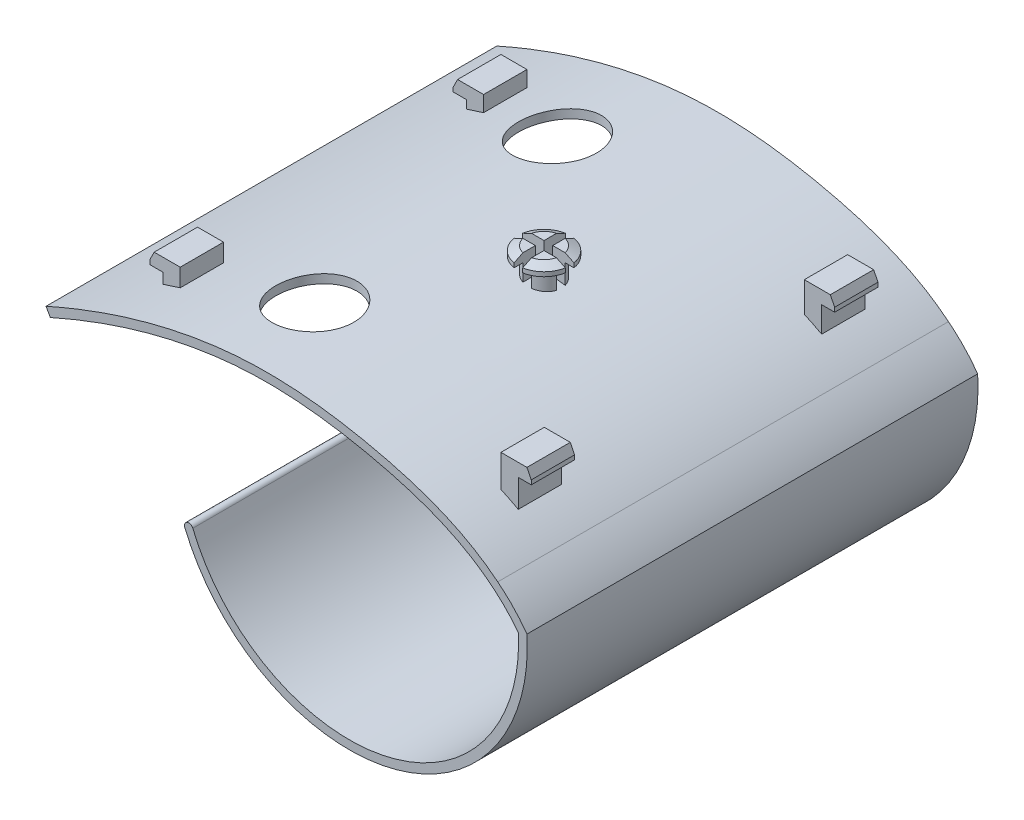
ISO-10303-21;
HEADER;
FILE_DESCRIPTION(('STEP AP214'),'2;1');
FILE_NAME('part.step','',(''),(''),'','','');
FILE_SCHEMA(('AUTOMOTIVE_DESIGN { 1 0 10303 214 1 1 1 1 }'));
ENDSEC;
DATA;
#1=APPLICATION_CONTEXT('core data for automotive mechanical design processes');
#2=APPLICATION_PROTOCOL_DEFINITION('international standard','automotive_design',2000,#1);
#3=PRODUCT_CONTEXT('',#1,'mechanical');
#4=PRODUCT('Part','Part','',(#3));
#5=PRODUCT_RELATED_PRODUCT_CATEGORY('part','',(#4));
#6=PRODUCT_DEFINITION_FORMATION('','',#4);
#7=PRODUCT_DEFINITION_CONTEXT('part definition',#1,'design');
#8=PRODUCT_DEFINITION('design','',#6,#7);
#9=PRODUCT_DEFINITION_SHAPE('','',#8);
#10=(LENGTH_UNIT() NAMED_UNIT(*) SI_UNIT(.MILLI.,.METRE.));
#11=(NAMED_UNIT(*) PLANE_ANGLE_UNIT() SI_UNIT($,.RADIAN.));
#12=(NAMED_UNIT(*) SI_UNIT($,.STERADIAN.) SOLID_ANGLE_UNIT());
#13=UNCERTAINTY_MEASURE_WITH_UNIT(LENGTH_MEASURE(1.E-05),#10,'distance_accuracy_value','');
#14=(GEOMETRIC_REPRESENTATION_CONTEXT(3) GLOBAL_UNCERTAINTY_ASSIGNED_CONTEXT((#13)) GLOBAL_UNIT_ASSIGNED_CONTEXT((#10,
#11,#12)) REPRESENTATION_CONTEXT('',''));
#15=CARTESIAN_POINT('',(0.,0.,0.));
#16=DIRECTION('',(0.,0.,1.));
#17=DIRECTION('',(1.,0.,0.));
#18=AXIS2_PLACEMENT_3D('',#15,#16,#17);
#19=CARTESIAN_POINT('',(38.954292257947,41.2476257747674,26.));
#20=DIRECTION('',(0.,1.,0.));
#21=DIRECTION('',(-1.,0.,0.));
#22=AXIS2_PLACEMENT_3D('',#19,#20,#21);
#23=CYLINDRICAL_SURFACE('',#22,2.00000000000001);
#24=DIRECTION('',(0.,1.,0.));
#25=VECTOR('',#24,1.);
#26=CARTESIAN_POINT('',(37.0178005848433,41.2476257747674,25.5));
#27=LINE('',#26,#25);
#28=CARTESIAN_POINT('',(37.0178005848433,39.6667405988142,25.5));
#29=VERTEX_POINT('',#28);
#30=CARTESIAN_POINT('',(37.0178005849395,37.8594404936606,25.5));
#31=VERTEX_POINT('',#30);
#32=EDGE_CURVE('E605',#29,#31,#27,.F.);
#33=ORIENTED_EDGE('',*,*,#32,.F.);
#34=CARTESIAN_POINT('',(38.954292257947,39.6667405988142,26.));
#35=DIRECTION('',(0.,1.,0.));
#36=DIRECTION('',(-1.,0.,0.));
#37=AXIS2_PLACEMENT_3D('',#34,#35,#36);
#38=CIRCLE('',#37,2.00000000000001);
#39=CARTESIAN_POINT('',(38.454292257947,39.6667405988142,24.0635083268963));
#40=VERTEX_POINT('',#39);
#41=EDGE_CURVE('E608',#40,#29,#38,.T.);
#42=ORIENTED_EDGE('',*,*,#41,.F.);
#43=DIRECTION('',(0.,1.,0.));
#44=VECTOR('',#43,1.);
#45=CARTESIAN_POINT('',(38.454292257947,41.2476257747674,24.0635083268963));
#46=LINE('',#45,#44);
#47=CARTESIAN_POINT('',(38.454292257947,37.7233271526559,24.0635083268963));
#48=VERTEX_POINT('',#47);
#49=EDGE_CURVE('E53',#48,#40,#46,.T.);
#50=ORIENTED_EDGE('',*,*,#49,.F.);
#51=CARTESIAN_POINT('',(36.954292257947,37.8645321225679,26.));
#52=CARTESIAN_POINT('',(36.9542972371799,37.864532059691,25.887957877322));
#53=CARTESIAN_POINT('',(36.9637393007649,37.8637833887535,25.7758353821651));
#54=CARTESIAN_POINT('',(37.0012689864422,37.8607768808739,25.5546822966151));
#55=CARTESIAN_POINT('',(37.0293787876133,37.8585172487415,25.4456555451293));
#56=CARTESIAN_POINT('',(37.1034263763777,37.8524631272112,25.2339315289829));
#57=CARTESIAN_POINT('',(37.1493550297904,37.8486694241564,25.1312310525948));
#58=CARTESIAN_POINT('',(37.2576999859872,37.8395190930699,24.9350442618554));
#59=CARTESIAN_POINT('',(37.3201122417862,37.8341628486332,24.8415556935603));
#60=CARTESIAN_POINT('',(37.459699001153,37.821865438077,24.666301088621));
#61=CARTESIAN_POINT('',(37.5368885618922,37.8149226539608,24.5845471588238));
#62=CARTESIAN_POINT('',(37.7037663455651,37.7994740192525,24.4351589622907));
#63=CARTESIAN_POINT('',(37.7934551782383,37.7909680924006,24.3675253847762));
#64=CARTESIAN_POINT('',(37.9830427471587,37.772439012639,24.2480681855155));
#65=CARTESIAN_POINT('',(38.0829712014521,37.7624114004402,24.1962924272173));
#66=CARTESIAN_POINT('',(38.2899587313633,37.741002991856,24.1102315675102));
#67=CARTESIAN_POINT('',(38.3970179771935,37.7296221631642,24.0759468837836));
#68=CARTESIAN_POINT('',(38.6157963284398,37.7056728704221,24.0256436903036));
#69=CARTESIAN_POINT('',(38.7275363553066,37.6930986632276,24.0097189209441));
#70=CARTESIAN_POINT('',(38.952009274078,37.6671264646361,23.9968438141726));
#71=CARTESIAN_POINT('',(39.0647421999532,37.653728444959,23.9998941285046));
#72=CARTESIAN_POINT('',(39.2886886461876,37.6264242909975,24.0249188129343));
#73=CARTESIAN_POINT('',(39.3998897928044,37.6125156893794,24.0470012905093));
#74=CARTESIAN_POINT('',(39.6169824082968,37.5847306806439,24.1096019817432));
#75=CARTESIAN_POINT('',(39.7228737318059,37.570854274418,24.1501206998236));
#76=CARTESIAN_POINT('',(39.9266457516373,37.5436106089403,24.2486093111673));
#77=CARTESIAN_POINT('',(40.0245034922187,37.5302448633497,24.3066271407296));
#78=CARTESIAN_POINT('',(40.2090810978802,37.5046040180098,24.438472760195));
#79=CARTESIAN_POINT('',(40.2958010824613,37.4923289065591,24.5123003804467));
#80=CARTESIAN_POINT('',(40.4552896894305,37.4694429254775,24.6734220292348));
#81=CARTESIAN_POINT('',(40.5281077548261,37.4588261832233,24.7606662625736));
#82=CARTESIAN_POINT('',(40.6580243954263,37.439688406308,24.9463702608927));
#83=CARTESIAN_POINT('',(40.7151238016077,37.4311672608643,25.0448294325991));
#84=CARTESIAN_POINT('',(40.8114139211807,37.41669716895,25.2491765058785));
#85=CARTESIAN_POINT('',(40.8507691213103,37.4107246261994,25.3549852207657));
#86=CARTESIAN_POINT('',(40.9111587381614,37.4015266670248,25.571820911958));
#87=CARTESIAN_POINT('',(40.9321943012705,37.3983010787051,25.6828475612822));
#88=CARTESIAN_POINT('',(40.9551845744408,37.394774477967,25.905817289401));
#89=CARTESIAN_POINT('',(40.957321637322,37.3944455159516,26.0177411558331));
#90=CARTESIAN_POINT('',(40.9429277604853,37.3966550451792,26.24035082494));
#91=CARTESIAN_POINT('',(40.9263973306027,37.3991934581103,26.3510366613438));
#92=CARTESIAN_POINT('',(40.8752527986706,37.4070008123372,26.5676799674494));
#93=CARTESIAN_POINT('',(40.8406949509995,37.4122612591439,26.6736510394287));
#94=CARTESIAN_POINT('',(40.7545606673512,37.4252561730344,26.8782691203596));
#95=CARTESIAN_POINT('',(40.7029838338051,37.4329906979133,26.9769159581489));
#96=CARTESIAN_POINT('',(40.5839824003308,37.4506256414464,27.1647043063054));
#97=CARTESIAN_POINT('',(40.5164701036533,37.4605380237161,27.2537890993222));
#98=CARTESIAN_POINT('',(40.3677012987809,37.4820594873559,27.4193892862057));
#99=CARTESIAN_POINT('',(40.2864440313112,37.4936686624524,27.4959039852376));
#100=CARTESIAN_POINT('',(40.111570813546,37.5182179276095,27.6350284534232));
#101=CARTESIAN_POINT('',(40.0178360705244,37.5311705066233,27.6974867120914));
#102=CARTESIAN_POINT('',(39.8213061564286,37.5577804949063,27.8057898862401));
#103=CARTESIAN_POINT('',(39.7185105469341,37.5714379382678,27.8516339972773));
#104=CARTESIAN_POINT('',(39.5058497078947,37.5990572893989,27.9257639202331));
#105=CARTESIAN_POINT('',(39.3959335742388,37.6130207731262,27.9539031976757));
#106=CARTESIAN_POINT('',(39.1728917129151,37.6406563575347,27.9912307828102));
#107=CARTESIAN_POINT('',(39.0597659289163,37.6543284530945,28.000418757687));
#108=CARTESIAN_POINT('',(38.8333055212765,37.6809794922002,27.9995511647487));
#109=CARTESIAN_POINT('',(38.7199708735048,37.6939572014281,27.989462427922));
#110=CARTESIAN_POINT('',(38.4965317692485,37.7188447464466,27.9502104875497));
#111=CARTESIAN_POINT('',(38.3864272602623,37.7307545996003,27.9210475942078));
#112=CARTESIAN_POINT('',(38.1730571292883,37.753199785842,27.8445770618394));
#113=CARTESIAN_POINT('',(38.0697661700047,37.7637403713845,27.7973416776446));
#114=CARTESIAN_POINT('',(37.8725526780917,37.7833284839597,27.6860186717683));
#115=CARTESIAN_POINT('',(37.7786294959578,37.7923761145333,27.6219322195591));
#116=CARTESIAN_POINT('',(37.6034215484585,37.808834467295,27.479136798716));
#117=CARTESIAN_POINT('',(37.5220650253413,37.8162545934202,27.4005169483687));
#118=CARTESIAN_POINT('',(37.373677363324,37.8294950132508,27.2306011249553));
#119=CARTESIAN_POINT('',(37.3066494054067,37.8353149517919,27.1393023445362));
#120=CARTESIAN_POINT('',(37.1891488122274,37.8453403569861,26.9470556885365));
#121=CARTESIAN_POINT('',(37.1386098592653,37.8495523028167,26.8461486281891));
#122=CARTESIAN_POINT('',(37.0552296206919,37.8564197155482,26.637316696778));
#123=CARTESIAN_POINT('',(37.0223670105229,37.8590770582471,26.529400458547));
#124=CARTESIAN_POINT('',(36.9840100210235,37.8621614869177,26.3506649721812));
#125=CARTESIAN_POINT('',(36.9728801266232,37.8630506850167,26.2810123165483));
#126=CARTESIAN_POINT('',(36.9580196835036,37.864236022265,26.1409170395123));
#127=CARTESIAN_POINT('',(36.9542891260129,37.8645321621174,26.0704744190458));
#128=CARTESIAN_POINT('',(36.954292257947,37.8645321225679,26.));
#129=B_SPLINE_CURVE_WITH_KNOTS('',3,(#51,#52,#53,#54,#55,#56,#57,#58,#59,#60,#61,#62,#63,#64,
#65,#66,#67,#68,#69,#70,#71,#72,#73,#74,#75,#76,#77,#78,#79,#80,#81,#82,#83,#84,#85,#86,#87,#88,
#89,#90,#91,#92,#93,#94,#95,#96,#97,#98,#99,#100,#101,#102,#103,#104,#105,#106,#107,#108,#109,
#110,#111,#112,#113,#114,#115,#116,#117,#118,#119,#120,#121,#122,#123,#124,#125,#126,#127,#128),
.UNSPECIFIED.,.T.,.F.,(4,2,2,2,2,2,2,2,2,2,2,2,2,2,2,2,2,2,2,2,2,2,2,2,2,2,2,2,2,2,2,2,2,2,2,2,
2,2,4),(0.,0.335868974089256,0.672137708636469,1.00823429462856,1.34424844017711,
1.68060680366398,2.01698158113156,2.35436185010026,2.69175017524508,3.03085358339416,
3.36996863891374,3.71102274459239,4.05208618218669,4.39409253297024,4.73609521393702,
5.07685790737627,5.41760258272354,5.75512016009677,6.09261661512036,6.42685294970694,
6.76108015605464,7.09427059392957,7.4274688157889,7.76254531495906,8.09764032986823,
8.43619055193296,8.7747571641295,9.11609029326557,9.45742941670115,9.79935640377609,
10.1412778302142,10.4818462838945,10.8223911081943,11.160913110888,11.4995101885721,
11.8367281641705,12.1735384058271,12.3848000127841,12.5960613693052),.UNSPECIFIED.);
#130=EDGE_CURVE('E647',#31,#48,#129,.T.);
#131=ORIENTED_EDGE('',*,*,#130,.F.);
#132=EDGE_LOOP('',(#33,#42,#50,#131));
#133=FACE_BOUND('',#132,.T.);
#134=ADVANCED_FACE('F38',(#133),#23,.T.);
#135=DIRECTION('',(0.,1.,0.));
#136=VECTOR('',#135,1.);
#137=CARTESIAN_POINT('',(37.0178005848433,41.2476257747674,26.5));
#138=LINE('',#137,#136);
#139=CARTESIAN_POINT('',(37.0178005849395,37.8594404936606,26.5));
#140=VERTEX_POINT('',#139);
#141=CARTESIAN_POINT('',(37.0178005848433,39.6667405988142,26.5));
#142=VERTEX_POINT('',#141);
#143=EDGE_CURVE('E583',#140,#142,#138,.T.);
#144=ORIENTED_EDGE('',*,*,#143,.F.);
#145=CARTESIAN_POINT('',(38.454292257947,37.7233271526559,27.9364916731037));
#146=VERTEX_POINT('',#145);
#147=EDGE_CURVE('E627',#146,#140,#129,.T.);
#148=ORIENTED_EDGE('',*,*,#147,.F.);
#149=DIRECTION('',(0.,1.,0.));
#150=VECTOR('',#149,1.);
#151=CARTESIAN_POINT('',(38.454292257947,41.2476257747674,27.9364916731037));
#152=LINE('',#151,#150);
#153=CARTESIAN_POINT('',(38.454292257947,39.6667405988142,27.9364916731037));
#154=VERTEX_POINT('',#153);
#155=EDGE_CURVE('E574',#154,#146,#152,.F.);
#156=ORIENTED_EDGE('',*,*,#155,.F.);
#157=EDGE_CURVE('E609',#142,#154,#38,.T.);
#158=ORIENTED_EDGE('',*,*,#157,.F.);
#159=EDGE_LOOP('',(#144,#148,#156,#158));
#160=FACE_BOUND('',#159,.T.);
#161=ADVANCED_FACE('F1030',(#160),#23,.T.);
#162=DIRECTION('',(0.,1.,0.));
#163=VECTOR('',#162,1.);
#164=CARTESIAN_POINT('',(39.454292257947,41.2476257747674,27.9364916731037));
#165=LINE('',#164,#163);
#166=CARTESIAN_POINT('',(39.454292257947,37.6055262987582,27.9364916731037));
#167=VERTEX_POINT('',#166);
#168=CARTESIAN_POINT('',(39.454292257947,39.6667405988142,27.9364916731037));
#169=VERTEX_POINT('',#168);
#170=EDGE_CURVE('E564',#167,#169,#165,.T.);
#171=ORIENTED_EDGE('',*,*,#170,.F.);
#172=CARTESIAN_POINT('',(40.8907839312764,37.4046291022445,26.5));
#173=VERTEX_POINT('',#172);
#174=EDGE_CURVE('E1033',#173,#167,#129,.T.);
#175=ORIENTED_EDGE('',*,*,#174,.F.);
#176=DIRECTION('',(0.,1.,0.));
#177=VECTOR('',#176,1.);
#178=CARTESIAN_POINT('',(40.8907839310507,41.2476257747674,26.5));
#179=LINE('',#178,#177);
#180=CARTESIAN_POINT('',(40.8907839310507,39.6667405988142,26.5));
#181=VERTEX_POINT('',#180);
#182=EDGE_CURVE('E543',#181,#173,#179,.F.);
#183=ORIENTED_EDGE('',*,*,#182,.F.);
#184=EDGE_CURVE('E613',#169,#181,#38,.T.);
#185=ORIENTED_EDGE('',*,*,#184,.F.);
#186=EDGE_LOOP('',(#171,#175,#183,#185));
#187=FACE_BOUND('',#186,.T.);
#188=ADVANCED_FACE('F1112',(#187),#23,.T.);
#189=CARTESIAN_POINT('',(36.954292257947,40.6667405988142,26.));
#190=DIRECTION('',(0.,1.,0.));
#191=DIRECTION('',(-1.,0.,0.));
#192=AXIS2_PLACEMENT_3D('',#189,#190,#191);
#193=PLANE('',#192);
#194=DIRECTION('',(1.,0.,0.));
#195=VECTOR('',#194,1.);
#196=CARTESIAN_POINT('',(38.454292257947,40.6667405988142,26.5));
#197=LINE('',#196,#195);
#198=CARTESIAN_POINT('',(37.0178005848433,40.6667405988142,26.5));
#199=VERTEX_POINT('',#198);
#200=CARTESIAN_POINT('',(38.454292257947,40.6667405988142,26.5));
#201=VERTEX_POINT('',#200);
#202=EDGE_CURVE('E448',#199,#201,#197,.T.);
#203=ORIENTED_EDGE('',*,*,#202,.F.);
#204=CARTESIAN_POINT('',(38.954292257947,40.6667405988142,26.));
#205=DIRECTION('',(0.,1.,0.));
#206=DIRECTION('',(-1.,0.,0.));
#207=AXIS2_PLACEMENT_3D('',#204,#205,#206);
#208=CIRCLE('',#207,2.);
#209=CARTESIAN_POINT('',(38.454292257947,40.6667405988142,27.9364916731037));
#210=VERTEX_POINT('',#209);
#211=EDGE_CURVE('E624',#199,#210,#208,.T.);
#212=ORIENTED_EDGE('',*,*,#211,.T.);
#213=DIRECTION('',(0.,0.,1.));
#214=VECTOR('',#213,1.);
#215=CARTESIAN_POINT('',(38.454292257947,40.6667405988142,29.5063725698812));
#216=LINE('',#215,#214);
#217=EDGE_CURVE('E446',#201,#210,#216,.T.);
#218=ORIENTED_EDGE('',*,*,#217,.F.);
#219=EDGE_LOOP('',(#203,#212,#218));
#220=FACE_BOUND('',#219,.T.);
#221=ADVANCED_FACE('F1131',(#220),#193,.T.);
#222=DIRECTION('',(0.,0.,-1.));
#223=VECTOR('',#222,1.);
#224=CARTESIAN_POINT('',(39.454292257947,40.6667405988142,26.5));
#225=LINE('',#224,#223);
#226=CARTESIAN_POINT('',(39.454292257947,40.6667405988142,27.9364916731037));
#227=VERTEX_POINT('',#226);
#228=CARTESIAN_POINT('',(39.454292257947,40.6667405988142,26.5));
#229=VERTEX_POINT('',#228);
#230=EDGE_CURVE('E444',#227,#229,#225,.T.);
#231=ORIENTED_EDGE('',*,*,#230,.F.);
#232=CARTESIAN_POINT('',(40.8907839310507,40.6667405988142,26.5));
#233=VERTEX_POINT('',#232);
#234=EDGE_CURVE('E628',#227,#233,#208,.T.);
#235=ORIENTED_EDGE('',*,*,#234,.T.);
#236=DIRECTION('',(1.,0.,0.));
#237=VECTOR('',#236,1.);
#238=CARTESIAN_POINT('',(43.2966175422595,40.6667405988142,26.5));
#239=LINE('',#238,#237);
#240=EDGE_CURVE('E425',#229,#233,#239,.T.);
#241=ORIENTED_EDGE('',*,*,#240,.F.);
#242=EDGE_LOOP('',(#231,#235,#241));
#243=FACE_BOUND('',#242,.T.);
#244=ADVANCED_FACE('F1090',(#243),#193,.T.);
#245=DIRECTION('',(-1.,0.,0.));
#246=VECTOR('',#245,1.);
#247=CARTESIAN_POINT('',(39.454292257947,40.6667405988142,25.5));
#248=LINE('',#247,#246);
#249=CARTESIAN_POINT('',(40.8907839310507,40.6667405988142,25.5));
#250=VERTEX_POINT('',#249);
#251=CARTESIAN_POINT('',(39.454292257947,40.6667405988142,25.5));
#252=VERTEX_POINT('',#251);
#253=EDGE_CURVE('E414',#250,#252,#248,.T.);
#254=ORIENTED_EDGE('',*,*,#253,.F.);
#255=CARTESIAN_POINT('',(39.454292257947,40.6667405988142,24.0635083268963));
#256=VERTEX_POINT('',#255);
#257=EDGE_CURVE('E436',#250,#256,#208,.T.);
#258=ORIENTED_EDGE('',*,*,#257,.T.);
#259=DIRECTION('',(0.,0.,-1.));
#260=VECTOR('',#259,1.);
#261=CARTESIAN_POINT('',(39.454292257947,40.6667405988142,20.9508681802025));
#262=LINE('',#261,#260);
#263=EDGE_CURVE('E424',#252,#256,#262,.T.);
#264=ORIENTED_EDGE('',*,*,#263,.F.);
#265=EDGE_LOOP('',(#254,#258,#264));
#266=FACE_BOUND('',#265,.T.);
#267=ADVANCED_FACE('F435',(#266),#193,.T.);
#268=CARTESIAN_POINT('',(38.954292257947,40.6667405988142,26.));
#269=DIRECTION('',(0.,-1.,0.));
#270=DIRECTION('',(1.,0.,0.));
#271=AXIS2_PLACEMENT_3D('',#268,#269,#270);
#272=CONICAL_SURFACE('',#271,2.,1.10714871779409);
#273=CARTESIAN_POINT('',(39.984198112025,41.0943102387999,25.5));
#274=CARTESIAN_POINT('',(39.9567082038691,41.1066733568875,25.5));
#275=CARTESIAN_POINT('',(39.9291841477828,41.1189609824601,25.5));
#276=CARTESIAN_POINT('',(39.8740494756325,41.1433415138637,25.5));
#277=CARTESIAN_POINT('',(39.84643885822,41.1554344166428,25.5));
#278=CARTESIAN_POINT('',(39.7633224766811,41.1914105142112,25.5));
#279=CARTESIAN_POINT('',(39.7076597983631,41.2149332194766,25.5));
#280=CARTESIAN_POINT('',(39.5929146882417,41.2615719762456,25.5));
#281=CARTESIAN_POINT('',(39.5337998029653,41.2846096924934,25.5));
#282=CARTESIAN_POINT('',(39.4443012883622,41.3168508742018,25.5));
#283=CARTESIAN_POINT('',(39.414342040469,41.3272086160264,25.5));
#284=CARTESIAN_POINT('',(39.3540767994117,41.3468571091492,25.5));
#285=CARTESIAN_POINT('',(39.3237706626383,41.3561473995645,25.5));
#286=CARTESIAN_POINT('',(39.2205638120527,41.3850987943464,25.5));
#287=CARTESIAN_POINT('',(39.1465303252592,41.4014042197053,25.5));
#288=CARTESIAN_POINT('',(39.0348046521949,41.414149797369,25.5));
#289=CARTESIAN_POINT('',(38.9978109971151,41.4164782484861,25.5));
#290=CARTESIAN_POINT('',(38.9237957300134,41.4169605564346,25.5));
#291=CARTESIAN_POINT('',(38.8867741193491,41.41511460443,25.5));
#292=CARTESIAN_POINT('',(38.8005074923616,41.4063070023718,25.5));
#293=CARTESIAN_POINT('',(38.7514265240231,41.3978075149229,25.5));
#294=CARTESIAN_POINT('',(38.654323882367,41.3760215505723,25.5));
#295=CARTESIAN_POINT('',(38.6063044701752,41.3627257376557,25.5));
#296=CARTESIAN_POINT('',(38.5102054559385,41.3329110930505,25.5));
#297=CARTESIAN_POINT('',(38.462145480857,41.3163308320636,25.5));
#298=CARTESIAN_POINT('',(38.3905992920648,41.290080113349,25.5));
#299=CARTESIAN_POINT('',(38.3668514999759,41.2811040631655,25.5));
#300=CARTESIAN_POINT('',(38.3194999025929,41.2627801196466,25.5));
#301=CARTESIAN_POINT('',(38.2958960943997,41.2534322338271,25.5));
#302=CARTESIAN_POINT('',(38.2175034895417,41.2218257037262,25.5));
#303=CARTESIAN_POINT('',(38.1629744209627,41.1989247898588,25.5));
#304=CARTESIAN_POINT('',(38.054330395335,41.1521579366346,25.5));
#305=CARTESIAN_POINT('',(38.0002154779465,41.1282919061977,25.5));
#306=CARTESIAN_POINT('',(37.8382579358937,41.0557611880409,25.5));
#307=CARTESIAN_POINT('',(37.730829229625,41.0061751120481,25.5));
#308=CARTESIAN_POINT('',(37.516424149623,40.9058030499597,25.5));
#309=CARTESIAN_POINT('',(37.409448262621,40.8550160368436,25.5));
#310=CARTESIAN_POINT('',(37.1958289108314,40.7527885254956,25.5));
#311=CARTESIAN_POINT('',(37.0891853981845,40.7013481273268,25.5));
#312=CARTESIAN_POINT('',(36.877251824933,40.5986308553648,25.5));
#313=CARTESIAN_POINT('',(36.7719596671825,40.5473582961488,25.5));
#314=CARTESIAN_POINT('',(36.5614971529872,40.4445532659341,25.5));
#315=CARTESIAN_POINT('',(36.4563268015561,40.3930207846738,25.5));
#316=CARTESIAN_POINT('',(36.1410260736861,40.2382036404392,25.5));
#317=CARTESIAN_POINT('',(35.9310234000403,40.134659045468,25.5));
#318=CARTESIAN_POINT('',(35.613333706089,39.9776765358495,25.5));
#319=CARTESIAN_POINT('',(35.5055805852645,39.9243721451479,25.5));
#320=CARTESIAN_POINT('',(35.2901015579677,39.8176824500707,25.5));
#321=CARTESIAN_POINT('',(35.1823756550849,39.7642971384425,25.5));
#322=CARTESIAN_POINT('',(34.9662540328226,39.6571226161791,25.5));
#323=CARTESIAN_POINT('',(34.8578584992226,39.6033330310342,25.5));
#324=CARTESIAN_POINT('',(34.6411011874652,39.4957122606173,25.5));
#325=CARTESIAN_POINT('',(34.5327394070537,39.4418810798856,25.5));
#326=CARTESIAN_POINT('',(34.4243864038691,39.3880322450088,25.5));
#327=B_SPLINE_CURVE_WITH_KNOTS('',3,(#273,#274,#275,#276,#277,#278,#279,#280,#281,#282,#283,
#284,#285,#286,#287,#288,#289,#290,#291,#292,#293,#294,#295,#296,#297,#298,#299,#300,#301,#302,
#303,#304,#305,#306,#307,#308,#309,#310,#311,#312,#313,#314,#315,#316,#317,#318,#319,#320,#321,
#322,#323,#324,#325,#326),.UNSPECIFIED.,.F.,.F.,(4,2,2,2,2,2,2,2,2,2,2,2,2,2,2,2,2,2,2,2,2,2,2,
2,2,2,4),(0.,0.0904261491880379,0.180853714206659,0.362129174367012,0.552415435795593,
0.64748792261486,0.742601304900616,0.968815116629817,1.07979583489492,1.19077147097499,
1.33982118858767,1.4891626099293,1.64161832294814,1.71777932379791,1.79393878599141,
1.97134931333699,2.14877662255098,2.50371814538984,2.85897504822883,3.21417818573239,
3.56551504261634,3.91686588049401,4.61929186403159,4.97994244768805,5.34062753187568,
5.70365121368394,6.06663969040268),.UNSPECIFIED.);
#328=CARTESIAN_POINT('',(37.0178005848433,40.6667405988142,25.5));
#329=VERTEX_POINT('',#328);
#330=CARTESIAN_POINT('',(35.9962523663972,40.1667405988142,25.5));
#331=VERTEX_POINT('',#330);
#332=EDGE_CURVE('E600',#329,#331,#327,.T.);
#333=ORIENTED_EDGE('',*,*,#332,.F.);
#334=CARTESIAN_POINT('',(38.454292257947,40.6667405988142,24.0635083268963));
#335=VERTEX_POINT('',#334);
#336=EDGE_CURVE('E622',#335,#329,#208,.T.);
#337=ORIENTED_EDGE('',*,*,#336,.F.);
#338=CARTESIAN_POINT('',(38.454292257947,39.3880322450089,21.4700941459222));
#339=CARTESIAN_POINT('',(38.454292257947,39.502054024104,21.6995633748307));
#340=CARTESIAN_POINT('',(38.454292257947,39.6160229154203,21.9290590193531));
#341=CARTESIAN_POINT('',(38.454292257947,39.8436915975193,22.3882153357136));
#342=CARTESIAN_POINT('',(38.454292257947,39.9573913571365,22.6178760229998));
#343=CARTESIAN_POINT('',(38.454292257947,40.181770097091,23.0722338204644));
#344=CARTESIAN_POINT('',(38.454292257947,40.2924592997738,23.2969258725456));
#345=CARTESIAN_POINT('',(38.454292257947,40.4578042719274,23.6342892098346));
#346=CARTESIAN_POINT('',(38.454292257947,40.5128019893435,23.746792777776));
#347=CARTESIAN_POINT('',(38.454292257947,40.6224428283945,23.9719722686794));
#348=CARTESIAN_POINT('',(38.454292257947,40.6770859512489,24.0846481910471));
#349=CARTESIAN_POINT('',(38.454292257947,40.7762706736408,24.2905068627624));
#350=CARTESIAN_POINT('',(38.454292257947,40.8209043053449,24.3836451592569));
#351=CARTESIAN_POINT('',(38.454292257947,40.9095474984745,24.5702404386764));
#352=CARTESIAN_POINT('',(38.454292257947,40.9535569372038,24.6636974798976));
#353=CARTESIAN_POINT('',(38.454292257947,41.0410923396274,24.8523772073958));
#354=CARTESIAN_POINT('',(38.454292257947,41.0846037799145,24.9476067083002));
#355=CARTESIAN_POINT('',(38.454292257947,41.1482093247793,25.0911682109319));
#356=CARTESIAN_POINT('',(38.454292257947,41.1691304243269,25.1391324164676));
#357=CARTESIAN_POINT('',(38.454292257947,41.2101370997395,25.2354153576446));
#358=CARTESIAN_POINT('',(38.454292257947,41.2302227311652,25.2837340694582));
#359=CARTESIAN_POINT('',(38.454292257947,41.2685116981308,25.3794004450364));
#360=CARTESIAN_POINT('',(38.454292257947,41.2867538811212,25.4267324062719));
#361=CARTESIAN_POINT('',(38.454292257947,41.3213249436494,25.5221565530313));
#362=CARTESIAN_POINT('',(38.454292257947,41.3376519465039,25.570249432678));
#363=CARTESIAN_POINT('',(38.454292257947,41.3668196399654,25.6664598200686));
#364=CARTESIAN_POINT('',(38.454292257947,41.3797237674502,25.7145574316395));
#365=CARTESIAN_POINT('',(38.454292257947,41.4005083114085,25.8117987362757));
#366=CARTESIAN_POINT('',(38.454292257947,41.4083999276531,25.8609398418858));
#367=CARTESIAN_POINT('',(38.454292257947,41.4162691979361,25.950244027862));
#368=CARTESIAN_POINT('',(38.454292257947,41.4174889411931,25.9902914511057));
#369=CARTESIAN_POINT('',(38.454292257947,41.4150767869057,26.070249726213));
#370=CARTESIAN_POINT('',(38.454292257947,41.4114424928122,26.1101605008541));
#371=CARTESIAN_POINT('',(38.454292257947,41.3999733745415,26.1901892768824));
#372=CARTESIAN_POINT('',(38.454292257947,41.3920522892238,26.2302941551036));
#373=CARTESIAN_POINT('',(38.454292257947,41.3731686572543,26.3097788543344));
#374=CARTESIAN_POINT('',(38.454292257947,41.362204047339,26.3491581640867));
#375=CARTESIAN_POINT('',(38.454292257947,41.3329343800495,26.4446452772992));
#376=CARTESIAN_POINT('',(38.454292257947,41.3135327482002,26.5004093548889));
#377=CARTESIAN_POINT('',(38.454292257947,41.2723959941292,26.6110485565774));
#378=CARTESIAN_POINT('',(38.454292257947,41.2506605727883,26.6659235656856));
#379=CARTESIAN_POINT('',(38.454292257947,41.2068745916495,26.7725226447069));
#380=CARTESIAN_POINT('',(38.454292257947,41.1848875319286,26.8242730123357));
#381=CARTESIAN_POINT('',(38.454292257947,41.1401062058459,26.9273513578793));
#382=CARTESIAN_POINT('',(38.454292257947,41.1173129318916,26.9786797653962));
#383=CARTESIAN_POINT('',(38.454292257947,41.0943102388,27.0299058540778));
#384=B_SPLINE_CURVE_WITH_KNOTS('',3,(#338,#339,#340,#341,#342,#343,#344,#345,#346,#347,#348,
#349,#350,#351,#352,#353,#354,#355,#356,#357,#358,#359,#360,#361,#362,#363,#364,#365,#366,#367,
#368,#369,#370,#371,#372,#373,#374,#375,#376,#377,#378,#379,#380,#381,#382,#383),.UNSPECIFIED.,
.F.,.F.,(4,2,2,2,2,2,2,2,2,2,2,2,2,2,2,2,2,2,2,2,2,2,4),(0.,0.768709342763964,1.53750372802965,
2.2889328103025,2.66461342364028,3.0402927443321,3.35013304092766,3.66003342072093,
3.97411296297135,4.13109316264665,4.28806290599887,4.44021573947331,4.5925164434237,
4.74175814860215,4.89066520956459,5.01056785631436,5.130529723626,5.25300049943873,
5.37555450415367,5.55257684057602,5.72962189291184,5.8982952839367,6.06676781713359),.UNSPECIFIED.);
#385=CARTESIAN_POINT('',(38.454292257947,40.1667405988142,23.0419601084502));
#386=VERTEX_POINT('',#385);
#387=EDGE_CURVE('E498',#386,#335,#384,.T.);
#388=ORIENTED_EDGE('',*,*,#387,.F.);
#389=CARTESIAN_POINT('',(38.954292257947,40.1667405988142,26.));
#390=DIRECTION('',(0.,1.,0.));
#391=DIRECTION('',(-1.,0.,0.));
#392=AXIS2_PLACEMENT_3D('',#389,#390,#391);
#393=CIRCLE('',#392,3.00000000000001);
#394=EDGE_CURVE('E617',#386,#331,#393,.T.);
#395=ORIENTED_EDGE('',*,*,#394,.T.);
#396=EDGE_LOOP('',(#333,#337,#388,#395));
#397=FACE_BOUND('',#396,.T.);
#398=ADVANCED_FACE('F1084',(#397),#272,.T.);
#399=CARTESIAN_POINT('',(34.4243864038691,39.3880322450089,26.5));
#400=CARTESIAN_POINT('',(34.6538556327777,39.502054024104,26.5));
#401=CARTESIAN_POINT('',(34.8833512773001,39.6160229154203,26.5));
#402=CARTESIAN_POINT('',(35.3425075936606,39.8436915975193,26.5));
#403=CARTESIAN_POINT('',(35.5721682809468,39.9573913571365,26.5));
#404=CARTESIAN_POINT('',(36.0265260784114,40.181770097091,26.5));
#405=CARTESIAN_POINT('',(36.2512181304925,40.2924592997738,26.5));
#406=CARTESIAN_POINT('',(36.5885814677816,40.4578042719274,26.5));
#407=CARTESIAN_POINT('',(36.701085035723,40.5128019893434,26.5));
#408=CARTESIAN_POINT('',(36.9262645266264,40.6224428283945,26.5));
#409=CARTESIAN_POINT('',(37.0389404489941,40.6770859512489,26.5));
#410=CARTESIAN_POINT('',(37.2447991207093,40.7762706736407,26.5));
#411=CARTESIAN_POINT('',(37.3379374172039,40.8209043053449,26.5));
#412=CARTESIAN_POINT('',(37.5245326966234,40.9095474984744,26.5));
#413=CARTESIAN_POINT('',(37.6179897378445,40.9535569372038,26.5));
#414=CARTESIAN_POINT('',(37.8066694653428,41.0410923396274,26.5));
#415=CARTESIAN_POINT('',(37.9018989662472,41.0846037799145,26.5));
#416=CARTESIAN_POINT('',(38.0454604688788,41.1482093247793,26.5));
#417=CARTESIAN_POINT('',(38.0934246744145,41.1691304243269,26.5));
#418=CARTESIAN_POINT('',(38.1897076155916,41.2101370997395,26.5));
#419=CARTESIAN_POINT('',(38.2380263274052,41.2302227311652,26.5));
#420=CARTESIAN_POINT('',(38.3336927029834,41.2685116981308,26.5));
#421=CARTESIAN_POINT('',(38.3810246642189,41.2867538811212,26.5));
#422=CARTESIAN_POINT('',(38.4764488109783,41.3213249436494,26.5));
#423=CARTESIAN_POINT('',(38.5245416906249,41.3376519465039,26.5));
#424=CARTESIAN_POINT('',(38.6207520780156,41.3668196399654,26.5));
#425=CARTESIAN_POINT('',(38.6688496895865,41.3797237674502,26.5));
#426=CARTESIAN_POINT('',(38.7660909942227,41.4005083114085,26.5));
#427=CARTESIAN_POINT('',(38.8152320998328,41.4083999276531,26.5));
#428=CARTESIAN_POINT('',(38.904536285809,41.4162691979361,26.5));
#429=CARTESIAN_POINT('',(38.9445837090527,41.4174889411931,26.5));
#430=CARTESIAN_POINT('',(39.02454198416,41.4150767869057,26.5));
#431=CARTESIAN_POINT('',(39.0644527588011,41.4114424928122,26.5));
#432=CARTESIAN_POINT('',(39.1444815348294,41.3999733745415,26.5));
#433=CARTESIAN_POINT('',(39.1845864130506,41.3920522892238,26.5));
#434=CARTESIAN_POINT('',(39.2640711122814,41.3731686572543,26.5));
#435=CARTESIAN_POINT('',(39.3034504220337,41.362204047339,26.5));
#436=CARTESIAN_POINT('',(39.3989375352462,41.3329343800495,26.5));
#437=CARTESIAN_POINT('',(39.4547016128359,41.3135327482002,26.5));
#438=CARTESIAN_POINT('',(39.5653408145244,41.2723959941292,26.5));
#439=CARTESIAN_POINT('',(39.6202158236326,41.2506605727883,26.5));
#440=CARTESIAN_POINT('',(39.7268149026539,41.2068745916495,26.5));
#441=CARTESIAN_POINT('',(39.7785652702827,41.1848875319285,26.5));
#442=CARTESIAN_POINT('',(39.8816436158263,41.1401062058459,26.5));
#443=CARTESIAN_POINT('',(39.9329720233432,41.1173129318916,26.5));
#444=CARTESIAN_POINT('',(39.9841981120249,41.0943102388,26.5));
#445=B_SPLINE_CURVE_WITH_KNOTS('',3,(#399,#400,#401,#402,#403,#404,#405,#406,#407,#408,#409,
#410,#411,#412,#413,#414,#415,#416,#417,#418,#419,#420,#421,#422,#423,#424,#425,#426,#427,#428,
#429,#430,#431,#432,#433,#434,#435,#436,#437,#438,#439,#440,#441,#442,#443,#444),.UNSPECIFIED.,
.F.,.F.,(4,2,2,2,2,2,2,2,2,2,2,2,2,2,2,2,2,2,2,2,2,2,4),(0.,0.768709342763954,1.53750372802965,
2.28893281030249,2.66461342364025,3.04029274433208,3.35013304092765,3.66003342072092,
3.97411296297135,4.13109316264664,4.28806290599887,4.44021573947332,4.59251644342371,
4.74175814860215,4.8906652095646,5.01056785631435,5.13052972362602,5.25300049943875,
5.37555450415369,5.55257684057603,5.72962189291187,5.89829528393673,6.06676781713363),.UNSPECIFIED.);
#446=CARTESIAN_POINT('',(35.9962523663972,40.1667405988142,26.5));
#447=VERTEX_POINT('',#446);
#448=EDGE_CURVE('E578',#447,#199,#445,.T.);
#449=ORIENTED_EDGE('',*,*,#448,.F.);
#450=CARTESIAN_POINT('',(38.454292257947,40.1667405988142,28.9580398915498));
#451=VERTEX_POINT('',#450);
#452=EDGE_CURVE('E619',#447,#451,#393,.T.);
#453=ORIENTED_EDGE('',*,*,#452,.T.);
#454=CARTESIAN_POINT('',(38.454292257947,41.0943102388,24.9700941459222));
#455=CARTESIAN_POINT('',(38.454292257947,41.1066733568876,24.9975840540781));
#456=CARTESIAN_POINT('',(38.454292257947,41.1189609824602,25.0251081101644));
#457=CARTESIAN_POINT('',(38.454292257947,41.1433415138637,25.0802427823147));
#458=CARTESIAN_POINT('',(38.454292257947,41.1554344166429,25.1078533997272));
#459=CARTESIAN_POINT('',(38.454292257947,41.1914105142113,25.1909697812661));
#460=CARTESIAN_POINT('',(38.454292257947,41.2149332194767,25.2466324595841));
#461=CARTESIAN_POINT('',(38.454292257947,41.2615719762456,25.3613775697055));
#462=CARTESIAN_POINT('',(38.454292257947,41.2846096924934,25.4204924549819));
#463=CARTESIAN_POINT('',(38.454292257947,41.3168508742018,25.5099909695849));
#464=CARTESIAN_POINT('',(38.454292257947,41.3272086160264,25.5399502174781));
#465=CARTESIAN_POINT('',(38.454292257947,41.3468571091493,25.6002154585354));
#466=CARTESIAN_POINT('',(38.454292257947,41.3561473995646,25.6305215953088));
#467=CARTESIAN_POINT('',(38.454292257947,41.3850987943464,25.7337284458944));
#468=CARTESIAN_POINT('',(38.454292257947,41.4014042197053,25.8077619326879));
#469=CARTESIAN_POINT('',(38.454292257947,41.414149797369,25.9194876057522));
#470=CARTESIAN_POINT('',(38.454292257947,41.4164782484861,25.9564812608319));
#471=CARTESIAN_POINT('',(38.454292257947,41.4169605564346,26.0304965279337));
#472=CARTESIAN_POINT('',(38.454292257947,41.41511460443,26.067518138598));
#473=CARTESIAN_POINT('',(38.454292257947,41.4063070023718,26.1537847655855));
#474=CARTESIAN_POINT('',(38.454292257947,41.3978075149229,26.2028657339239));
#475=CARTESIAN_POINT('',(38.454292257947,41.3760215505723,26.2999683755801));
#476=CARTESIAN_POINT('',(38.454292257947,41.3627257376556,26.3479877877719));
#477=CARTESIAN_POINT('',(38.454292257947,41.3329110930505,26.4440868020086));
#478=CARTESIAN_POINT('',(38.454292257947,41.3163308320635,26.4921467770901));
#479=CARTESIAN_POINT('',(38.454292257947,41.290080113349,26.5636929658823));
#480=CARTESIAN_POINT('',(38.454292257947,41.2811040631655,26.5874407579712));
#481=CARTESIAN_POINT('',(38.454292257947,41.2627801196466,26.6347923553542));
#482=CARTESIAN_POINT('',(38.454292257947,41.2534322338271,26.6583961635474));
#483=CARTESIAN_POINT('',(38.454292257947,41.2218257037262,26.7367887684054));
#484=CARTESIAN_POINT('',(38.454292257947,41.1989247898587,26.7913178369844));
#485=CARTESIAN_POINT('',(38.454292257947,41.1521579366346,26.8999618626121));
#486=CARTESIAN_POINT('',(38.454292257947,41.1282919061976,26.9540767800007));
#487=CARTESIAN_POINT('',(38.454292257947,41.0557611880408,27.1160343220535));
#488=CARTESIAN_POINT('',(38.454292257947,41.006175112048,27.2234630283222));
#489=CARTESIAN_POINT('',(38.454292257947,40.9058030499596,27.4378681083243));
#490=CARTESIAN_POINT('',(38.454292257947,40.8550160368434,27.5448439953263));
#491=CARTESIAN_POINT('',(38.454292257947,40.7527885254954,27.758463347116));
#492=CARTESIAN_POINT('',(38.454292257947,40.7013481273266,27.8651068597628));
#493=CARTESIAN_POINT('',(38.454292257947,40.5986308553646,28.0770404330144));
#494=CARTESIAN_POINT('',(38.454292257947,40.5473582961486,28.182332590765));
#495=CARTESIAN_POINT('',(38.454292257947,40.4445532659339,28.3927951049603));
#496=CARTESIAN_POINT('',(38.454292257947,40.3930207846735,28.4979654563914));
#497=CARTESIAN_POINT('',(38.454292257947,40.238203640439,28.8132661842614));
#498=CARTESIAN_POINT('',(38.454292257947,40.1346590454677,29.0232688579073));
#499=CARTESIAN_POINT('',(38.454292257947,39.9776765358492,29.3409585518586));
#500=CARTESIAN_POINT('',(38.454292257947,39.9243721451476,29.448711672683));
#501=CARTESIAN_POINT('',(38.454292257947,39.8176824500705,29.6641906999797));
#502=CARTESIAN_POINT('',(38.454292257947,39.7642971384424,29.7719166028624));
#503=CARTESIAN_POINT('',(38.454292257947,39.657122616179,29.9880382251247));
#504=CARTESIAN_POINT('',(38.454292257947,39.6033330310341,30.0964337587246));
#505=CARTESIAN_POINT('',(38.454292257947,39.4957122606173,30.3131910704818));
#506=CARTESIAN_POINT('',(38.454292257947,39.4418810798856,30.4215528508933));
#507=CARTESIAN_POINT('',(38.454292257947,39.3880322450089,30.5299058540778));
#508=B_SPLINE_CURVE_WITH_KNOTS('',3,(#454,#455,#456,#457,#458,#459,#460,#461,#462,#463,#464,
#465,#466,#467,#468,#469,#470,#471,#472,#473,#474,#475,#476,#477,#478,#479,#480,#481,#482,#483,
#484,#485,#486,#487,#488,#489,#490,#491,#492,#493,#494,#495,#496,#497,#498,#499,#500,#501,#502,
#503,#504,#505,#506,#507),.UNSPECIFIED.,.F.,.F.,(4,2,2,2,2,2,2,2,2,2,2,2,2,2,2,2,2,2,2,2,2,2,2,
2,2,2,4),(0.,0.0904261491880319,0.180853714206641,0.362129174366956,0.552415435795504,
0.647487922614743,0.74260130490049,0.968815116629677,1.07979583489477,1.19077147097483,
1.33982118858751,1.48916260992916,1.64161832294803,1.7177793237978,1.79393878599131,
1.97134931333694,2.14877662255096,2.5037181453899,2.85897504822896,3.2141781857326,
3.56551504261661,3.91686588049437,4.61929186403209,4.97994244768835,5.34062753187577,
5.70365121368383,6.06663969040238),.UNSPECIFIED.);
#509=EDGE_CURVE('E569',#210,#451,#508,.T.);
#510=ORIENTED_EDGE('',*,*,#509,.F.);
#511=ORIENTED_EDGE('',*,*,#211,.F.);
#512=EDGE_LOOP('',(#449,#453,#510,#511));
#513=FACE_BOUND('',#512,.T.);
#514=ADVANCED_FACE('F1658',(#513),#272,.T.);
#515=CARTESIAN_POINT('',(39.454292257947,39.3880322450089,30.5299058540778));
#516=CARTESIAN_POINT('',(39.454292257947,39.502054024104,30.3004366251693));
#517=CARTESIAN_POINT('',(39.454292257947,39.6160229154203,30.0709409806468));
#518=CARTESIAN_POINT('',(39.454292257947,39.8436915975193,29.6117846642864));
#519=CARTESIAN_POINT('',(39.454292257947,39.9573913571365,29.3821239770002));
#520=CARTESIAN_POINT('',(39.454292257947,40.181770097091,28.9277661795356));
#521=CARTESIAN_POINT('',(39.454292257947,40.2924592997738,28.7030741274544));
#522=CARTESIAN_POINT('',(39.454292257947,40.4578042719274,28.3657107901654));
#523=CARTESIAN_POINT('',(39.454292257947,40.5128019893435,28.253207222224));
#524=CARTESIAN_POINT('',(39.454292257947,40.6224428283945,28.0280277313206));
#525=CARTESIAN_POINT('',(39.454292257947,40.6770859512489,27.9153518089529));
#526=CARTESIAN_POINT('',(39.454292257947,40.7762706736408,27.7094931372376));
#527=CARTESIAN_POINT('',(39.454292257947,40.8209043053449,27.6163548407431));
#528=CARTESIAN_POINT('',(39.454292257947,40.9095474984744,27.4297595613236));
#529=CARTESIAN_POINT('',(39.454292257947,40.9535569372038,27.3363025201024));
#530=CARTESIAN_POINT('',(39.454292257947,41.0410923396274,27.1476227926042));
#531=CARTESIAN_POINT('',(39.454292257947,41.0846037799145,27.0523932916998));
#532=CARTESIAN_POINT('',(39.454292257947,41.1482093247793,26.9088317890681));
#533=CARTESIAN_POINT('',(39.454292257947,41.1691304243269,26.8608675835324));
#534=CARTESIAN_POINT('',(39.454292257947,41.2101370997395,26.7645846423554));
#535=CARTESIAN_POINT('',(39.454292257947,41.2302227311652,26.7162659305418));
#536=CARTESIAN_POINT('',(39.454292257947,41.2685116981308,26.6205995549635));
#537=CARTESIAN_POINT('',(39.454292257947,41.2867538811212,26.5732675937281));
#538=CARTESIAN_POINT('',(39.454292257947,41.3213249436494,26.4778434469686));
#539=CARTESIAN_POINT('',(39.454292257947,41.3376519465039,26.429750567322));
#540=CARTESIAN_POINT('',(39.454292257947,41.3668196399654,26.3335401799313));
#541=CARTESIAN_POINT('',(39.454292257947,41.3797237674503,26.2854425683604));
#542=CARTESIAN_POINT('',(39.454292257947,41.4005083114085,26.1882012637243));
#543=CARTESIAN_POINT('',(39.454292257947,41.4083999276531,26.1390601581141));
#544=CARTESIAN_POINT('',(39.454292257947,41.4162691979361,26.0497559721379));
#545=CARTESIAN_POINT('',(39.454292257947,41.4174889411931,26.0097085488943));
#546=CARTESIAN_POINT('',(39.454292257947,41.4150767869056,25.929750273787));
#547=CARTESIAN_POINT('',(39.454292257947,41.4114424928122,25.8898394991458));
#548=CARTESIAN_POINT('',(39.454292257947,41.3999733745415,25.8098107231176));
#549=CARTESIAN_POINT('',(39.454292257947,41.3920522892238,25.7697058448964));
#550=CARTESIAN_POINT('',(39.454292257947,41.3731686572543,25.6902211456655));
#551=CARTESIAN_POINT('',(39.454292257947,41.362204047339,25.6508418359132));
#552=CARTESIAN_POINT('',(39.454292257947,41.3329343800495,25.5553547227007));
#553=CARTESIAN_POINT('',(39.454292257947,41.3135327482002,25.4995906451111));
#554=CARTESIAN_POINT('',(39.454292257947,41.2723959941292,25.3889514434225));
#555=CARTESIAN_POINT('',(39.454292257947,41.2506605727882,25.3340764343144));
#556=CARTESIAN_POINT('',(39.454292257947,41.2068745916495,25.2274773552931));
#557=CARTESIAN_POINT('',(39.454292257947,41.1848875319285,25.1757269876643));
#558=CARTESIAN_POINT('',(39.454292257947,41.1401062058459,25.0726486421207));
#559=CARTESIAN_POINT('',(39.454292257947,41.1173129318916,25.0213202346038));
#560=CARTESIAN_POINT('',(39.454292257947,41.0943102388,24.9700941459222));
#561=B_SPLINE_CURVE_WITH_KNOTS('',3,(#515,#516,#517,#518,#519,#520,#521,#522,#523,#524,#525,
#526,#527,#528,#529,#530,#531,#532,#533,#534,#535,#536,#537,#538,#539,#540,#541,#542,#543,#544,
#545,#546,#547,#548,#549,#550,#551,#552,#553,#554,#555,#556,#557,#558,#559,#560),.UNSPECIFIED.,
.F.,.F.,(4,2,2,2,2,2,2,2,2,2,2,2,2,2,2,2,2,2,2,2,2,2,4),(0.,0.76870934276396,1.53750372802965,
2.28893281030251,2.66461342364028,3.04029274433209,3.35013304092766,3.66003342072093,
3.97411296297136,4.13109316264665,4.28806290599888,4.44021573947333,4.59251644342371,
4.74175814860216,4.89066520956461,5.01056785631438,5.13052972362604,5.25300049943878,
5.37555450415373,5.55257684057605,5.72962189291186,5.8982952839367,6.06676781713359),.UNSPECIFIED.);
#562=CARTESIAN_POINT('',(39.454292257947,40.1667405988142,28.9580398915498));
#563=VERTEX_POINT('',#562);
#564=EDGE_CURVE('E559',#563,#227,#561,.T.);
#565=ORIENTED_EDGE('',*,*,#564,.F.);
#566=CARTESIAN_POINT('',(41.9123321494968,40.1667405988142,26.5));
#567=VERTEX_POINT('',#566);
#568=EDGE_CURVE('E623',#563,#567,#393,.T.);
#569=ORIENTED_EDGE('',*,*,#568,.T.);
#570=CARTESIAN_POINT('',(37.9243864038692,41.0943102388,26.5));
#571=CARTESIAN_POINT('',(37.9518763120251,41.1066733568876,26.5));
#572=CARTESIAN_POINT('',(37.9794003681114,41.1189609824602,26.5));
#573=CARTESIAN_POINT('',(38.0345350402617,41.1433415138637,26.5));
#574=CARTESIAN_POINT('',(38.0621456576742,41.1554344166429,26.5));
#575=CARTESIAN_POINT('',(38.1452620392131,41.1914105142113,26.5));
#576=CARTESIAN_POINT('',(38.2009247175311,41.2149332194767,26.5));
#577=CARTESIAN_POINT('',(38.3156698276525,41.2615719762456,26.5));
#578=CARTESIAN_POINT('',(38.3747847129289,41.2846096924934,26.5));
#579=CARTESIAN_POINT('',(38.4642832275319,41.3168508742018,26.5));
#580=CARTESIAN_POINT('',(38.4942424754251,41.3272086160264,26.5));
#581=CARTESIAN_POINT('',(38.5545077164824,41.3468571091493,26.5));
#582=CARTESIAN_POINT('',(38.5848138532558,41.3561473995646,26.5));
#583=CARTESIAN_POINT('',(38.6880207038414,41.3850987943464,26.5));
#584=CARTESIAN_POINT('',(38.7620541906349,41.4014042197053,26.5));
#585=CARTESIAN_POINT('',(38.8737798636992,41.4141497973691,26.5));
#586=CARTESIAN_POINT('',(38.9107735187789,41.4164782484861,26.5));
#587=CARTESIAN_POINT('',(38.9847887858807,41.4169605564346,26.5));
#588=CARTESIAN_POINT('',(39.021810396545,41.41511460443,26.5));
#589=CARTESIAN_POINT('',(39.1080770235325,41.4063070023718,26.5));
#590=CARTESIAN_POINT('',(39.157157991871,41.3978075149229,26.5));
#591=CARTESIAN_POINT('',(39.2542606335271,41.3760215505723,26.5));
#592=CARTESIAN_POINT('',(39.3022800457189,41.3627257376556,26.5));
#593=CARTESIAN_POINT('',(39.3983790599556,41.3329110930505,26.5));
#594=CARTESIAN_POINT('',(39.4464390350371,41.3163308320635,26.5));
#595=CARTESIAN_POINT('',(39.5179852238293,41.290080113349,26.5));
#596=CARTESIAN_POINT('',(39.5417330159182,41.2811040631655,26.5));
#597=CARTESIAN_POINT('',(39.5890846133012,41.2627801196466,26.5));
#598=CARTESIAN_POINT('',(39.6126884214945,41.2534322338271,26.5));
#599=CARTESIAN_POINT('',(39.6910810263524,41.2218257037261,26.5));
#600=CARTESIAN_POINT('',(39.7456100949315,41.1989247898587,26.5));
#601=CARTESIAN_POINT('',(39.8542541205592,41.1521579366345,26.5));
#602=CARTESIAN_POINT('',(39.9083690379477,41.1282919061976,26.5));
#603=CARTESIAN_POINT('',(40.0703265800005,41.0557611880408,26.5));
#604=CARTESIAN_POINT('',(40.1777552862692,41.006175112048,26.5));
#605=CARTESIAN_POINT('',(40.3921603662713,40.9058030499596,26.5));
#606=CARTESIAN_POINT('',(40.4991362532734,40.8550160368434,26.5));
#607=CARTESIAN_POINT('',(40.7127556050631,40.7527885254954,26.5));
#608=CARTESIAN_POINT('',(40.8193991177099,40.7013481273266,26.5));
#609=CARTESIAN_POINT('',(41.0313326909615,40.5986308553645,26.5));
#610=CARTESIAN_POINT('',(41.1366248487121,40.5473582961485,26.5));
#611=CARTESIAN_POINT('',(41.3470873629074,40.4445532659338,26.5));
#612=CARTESIAN_POINT('',(41.4522577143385,40.3930207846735,26.5));
#613=CARTESIAN_POINT('',(41.7675584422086,40.2382036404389,26.5));
#614=CARTESIAN_POINT('',(41.9775611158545,40.1346590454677,26.5));
#615=CARTESIAN_POINT('',(42.2952508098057,39.9776765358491,26.5));
#616=CARTESIAN_POINT('',(42.4030039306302,39.9243721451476,26.5));
#617=CARTESIAN_POINT('',(42.6184829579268,39.8176824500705,26.5));
#618=CARTESIAN_POINT('',(42.7262088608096,39.7642971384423,26.5));
#619=CARTESIAN_POINT('',(42.9423304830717,39.657122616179,26.5));
#620=CARTESIAN_POINT('',(43.0507260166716,39.6033330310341,26.5));
#621=CARTESIAN_POINT('',(43.2674833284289,39.4957122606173,26.5));
#622=CARTESIAN_POINT('',(43.3758451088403,39.4418810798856,26.5));
#623=CARTESIAN_POINT('',(43.4841981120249,39.3880322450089,26.5));
#624=B_SPLINE_CURVE_WITH_KNOTS('',3,(#570,#571,#572,#573,#574,#575,#576,#577,#578,#579,#580,
#581,#582,#583,#584,#585,#586,#587,#588,#589,#590,#591,#592,#593,#594,#595,#596,#597,#598,#599,
#600,#601,#602,#603,#604,#605,#606,#607,#608,#609,#610,#611,#612,#613,#614,#615,#616,#617,#618,
#619,#620,#621,#622,#623),.UNSPECIFIED.,.F.,.F.,(4,2,2,2,2,2,2,2,2,2,2,2,2,2,2,2,2,2,2,2,2,2,2,
2,2,2,4),(0.,0.0904261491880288,0.180853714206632,0.362129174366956,0.552415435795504,
0.647487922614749,0.742601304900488,0.968815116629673,1.07979583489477,1.19077147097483,
1.33982118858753,1.48916260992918,1.64161832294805,1.71777932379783,1.79393878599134,
1.97134931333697,2.148776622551,2.50371814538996,2.85897504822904,3.2141781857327,
3.56551504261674,3.9168658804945,4.61929186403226,4.97994244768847,5.34062753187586,
5.70365121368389,6.06663969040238),.UNSPECIFIED.);
#625=EDGE_CURVE('E538',#233,#567,#624,.T.);
#626=ORIENTED_EDGE('',*,*,#625,.F.);
#627=ORIENTED_EDGE('',*,*,#234,.F.);
#628=EDGE_LOOP('',(#565,#569,#626,#627));
#629=FACE_BOUND('',#628,.T.);
#630=ADVANCED_FACE('F1094',(#629),#272,.T.);
#631=CARTESIAN_POINT('',(38.954292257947,41.2476257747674,26.));
#632=DIRECTION('',(0.,1.,0.));
#633=DIRECTION('',(-1.,0.,0.));
#634=AXIS2_PLACEMENT_3D('',#631,#632,#633);
#635=CYLINDRICAL_SURFACE('',#634,3.00000000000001);
#636=DIRECTION('',(0.,1.,0.));
#637=VECTOR('',#636,1.);
#638=CARTESIAN_POINT('',(35.9962523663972,41.2476257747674,25.5));
#639=LINE('',#638,#637);
#640=CARTESIAN_POINT('',(35.9962523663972,39.6667405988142,25.5));
#641=VERTEX_POINT('',#640);
#642=EDGE_CURVE('E606',#331,#641,#639,.F.);
#643=ORIENTED_EDGE('',*,*,#642,.F.);
#644=ORIENTED_EDGE('',*,*,#394,.F.);
#645=DIRECTION('',(0.,1.,0.));
#646=VECTOR('',#645,1.);
#647=CARTESIAN_POINT('',(38.454292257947,41.2476257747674,23.0419601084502));
#648=LINE('',#647,#646);
#649=CARTESIAN_POINT('',(38.454292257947,39.6667405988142,23.0419601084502));
#650=VERTEX_POINT('',#649);
#651=EDGE_CURVE('E496',#650,#386,#648,.T.);
#652=ORIENTED_EDGE('',*,*,#651,.F.);
#653=CARTESIAN_POINT('',(38.954292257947,39.6667405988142,26.));
#654=DIRECTION('',(0.,1.,0.));
#655=DIRECTION('',(-1.,0.,0.));
#656=AXIS2_PLACEMENT_3D('',#653,#654,#655);
#657=CIRCLE('',#656,3.00000000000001);
#658=EDGE_CURVE('E612',#650,#641,#657,.T.);
#659=ORIENTED_EDGE('',*,*,#658,.T.);
#660=EDGE_LOOP('',(#643,#644,#652,#659));
#661=FACE_BOUND('',#660,.T.);
#662=ADVANCED_FACE('F1061',(#661),#635,.T.);
#663=DIRECTION('',(0.,1.,0.));
#664=VECTOR('',#663,1.);
#665=CARTESIAN_POINT('',(35.9962523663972,41.2476257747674,26.5));
#666=LINE('',#665,#664);
#667=CARTESIAN_POINT('',(35.9962523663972,39.6667405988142,26.5));
#668=VERTEX_POINT('',#667);
#669=EDGE_CURVE('E576',#668,#447,#666,.T.);
#670=ORIENTED_EDGE('',*,*,#669,.F.);
#671=CARTESIAN_POINT('',(38.454292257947,39.6667405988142,28.9580398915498));
#672=VERTEX_POINT('',#671);
#673=EDGE_CURVE('E614',#668,#672,#657,.T.);
#674=ORIENTED_EDGE('',*,*,#673,.T.);
#675=DIRECTION('',(0.,1.,0.));
#676=VECTOR('',#675,1.);
#677=CARTESIAN_POINT('',(38.454292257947,41.2476257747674,28.9580398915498));
#678=LINE('',#677,#676);
#679=EDGE_CURVE('E567',#451,#672,#678,.F.);
#680=ORIENTED_EDGE('',*,*,#679,.F.);
#681=ORIENTED_EDGE('',*,*,#452,.F.);
#682=EDGE_LOOP('',(#670,#674,#680,#681));
#683=FACE_BOUND('',#682,.T.);
#684=ADVANCED_FACE('F1021',(#683),#635,.T.);
#685=DIRECTION('',(0.,1.,0.));
#686=VECTOR('',#685,1.);
#687=CARTESIAN_POINT('',(39.454292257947,41.2476257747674,28.9580398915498));
#688=LINE('',#687,#686);
#689=CARTESIAN_POINT('',(39.454292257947,39.6667405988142,28.9580398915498));
#690=VERTEX_POINT('',#689);
#691=EDGE_CURVE('E565',#690,#563,#688,.T.);
#692=ORIENTED_EDGE('',*,*,#691,.F.);
#693=CARTESIAN_POINT('',(41.9123321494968,39.6667405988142,26.5));
#694=VERTEX_POINT('',#693);
#695=EDGE_CURVE('E618',#690,#694,#657,.T.);
#696=ORIENTED_EDGE('',*,*,#695,.T.);
#697=DIRECTION('',(0.,1.,0.));
#698=VECTOR('',#697,1.);
#699=CARTESIAN_POINT('',(41.9123321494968,41.2476257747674,26.5));
#700=LINE('',#699,#698);
#701=EDGE_CURVE('E536',#567,#694,#700,.F.);
#702=ORIENTED_EDGE('',*,*,#701,.F.);
#703=ORIENTED_EDGE('',*,*,#568,.F.);
#704=EDGE_LOOP('',(#692,#696,#702,#703));
#705=FACE_BOUND('',#704,.T.);
#706=ADVANCED_FACE('F1101',(#705),#635,.T.);
#707=CARTESIAN_POINT('',(36.954292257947,39.6667405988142,26.));
#708=DIRECTION('',(0.,-1.,0.));
#709=DIRECTION('',(1.,0.,0.));
#710=AXIS2_PLACEMENT_3D('',#707,#708,#709);
#711=PLANE('',#710);
#712=DIRECTION('',(1.,0.,0.));
#713=VECTOR('',#712,1.);
#714=CARTESIAN_POINT('',(36.954292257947,39.6667405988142,25.5));
#715=LINE('',#714,#713);
#716=EDGE_CURVE('E11',#641,#29,#715,.T.);
#717=ORIENTED_EDGE('',*,*,#716,.F.);
#718=ORIENTED_EDGE('',*,*,#658,.F.);
#719=DIRECTION('',(0.,0.,-1.));
#720=VECTOR('',#719,1.);
#721=CARTESIAN_POINT('',(38.454292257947,39.6667405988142,26.));
#722=LINE('',#721,#720);
#723=EDGE_CURVE('E993',#40,#650,#722,.T.);
#724=ORIENTED_EDGE('',*,*,#723,.F.);
#725=ORIENTED_EDGE('',*,*,#41,.T.);
#726=EDGE_LOOP('',(#717,#718,#724,#725));
#727=FACE_BOUND('',#726,.T.);
#728=ADVANCED_FACE('F1066',(#727),#711,.T.);
#729=DIRECTION('',(-1.,0.,0.));
#730=VECTOR('',#729,1.);
#731=CARTESIAN_POINT('',(36.954292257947,39.6667405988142,26.5));
#732=LINE('',#731,#730);
#733=EDGE_CURVE('E46',#142,#668,#732,.T.);
#734=ORIENTED_EDGE('',*,*,#733,.F.);
#735=ORIENTED_EDGE('',*,*,#157,.T.);
#736=DIRECTION('',(0.,0.,-1.));
#737=VECTOR('',#736,1.);
#738=CARTESIAN_POINT('',(38.454292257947,39.6667405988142,26.));
#739=LINE('',#738,#737);
#740=EDGE_CURVE('E1011',#672,#154,#739,.T.);
#741=ORIENTED_EDGE('',*,*,#740,.F.);
#742=ORIENTED_EDGE('',*,*,#673,.F.);
#743=EDGE_LOOP('',(#734,#735,#741,#742));
#744=FACE_BOUND('',#743,.T.);
#745=ADVANCED_FACE('F1024',(#744),#711,.T.);
#746=DIRECTION('',(0.,0.,1.));
#747=VECTOR('',#746,1.);
#748=CARTESIAN_POINT('',(39.454292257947,39.6667405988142,26.));
#749=LINE('',#748,#747);
#750=EDGE_CURVE('E1009',#169,#690,#749,.T.);
#751=ORIENTED_EDGE('',*,*,#750,.F.);
#752=ORIENTED_EDGE('',*,*,#184,.T.);
#753=DIRECTION('',(-1.,0.,0.));
#754=VECTOR('',#753,1.);
#755=CARTESIAN_POINT('',(36.954292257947,39.6667405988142,26.5));
#756=LINE('',#755,#754);
#757=EDGE_CURVE('E1007',#694,#181,#756,.T.);
#758=ORIENTED_EDGE('',*,*,#757,.F.);
#759=ORIENTED_EDGE('',*,*,#695,.F.);
#760=EDGE_LOOP('',(#751,#752,#758,#759));
#761=FACE_BOUND('',#760,.T.);
#762=ADVANCED_FACE('F1105',(#761),#711,.T.);
#763=CARTESIAN_POINT('',(62.9815010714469,26.8613315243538,52.));
#764=CARTESIAN_POINT('',(62.8861699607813,26.9866051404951,52.));
#765=CARTESIAN_POINT('',(62.6994026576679,27.2343213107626,52.));
#766=CARTESIAN_POINT('',(62.2901092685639,27.7488964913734,52.));
#767=CARTESIAN_POINT('',(61.5577002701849,28.5995040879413,52.));
#768=CARTESIAN_POINT('',(59.9802456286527,30.1759748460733,52.));
#769=CARTESIAN_POINT('',(57.4703369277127,32.057659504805,52.));
#770=CARTESIAN_POINT('',(54.1522672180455,33.8189018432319,52.));
#771=CARTESIAN_POINT('',(50.6321389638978,35.1722168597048,52.));
#772=CARTESIAN_POINT('',(47.0012436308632,36.2041909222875,52.));
#773=CARTESIAN_POINT('',(42.145984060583,37.2811299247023,52.));
#774=CARTESIAN_POINT('',(36.0416768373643,38.1121542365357,52.));
#775=CARTESIAN_POINT('',(28.6594659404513,38.0128382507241,52.));
#776=CARTESIAN_POINT('',(21.3470209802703,36.7774935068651,52.));
#777=CARTESIAN_POINT('',(15.4216118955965,35.0328983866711,52.));
#778=CARTESIAN_POINT('',(10.8273179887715,33.311118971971,52.));
#779=CARTESIAN_POINT('',(8.60634823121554,32.3657832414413,52.));
#780=CARTESIAN_POINT('',(7.50013147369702,31.8719720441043,52.));
#781=B_SPLINE_CURVE_WITH_KNOTS('',3,(#763,#764,#765,#766,#767,#768,#769,#770,#771,#772,#773,
#774,#775,#776,#777,#778,#779,#780),.UNSPECIFIED.,.F.,.F.,(4,1,1,1,1,1,1,1,1,1,1,1,1,1,1,4),
(-0.00520548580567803,0.00266157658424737,0.0105286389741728,0.0262627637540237,
0.0577310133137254,0.120667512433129,0.183604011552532,0.246540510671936,0.309477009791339,
0.372413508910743,0.498286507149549,0.624159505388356,0.750032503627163,0.87590550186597,
0.938842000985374,1.00177850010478),.UNSPECIFIED.);
#782=DIRECTION('',(0.,0.,-1.));
#783=VECTOR('',#782,1.);
#784=SURFACE_OF_LINEAR_EXTRUSION('',#781,#783);
#785=CARTESIAN_POINT('',(62.9815010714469,26.8613315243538,25.5));
#786=CARTESIAN_POINT('',(62.8861699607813,26.9866051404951,25.5));
#787=CARTESIAN_POINT('',(62.6994026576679,27.2343213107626,25.5));
#788=CARTESIAN_POINT('',(62.2901092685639,27.7488964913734,25.5));
#789=CARTESIAN_POINT('',(61.5577002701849,28.5995040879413,25.5));
#790=CARTESIAN_POINT('',(59.9802456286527,30.1759748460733,25.5));
#791=CARTESIAN_POINT('',(57.4703369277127,32.057659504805,25.5));
#792=CARTESIAN_POINT('',(54.1522672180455,33.8189018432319,25.5));
#793=CARTESIAN_POINT('',(50.6321389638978,35.1722168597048,25.5));
#794=CARTESIAN_POINT('',(47.0012436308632,36.2041909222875,25.5));
#795=CARTESIAN_POINT('',(42.145984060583,37.2811299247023,25.5));
#796=CARTESIAN_POINT('',(36.0416768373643,38.1121542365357,25.5));
#797=CARTESIAN_POINT('',(28.6594659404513,38.0128382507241,25.5));
#798=CARTESIAN_POINT('',(21.3470209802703,36.7774935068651,25.5));
#799=CARTESIAN_POINT('',(15.4216118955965,35.0328983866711,25.5));
#800=CARTESIAN_POINT('',(10.8273179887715,33.311118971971,25.5));
#801=CARTESIAN_POINT('',(8.60634823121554,32.3657832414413,25.5));
#802=CARTESIAN_POINT('',(7.50013147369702,31.8719720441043,25.5));
#803=B_SPLINE_CURVE_WITH_KNOTS('',3,(#785,#786,#787,#788,#789,#790,#791,#792,#793,#794,#795,
#796,#797,#798,#799,#800,#801,#802),.UNSPECIFIED.,.F.,.F.,(4,1,1,1,1,1,1,1,1,1,1,1,1,1,1,4),
(-0.00520548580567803,0.00266157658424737,0.0105286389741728,0.0262627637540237,
0.0577310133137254,0.120667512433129,0.183604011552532,0.246540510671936,0.309477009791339,
0.372413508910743,0.498286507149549,0.624159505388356,0.750032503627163,0.87590550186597,
0.938842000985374,1.00177850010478),.UNSPECIFIED.);
#804=CARTESIAN_POINT('',(38.4542922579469,37.7233271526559,25.5));
#805=VERTEX_POINT('',#804);
#806=EDGE_CURVE('E437',#805,#31,#803,.T.);
#807=ORIENTED_EDGE('',*,*,#806,.T.);
#808=ORIENTED_EDGE('',*,*,#130,.T.);
#809=DIRECTION('',(0.,0.,-1.));
#810=VECTOR('',#809,1.);
#811=CARTESIAN_POINT('',(38.454292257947,37.7233271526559,52.));
#812=LINE('',#811,#810);
#813=EDGE_CURVE('E456',#48,#805,#812,.F.);
#814=ORIENTED_EDGE('',*,*,#813,.T.);
#815=EDGE_LOOP('',(#807,#808,#814));
#816=FACE_BOUND('',#815,.T.);
#817=DIRECTION('',(0.,0.,-1.));
#818=VECTOR('',#817,1.);
#819=CARTESIAN_POINT('',(38.454292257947,37.7233271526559,52.));
#820=LINE('',#819,#818);
#821=CARTESIAN_POINT('',(38.4542922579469,37.7233271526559,26.5));
#822=VERTEX_POINT('',#821);
#823=EDGE_CURVE('E480',#822,#146,#820,.F.);
#824=ORIENTED_EDGE('',*,*,#823,.T.);
#825=ORIENTED_EDGE('',*,*,#147,.T.);
#826=CARTESIAN_POINT('',(62.9815010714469,26.8613315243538,26.5));
#827=CARTESIAN_POINT('',(62.8861699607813,26.9866051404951,26.5));
#828=CARTESIAN_POINT('',(62.6994026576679,27.2343213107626,26.5));
#829=CARTESIAN_POINT('',(62.2901092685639,27.7488964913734,26.5));
#830=CARTESIAN_POINT('',(61.5577002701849,28.5995040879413,26.5));
#831=CARTESIAN_POINT('',(59.9802456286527,30.1759748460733,26.5));
#832=CARTESIAN_POINT('',(57.4703369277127,32.057659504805,26.5));
#833=CARTESIAN_POINT('',(54.1522672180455,33.8189018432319,26.5));
#834=CARTESIAN_POINT('',(50.6321389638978,35.1722168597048,26.5));
#835=CARTESIAN_POINT('',(47.0012436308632,36.2041909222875,26.5));
#836=CARTESIAN_POINT('',(42.145984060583,37.2811299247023,26.5));
#837=CARTESIAN_POINT('',(36.0416768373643,38.1121542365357,26.5));
#838=CARTESIAN_POINT('',(28.6594659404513,38.0128382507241,26.5));
#839=CARTESIAN_POINT('',(21.3470209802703,36.7774935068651,26.5));
#840=CARTESIAN_POINT('',(15.4216118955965,35.0328983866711,26.5));
#841=CARTESIAN_POINT('',(10.8273179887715,33.311118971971,26.5));
#842=CARTESIAN_POINT('',(8.60634823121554,32.3657832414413,26.5));
#843=CARTESIAN_POINT('',(7.50013147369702,31.8719720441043,26.5));
#844=B_SPLINE_CURVE_WITH_KNOTS('',3,(#826,#827,#828,#829,#830,#831,#832,#833,#834,#835,#836,
#837,#838,#839,#840,#841,#842,#843),.UNSPECIFIED.,.F.,.F.,(4,1,1,1,1,1,1,1,1,1,1,1,1,1,1,4),
(-0.00520548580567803,0.00266157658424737,0.0105286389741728,0.0262627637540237,
0.0577310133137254,0.120667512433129,0.183604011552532,0.246540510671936,0.309477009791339,
0.372413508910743,0.498286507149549,0.624159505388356,0.750032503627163,0.87590550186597,
0.938842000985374,1.00177850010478),.UNSPECIFIED.);
#845=EDGE_CURVE('E440',#140,#822,#844,.F.);
#846=ORIENTED_EDGE('',*,*,#845,.T.);
#847=EDGE_LOOP('',(#824,#825,#846));
#848=FACE_BOUND('',#847,.T.);
#849=CARTESIAN_POINT('',(62.9815010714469,26.8613315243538,26.5));
#850=CARTESIAN_POINT('',(62.8861699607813,26.9866051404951,26.5));
#851=CARTESIAN_POINT('',(62.6994026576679,27.2343213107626,26.5));
#852=CARTESIAN_POINT('',(62.2901092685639,27.7488964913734,26.5));
#853=CARTESIAN_POINT('',(61.5577002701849,28.5995040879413,26.5));
#854=CARTESIAN_POINT('',(59.9802456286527,30.1759748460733,26.5));
#855=CARTESIAN_POINT('',(57.4703369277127,32.057659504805,26.5));
#856=CARTESIAN_POINT('',(54.1522672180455,33.8189018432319,26.5));
#857=CARTESIAN_POINT('',(50.6321389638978,35.1722168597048,26.5));
#858=CARTESIAN_POINT('',(47.0012436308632,36.2041909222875,26.5));
#859=CARTESIAN_POINT('',(42.145984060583,37.2811299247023,26.5));
#860=CARTESIAN_POINT('',(36.0416768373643,38.1121542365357,26.5));
#861=CARTESIAN_POINT('',(28.6594659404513,38.0128382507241,26.5));
#862=CARTESIAN_POINT('',(21.3470209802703,36.7774935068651,26.5));
#863=CARTESIAN_POINT('',(15.4216118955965,35.0328983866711,26.5));
#864=CARTESIAN_POINT('',(10.8273179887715,33.311118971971,26.5));
#865=CARTESIAN_POINT('',(8.60634823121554,32.3657832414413,26.5));
#866=CARTESIAN_POINT('',(7.50013147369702,31.8719720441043,26.5));
#867=B_SPLINE_CURVE_WITH_KNOTS('',3,(#849,#850,#851,#852,#853,#854,#855,#856,#857,#858,#859,
#860,#861,#862,#863,#864,#865,#866),.UNSPECIFIED.,.F.,.F.,(4,1,1,1,1,1,1,1,1,1,1,1,1,1,1,4),
(-0.00520548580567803,0.00266157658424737,0.0105286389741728,0.0262627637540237,
0.0577310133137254,0.120667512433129,0.183604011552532,0.246540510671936,0.309477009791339,
0.372413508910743,0.498286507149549,0.624159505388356,0.750032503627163,0.87590550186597,
0.938842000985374,1.00177850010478),.UNSPECIFIED.);
#868=CARTESIAN_POINT('',(39.454292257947,37.6055262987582,26.5));
#869=VERTEX_POINT('',#868);
#870=EDGE_CURVE('E466',#869,#173,#867,.F.);
#871=ORIENTED_EDGE('',*,*,#870,.T.);
#872=ORIENTED_EDGE('',*,*,#174,.T.);
#873=DIRECTION('',(0.,0.,-1.));
#874=VECTOR('',#873,1.);
#875=CARTESIAN_POINT('',(39.454292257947,37.6055262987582,52.));
#876=LINE('',#875,#874);
#877=EDGE_CURVE('E475',#167,#869,#876,.T.);
#878=ORIENTED_EDGE('',*,*,#877,.T.);
#879=EDGE_LOOP('',(#871,#872,#878));
#880=FACE_BOUND('',#879,.T.);
#881=DIRECTION('',(0.,0.,-1.));
#882=VECTOR('',#881,1.);
#883=CARTESIAN_POINT('',(39.454292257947,37.6055262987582,52.));
#884=LINE('',#883,#882);
#885=CARTESIAN_POINT('',(39.4542922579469,37.6055262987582,25.5));
#886=VERTEX_POINT('',#885);
#887=CARTESIAN_POINT('',(39.454292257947,37.6055262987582,24.0635083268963));
#888=VERTEX_POINT('',#887);
#889=EDGE_CURVE('E432',#886,#888,#884,.T.);
#890=ORIENTED_EDGE('',*,*,#889,.T.);
#891=CARTESIAN_POINT('',(40.8907839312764,37.4046291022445,25.5));
#892=VERTEX_POINT('',#891);
#893=EDGE_CURVE('E1001',#888,#892,#129,.T.);
#894=ORIENTED_EDGE('',*,*,#893,.T.);
#895=CARTESIAN_POINT('',(62.9815010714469,26.8613315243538,25.5));
#896=CARTESIAN_POINT('',(62.8861699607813,26.9866051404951,25.5));
#897=CARTESIAN_POINT('',(62.6994026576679,27.2343213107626,25.5));
#898=CARTESIAN_POINT('',(62.2901092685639,27.7488964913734,25.5));
#899=CARTESIAN_POINT('',(61.5577002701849,28.5995040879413,25.5));
#900=CARTESIAN_POINT('',(59.9802456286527,30.1759748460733,25.5));
#901=CARTESIAN_POINT('',(57.4703369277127,32.057659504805,25.5));
#902=CARTESIAN_POINT('',(54.1522672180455,33.8189018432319,25.5));
#903=CARTESIAN_POINT('',(50.6321389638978,35.1722168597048,25.5));
#904=CARTESIAN_POINT('',(47.0012436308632,36.2041909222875,25.5));
#905=CARTESIAN_POINT('',(42.145984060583,37.2811299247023,25.5));
#906=CARTESIAN_POINT('',(36.0416768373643,38.1121542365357,25.5));
#907=CARTESIAN_POINT('',(28.6594659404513,38.0128382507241,25.5));
#908=CARTESIAN_POINT('',(21.3470209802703,36.7774935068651,25.5));
#909=CARTESIAN_POINT('',(15.4216118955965,35.0328983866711,25.5));
#910=CARTESIAN_POINT('',(10.8273179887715,33.311118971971,25.5));
#911=CARTESIAN_POINT('',(8.60634823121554,32.3657832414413,25.5));
#912=CARTESIAN_POINT('',(7.50013147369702,31.8719720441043,25.5));
#913=B_SPLINE_CURVE_WITH_KNOTS('',3,(#895,#896,#897,#898,#899,#900,#901,#902,#903,#904,#905,
#906,#907,#908,#909,#910,#911,#912),.UNSPECIFIED.,.F.,.F.,(4,1,1,1,1,1,1,1,1,1,1,1,1,1,1,4),
(-0.00520548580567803,0.00266157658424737,0.0105286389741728,0.0262627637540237,
0.0577310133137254,0.120667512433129,0.183604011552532,0.246540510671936,0.309477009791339,
0.372413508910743,0.498286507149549,0.624159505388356,0.750032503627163,0.87590550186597,
0.938842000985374,1.00177850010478),.UNSPECIFIED.);
#914=EDGE_CURVE('E433',#892,#886,#913,.T.);
#915=ORIENTED_EDGE('',*,*,#914,.T.);
#916=EDGE_LOOP('',(#890,#894,#915));
#917=FACE_BOUND('',#916,.T.);
#918=DIRECTION('',(0.,0.,-1.));
#919=VECTOR('',#918,1.);
#920=CARTESIAN_POINT('',(16.9815851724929,35.4547907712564,52.));
#921=LINE('',#920,#919);
#922=CARTESIAN_POINT('',(16.9815851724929,35.4547907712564,46.));
#923=VERTEX_POINT('',#922);
#924=CARTESIAN_POINT('',(16.9815851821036,35.4547907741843,41.));
#925=VERTEX_POINT('',#924);
#926=EDGE_CURVE('E61',#923,#925,#921,.T.);
#927=ORIENTED_EDGE('',*,*,#926,.F.);
#928=CARTESIAN_POINT('',(62.9815010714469,26.8613315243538,46.));
#929=CARTESIAN_POINT('',(62.8861699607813,26.9866051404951,46.));
#930=CARTESIAN_POINT('',(62.6994026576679,27.2343213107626,46.));
#931=CARTESIAN_POINT('',(62.2901092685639,27.7488964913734,46.));
#932=CARTESIAN_POINT('',(61.5577002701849,28.5995040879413,46.));
#933=CARTESIAN_POINT('',(59.9802456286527,30.1759748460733,46.));
#934=CARTESIAN_POINT('',(57.4703369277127,32.057659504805,46.));
#935=CARTESIAN_POINT('',(54.1522672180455,33.8189018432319,46.));
#936=CARTESIAN_POINT('',(50.6321389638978,35.1722168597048,46.));
#937=CARTESIAN_POINT('',(47.0012436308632,36.2041909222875,46.));
#938=CARTESIAN_POINT('',(42.145984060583,37.2811299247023,46.));
#939=CARTESIAN_POINT('',(36.0416768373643,38.1121542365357,46.));
#940=CARTESIAN_POINT('',(28.6594659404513,38.0128382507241,46.));
#941=CARTESIAN_POINT('',(21.3470209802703,36.7774935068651,46.));
#942=CARTESIAN_POINT('',(15.4216118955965,35.0328983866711,46.));
#943=CARTESIAN_POINT('',(10.8273179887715,33.311118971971,46.));
#944=CARTESIAN_POINT('',(8.60634823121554,32.3657832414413,46.));
#945=CARTESIAN_POINT('',(7.50013147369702,31.8719720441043,46.));
#946=B_SPLINE_CURVE_WITH_KNOTS('',3,(#928,#929,#930,#931,#932,#933,#934,#935,#936,#937,#938,
#939,#940,#941,#942,#943,#944,#945),.UNSPECIFIED.,.F.,.F.,(4,1,1,1,1,1,1,1,1,1,1,1,1,1,1,4),
(-0.00520548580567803,0.00266157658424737,0.0105286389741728,0.0262627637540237,
0.0577310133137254,0.120667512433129,0.183604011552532,0.246540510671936,0.309477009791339,
0.372413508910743,0.498286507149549,0.624159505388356,0.750032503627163,0.87590550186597,
0.938842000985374,1.00177850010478),.UNSPECIFIED.);
#947=CARTESIAN_POINT('',(14.9815851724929,34.8134352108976,46.));
#948=VERTEX_POINT('',#947);
#949=EDGE_CURVE('E989',#923,#948,#946,.T.);
#950=ORIENTED_EDGE('',*,*,#949,.T.);
#951=DIRECTION('',(0.,0.,-1.));
#952=VECTOR('',#951,1.);
#953=CARTESIAN_POINT('',(14.9815851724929,34.8134352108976,52.));
#954=LINE('',#953,#952);
#955=CARTESIAN_POINT('',(14.9815851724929,34.8134352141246,41.));
#956=VERTEX_POINT('',#955);
#957=EDGE_CURVE('E982',#956,#948,#954,.F.);
#958=ORIENTED_EDGE('',*,*,#957,.F.);
#959=CARTESIAN_POINT('',(62.9815010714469,26.8613315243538,41.));
#960=CARTESIAN_POINT('',(62.8861699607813,26.9866051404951,41.));
#961=CARTESIAN_POINT('',(62.6994026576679,27.2343213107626,41.));
#962=CARTESIAN_POINT('',(62.2901092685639,27.7488964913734,41.));
#963=CARTESIAN_POINT('',(61.5577002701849,28.5995040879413,41.));
#964=CARTESIAN_POINT('',(59.9802456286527,30.1759748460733,41.));
#965=CARTESIAN_POINT('',(57.4703369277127,32.057659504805,41.));
#966=CARTESIAN_POINT('',(54.1522672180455,33.8189018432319,41.));
#967=CARTESIAN_POINT('',(50.6321389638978,35.1722168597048,41.));
#968=CARTESIAN_POINT('',(47.0012436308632,36.2041909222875,41.));
#969=CARTESIAN_POINT('',(42.145984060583,37.2811299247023,41.));
#970=CARTESIAN_POINT('',(36.0416768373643,38.1121542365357,41.));
#971=CARTESIAN_POINT('',(28.6594659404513,38.0128382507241,41.));
#972=CARTESIAN_POINT('',(21.3470209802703,36.7774935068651,41.));
#973=CARTESIAN_POINT('',(15.4216118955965,35.0328983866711,41.));
#974=CARTESIAN_POINT('',(10.8273179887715,33.311118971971,41.));
#975=CARTESIAN_POINT('',(8.60634823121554,32.3657832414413,41.));
#976=CARTESIAN_POINT('',(7.50013147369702,31.8719720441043,41.));
#977=B_SPLINE_CURVE_WITH_KNOTS('',3,(#959,#960,#961,#962,#963,#964,#965,#966,#967,#968,#969,
#970,#971,#972,#973,#974,#975,#976),.UNSPECIFIED.,.F.,.F.,(4,1,1,1,1,1,1,1,1,1,1,1,1,1,1,4),
(-0.00520548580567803,0.00266157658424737,0.0105286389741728,0.0262627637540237,
0.0577310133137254,0.120667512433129,0.183604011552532,0.246540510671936,0.309477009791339,
0.372413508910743,0.498286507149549,0.624159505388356,0.750032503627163,0.87590550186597,
0.938842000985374,1.00177850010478),.UNSPECIFIED.);
#978=EDGE_CURVE('E974',#925,#956,#977,.T.);
#979=ORIENTED_EDGE('',*,*,#978,.F.);
#980=EDGE_LOOP('',(#927,#950,#958,#979));
#981=FACE_BOUND('',#980,.T.);
#982=CARTESIAN_POINT('',(62.9815010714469,26.8613315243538,11.));
#983=CARTESIAN_POINT('',(62.8861699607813,26.9866051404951,11.));
#984=CARTESIAN_POINT('',(62.6994026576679,27.2343213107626,11.));
#985=CARTESIAN_POINT('',(62.2901092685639,27.7488964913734,11.));
#986=CARTESIAN_POINT('',(61.5577002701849,28.5995040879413,11.));
#987=CARTESIAN_POINT('',(59.9802456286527,30.1759748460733,11.));
#988=CARTESIAN_POINT('',(57.4703369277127,32.057659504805,11.));
#989=CARTESIAN_POINT('',(54.1522672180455,33.8189018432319,11.));
#990=CARTESIAN_POINT('',(50.6321389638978,35.1722168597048,11.));
#991=CARTESIAN_POINT('',(47.0012436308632,36.2041909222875,11.));
#992=CARTESIAN_POINT('',(42.145984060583,37.2811299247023,11.));
#993=CARTESIAN_POINT('',(36.0416768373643,38.1121542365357,11.));
#994=CARTESIAN_POINT('',(28.6594659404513,38.0128382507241,11.));
#995=CARTESIAN_POINT('',(21.3470209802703,36.7774935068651,11.));
#996=CARTESIAN_POINT('',(15.4216118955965,35.0328983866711,11.));
#997=CARTESIAN_POINT('',(10.8273179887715,33.311118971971,11.));
#998=CARTESIAN_POINT('',(8.60634823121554,32.3657832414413,11.));
#999=CARTESIAN_POINT('',(7.50013147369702,31.8719720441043,11.));
#1000=B_SPLINE_CURVE_WITH_KNOTS('',3,(#982,#983,#984,#985,#986,#987,#988,#989,#990,#991,#992,
#993,#994,#995,#996,#997,#998,#999),.UNSPECIFIED.,.F.,.F.,(4,1,1,1,1,1,1,1,1,1,1,1,1,1,1,4),
(-0.00520548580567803,0.00266157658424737,0.0105286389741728,0.0262627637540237,
0.0577310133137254,0.120667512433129,0.183604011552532,0.246540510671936,0.309477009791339,
0.372413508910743,0.498286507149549,0.624159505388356,0.750032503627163,0.87590550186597,
0.938842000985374,1.00177850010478),.UNSPECIFIED.);
#1001=CARTESIAN_POINT('',(53.9815851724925,33.8129161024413,11.));
#1002=VERTEX_POINT('',#1001);
#1003=CARTESIAN_POINT('',(55.9815851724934,32.8215504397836,11.));
#1004=VERTEX_POINT('',#1003);
#1005=EDGE_CURVE('E930',#1002,#1004,#1000,.F.);
#1006=ORIENTED_EDGE('',*,*,#1005,.F.);
#1007=DIRECTION('',(0.,0.,-1.));
#1008=VECTOR('',#1007,1.);
#1009=CARTESIAN_POINT('',(53.9815851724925,33.8129161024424,52.));
#1010=LINE('',#1009,#1008);
#1011=CARTESIAN_POINT('',(53.9815851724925,33.8129161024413,6.));
#1012=VERTEX_POINT('',#1011);
#1013=EDGE_CURVE('E926',#1012,#1002,#1010,.F.);
#1014=ORIENTED_EDGE('',*,*,#1013,.F.);
#1015=CARTESIAN_POINT('',(62.9815010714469,26.8613315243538,6.00000000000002));
#1016=CARTESIAN_POINT('',(62.8861699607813,26.9866051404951,6.00000000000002));
#1017=CARTESIAN_POINT('',(62.6994026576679,27.2343213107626,6.00000000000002));
#1018=CARTESIAN_POINT('',(62.2901092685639,27.7488964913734,6.00000000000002));
#1019=CARTESIAN_POINT('',(61.5577002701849,28.5995040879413,6.00000000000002));
#1020=CARTESIAN_POINT('',(59.9802456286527,30.1759748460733,6.00000000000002));
#1021=CARTESIAN_POINT('',(57.4703369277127,32.057659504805,6.00000000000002));
#1022=CARTESIAN_POINT('',(54.1522672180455,33.8189018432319,6.00000000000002));
#1023=CARTESIAN_POINT('',(50.6321389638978,35.1722168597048,6.00000000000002));
#1024=CARTESIAN_POINT('',(47.0012436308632,36.2041909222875,6.00000000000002));
#1025=CARTESIAN_POINT('',(42.145984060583,37.2811299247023,6.00000000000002));
#1026=CARTESIAN_POINT('',(36.0416768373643,38.1121542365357,6.00000000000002));
#1027=CARTESIAN_POINT('',(28.6594659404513,38.0128382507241,6.00000000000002));
#1028=CARTESIAN_POINT('',(21.3470209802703,36.7774935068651,6.00000000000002));
#1029=CARTESIAN_POINT('',(15.4216118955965,35.0328983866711,6.00000000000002));
#1030=CARTESIAN_POINT('',(10.8273179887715,33.311118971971,6.00000000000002));
#1031=CARTESIAN_POINT('',(8.60634823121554,32.3657832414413,6.00000000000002));
#1032=CARTESIAN_POINT('',(7.50013147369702,31.8719720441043,6.00000000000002));
#1033=B_SPLINE_CURVE_WITH_KNOTS('',3,(#1015,#1016,#1017,#1018,#1019,#1020,#1021,#1022,#1023,
#1024,#1025,#1026,#1027,#1028,#1029,#1030,#1031,#1032),.UNSPECIFIED.,.F.,.F.,(4,1,1,1,1,1,1,1,1,
1,1,1,1,1,1,4),(-0.00520548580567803,0.00266157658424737,0.0105286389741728,0.0262627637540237,
0.0577310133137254,0.120667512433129,0.183604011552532,0.246540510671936,0.309477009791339,
0.372413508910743,0.498286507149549,0.624159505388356,0.750032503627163,0.87590550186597,
0.938842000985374,1.00177850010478),.UNSPECIFIED.);
#1034=CARTESIAN_POINT('',(55.9815851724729,32.8215504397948,6.00000000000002));
#1035=VERTEX_POINT('',#1034);
#1036=EDGE_CURVE('E842',#1012,#1035,#1033,.F.);
#1037=ORIENTED_EDGE('',*,*,#1036,.T.);
#1038=DIRECTION('',(0.,0.,-1.));
#1039=VECTOR('',#1038,1.);
#1040=CARTESIAN_POINT('',(55.9815851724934,32.8215504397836,11.));
#1041=LINE('',#1040,#1039);
#1042=EDGE_CURVE('E798',#1004,#1035,#1041,.T.);
#1043=ORIENTED_EDGE('',*,*,#1042,.F.);
#1044=EDGE_LOOP('',(#1006,#1014,#1037,#1043));
#1045=FACE_BOUND('',#1044,.T.);
#1046=CARTESIAN_POINT('',(28.500131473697,37.8076635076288,46.5));
#1047=CARTESIAN_POINT('',(28.2457315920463,37.7836377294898,46.4999888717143));
#1048=CARTESIAN_POINT('',(27.9913461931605,37.7575502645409,46.478355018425));
#1049=CARTESIAN_POINT('',(27.4899887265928,37.702272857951,46.3925444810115));
#1050=CARTESIAN_POINT('',(27.2430261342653,37.6730791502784,46.328315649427));
#1051=CARTESIAN_POINT('',(26.7638040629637,37.6130243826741,46.1592847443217));
#1052=CARTESIAN_POINT('',(26.5315339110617,37.5821645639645,46.0545125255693));
#1053=CARTESIAN_POINT('',(26.0880157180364,37.5204260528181,45.8073797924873));
#1054=CARTESIAN_POINT('',(25.8767629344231,37.4895473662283,45.6650277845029));
#1055=CARTESIAN_POINT('',(25.4803336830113,37.4294455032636,45.3460117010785));
#1056=CARTESIAN_POINT('',(25.2952602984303,37.4002291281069,45.1692181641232));
#1057=CARTESIAN_POINT('',(24.9574745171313,37.3454058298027,44.7865239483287));
#1058=CARTESIAN_POINT('',(24.804762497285,37.3197989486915,44.5806229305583));
#1059=CARTESIAN_POINT('',(24.5370718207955,37.2740220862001,44.1467942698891));
#1060=CARTESIAN_POINT('',(24.4218689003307,37.2538199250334,43.9190084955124));
#1061=CARTESIAN_POINT('',(24.2314709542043,37.220024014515,43.4468309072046));
#1062=CARTESIAN_POINT('',(24.1562721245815,37.2064296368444,43.202440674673));
#1063=CARTESIAN_POINT('',(24.0490440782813,37.1869451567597,42.7077753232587));
#1064=CARTESIAN_POINT('',(24.0164071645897,37.1809466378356,42.4576361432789));
#1065=CARTESIAN_POINT('',(23.9933367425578,37.1767126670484,41.955361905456));
#1066=CARTESIAN_POINT('',(24.002900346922,37.1784766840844,41.7032269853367));
#1067=CARTESIAN_POINT('',(24.0636312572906,37.1895899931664,41.2066126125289));
#1068=CARTESIAN_POINT('',(24.1144068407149,37.1988678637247,40.9620834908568));
#1069=CARTESIAN_POINT('',(24.2554967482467,37.2242869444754,40.4850950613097));
#1070=CARTESIAN_POINT('',(24.3458118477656,37.2404282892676,40.2526359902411));
#1071=CARTESIAN_POINT('',(24.5638060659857,37.2785976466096,39.8050976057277));
#1072=CARTESIAN_POINT('',(24.6916628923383,37.3006536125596,39.5901073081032));
#1073=CARTESIAN_POINT('',(24.9808652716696,37.3491974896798,39.1845407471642));
#1074=CARTESIAN_POINT('',(25.1422134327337,37.3756857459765,38.993966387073));
#1075=CARTESIAN_POINT('',(25.496405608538,37.4318642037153,38.6397553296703));
#1076=CARTESIAN_POINT('',(25.6896646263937,37.4615945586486,38.4765399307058));
#1077=CARTESIAN_POINT('',(26.1006366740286,37.5221635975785,38.1847749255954));
#1078=CARTESIAN_POINT('',(26.3183513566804,37.5530023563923,38.0562276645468));
#1079=CARTESIAN_POINT('',(26.7746414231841,37.6143800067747,37.8361680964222));
#1080=CARTESIAN_POINT('',(27.0134096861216,37.6449124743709,37.7450535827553));
#1081=CARTESIAN_POINT('',(27.5031664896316,37.7037546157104,37.6044377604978));
#1082=CARTESIAN_POINT('',(27.7541549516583,37.7320643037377,37.5549361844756));
#1083=CARTESIAN_POINT('',(28.2608846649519,37.7851349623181,37.4991521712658));
#1084=CARTESIAN_POINT('',(28.5166182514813,37.8099011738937,37.492805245));
#1085=CARTESIAN_POINT('',(29.0258510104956,37.8550778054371,37.523542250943));
#1086=CARTESIAN_POINT('',(29.2793502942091,37.8754884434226,37.5606240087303));
#1087=CARTESIAN_POINT('',(29.77457139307,37.9115240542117,37.6768141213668));
#1088=CARTESIAN_POINT('',(30.0163755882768,37.9271885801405,37.7555592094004));
#1089=CARTESIAN_POINT('',(30.4834954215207,37.9541238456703,37.9527133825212));
#1090=CARTESIAN_POINT('',(30.7088115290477,37.9653947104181,38.0711213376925));
#1091=CARTESIAN_POINT('',(31.1352598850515,37.9840155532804,38.3435295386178));
#1092=CARTESIAN_POINT('',(31.3365149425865,37.9913861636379,38.4973361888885));
#1093=CARTESIAN_POINT('',(31.7104650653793,38.0030601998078,38.8365395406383));
#1094=CARTESIAN_POINT('',(31.8831601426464,38.0073636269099,39.0219362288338));
#1095=CARTESIAN_POINT('',(32.1950708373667,38.0137815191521,39.4190738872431));
#1096=CARTESIAN_POINT('',(32.3342846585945,38.0158958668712,39.6308162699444));
#1097=CARTESIAN_POINT('',(32.5752698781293,38.018792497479,40.074639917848));
#1098=CARTESIAN_POINT('',(32.6770410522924,38.0195747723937,40.3067213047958));
#1099=CARTESIAN_POINT('',(32.8403810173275,38.0205184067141,40.785014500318));
#1100=CARTESIAN_POINT('',(32.9018895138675,38.0206788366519,41.0312469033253));
#1101=CARTESIAN_POINT('',(32.9827163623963,38.0208411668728,41.5305421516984));
#1102=CARTESIAN_POINT('',(33.0020345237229,38.0208430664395,41.7836050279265));
#1103=CARTESIAN_POINT('',(32.9979314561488,38.0208396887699,42.2895068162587));
#1104=CARTESIAN_POINT('',(32.9744895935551,38.020834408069,42.5423455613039));
#1105=CARTESIAN_POINT('',(32.8854911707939,38.0206331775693,43.0405000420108));
#1106=CARTESIAN_POINT('',(32.8199344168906,38.0204372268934,43.2858157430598));
#1107=CARTESIAN_POINT('',(32.648565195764,38.0193613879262,43.7619650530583));
#1108=CARTESIAN_POINT('',(32.5427516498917,38.0184814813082,43.9927982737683));
#1109=CARTESIAN_POINT('',(32.2938808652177,38.0153034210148,44.4334091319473));
#1110=CARTESIAN_POINT('',(32.1508250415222,38.0130053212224,44.6431875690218));
#1111=CARTESIAN_POINT('',(31.8316395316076,38.0061225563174,45.035620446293));
#1112=CARTESIAN_POINT('',(31.6555284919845,38.0015391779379,45.2182900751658));
#1113=CARTESIAN_POINT('',(31.2751707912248,37.9892077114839,45.5514901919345));
#1114=CARTESIAN_POINT('',(31.0709180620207,37.9814589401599,45.7020137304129));
#1115=CARTESIAN_POINT('',(30.6404470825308,37.9620642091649,45.9664617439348));
#1116=CARTESIAN_POINT('',(30.4142523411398,37.9504223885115,46.0804248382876));
#1117=CARTESIAN_POINT('',(29.9463820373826,37.922760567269,46.268701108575));
#1118=CARTESIAN_POINT('',(29.7047243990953,37.9067455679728,46.3430592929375));
#1119=CARTESIAN_POINT('',(29.301375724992,37.8768140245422,46.4310341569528));
#1120=CARTESIAN_POINT('',(29.142146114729,37.8642106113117,46.4568755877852));
#1121=CARTESIAN_POINT('',(28.8219862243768,37.8372342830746,46.4913619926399));
#1122=CARTESIAN_POINT('',(28.6610559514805,37.8228613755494,46.5000070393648));
#1123=CARTESIAN_POINT('',(28.500131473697,37.8076635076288,46.5));
#1124=B_SPLINE_CURVE_WITH_KNOTS('',3,(#1046,#1047,#1048,#1049,#1050,#1051,#1052,#1053,#1054,
#1055,#1056,#1057,#1058,#1059,#1060,#1061,#1062,#1063,#1064,#1065,#1066,#1067,#1068,#1069,#1070,
#1071,#1072,#1073,#1074,#1075,#1076,#1077,#1078,#1079,#1080,#1081,#1082,#1083,#1084,#1085,#1086,
#1087,#1088,#1089,#1090,#1091,#1092,#1093,#1094,#1095,#1096,#1097,#1098,#1099,#1100,#1101,#1102,
#1103,#1104,#1105,#1106,#1107,#1108,#1109,#1110,#1111,#1112,#1113,#1114,#1115,#1116,#1117,#1118,
#1119,#1120,#1121,#1122,#1123),.UNSPECIFIED.,.T.,.F.,(4,2,2,2,2,2,2,2,2,2,2,2,2,2,2,2,2,2,2,2,2,
2,2,2,2,2,2,2,2,2,2,2,2,2,2,2,2,2,4),(0.,0.766001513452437,1.53294254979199,2.29931990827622,
3.06552394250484,3.83466563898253,4.60381629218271,5.36827999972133,6.1326710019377,
6.88602405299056,7.63932556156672,8.38554959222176,9.13178825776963,9.88161789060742,
10.6315059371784,11.3920506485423,12.1526467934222,12.9211287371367,13.6896057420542,
14.4569341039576,15.2242240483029,15.9849315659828,16.7456174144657,17.5022379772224,
18.2588582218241,19.0155190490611,19.7721844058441,20.5299803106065,21.2877796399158,
22.0459447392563,22.8041133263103,23.5623022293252,24.3204623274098,25.0781960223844,
25.8360933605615,26.5931874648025,27.3494193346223,27.8339671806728,28.3185129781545),.UNSPECIFIED.);
#1125=CARTESIAN_POINT('',(28.500131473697,37.8076635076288,46.5));
#1126=VERTEX_POINT('',#1125);
#1127=EDGE_CURVE('E802',#1126,#1126,#1124,.T.);
#1128=ORIENTED_EDGE('',*,*,#1127,.T.);
#1129=EDGE_LOOP('',(#1128));
#1130=FACE_BOUND('',#1129,.T.);
#1131=CARTESIAN_POINT('',(25.500131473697,37.4321352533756,15.5));
#1132=CARTESIAN_POINT('',(25.3717734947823,37.4122285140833,15.5000007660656));
#1133=CARTESIAN_POINT('',(25.2435031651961,37.3918543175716,15.4945056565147));
#1134=CARTESIAN_POINT('',(24.9880111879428,37.3503342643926,15.4726023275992));
#1135=CARTESIAN_POINT('',(24.8607896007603,37.3291883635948,15.456193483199));
#1136=CARTESIAN_POINT('',(24.6081974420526,37.2862994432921,15.4125828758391));
#1137=CARTESIAN_POINT('',(24.4828284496,37.2645559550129,15.3853724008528));
#1138=CARTESIAN_POINT('',(24.2348457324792,37.2206883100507,15.320360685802));
#1139=CARTESIAN_POINT('',(24.1122345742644,37.198563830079,15.2825499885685));
#1140=CARTESIAN_POINT('',(23.7503030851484,37.1320437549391,15.1537342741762));
#1141=CARTESIAN_POINT('',(23.5163413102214,37.0874086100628,15.047251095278));
#1142=CARTESIAN_POINT('',(23.0697340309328,36.9995721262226,14.7958954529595));
#1143=CARTESIAN_POINT('',(22.8570880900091,36.9563707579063,14.6510237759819));
#1144=CARTESIAN_POINT('',(22.5585839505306,36.8942240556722,14.4079134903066));
#1145=CARTESIAN_POINT('',(22.4623762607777,36.8739251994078,14.3224420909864));
#1146=CARTESIAN_POINT('',(22.2775764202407,36.8344948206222,14.1435083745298));
#1147=CARTESIAN_POINT('',(22.1889771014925,36.8153622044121,14.0500537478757));
#1148=CARTESIAN_POINT('',(22.0199661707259,36.7785027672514,13.8557042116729));
#1149=CARTESIAN_POINT('',(21.9395574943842,36.7607764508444,13.7548066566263));
#1150=CARTESIAN_POINT('',(21.787564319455,36.7269810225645,13.5462704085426));
#1151=CARTESIAN_POINT('',(21.7159817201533,36.7109122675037,13.4386302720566));
#1152=CARTESIAN_POINT('',(21.5832850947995,36.6809074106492,13.219122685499));
#1153=CARTESIAN_POINT('',(21.5220249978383,36.6669419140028,13.1073475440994));
#1154=CARTESIAN_POINT('',(21.4091061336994,36.6410468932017,12.8787673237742));
#1155=CARTESIAN_POINT('',(21.3574509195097,36.6291181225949,12.7619604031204));
#1156=CARTESIAN_POINT('',(21.2642223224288,36.6074874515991,12.5242584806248));
#1157=CARTESIAN_POINT('',(21.2226438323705,36.5977844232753,12.403365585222));
#1158=CARTESIAN_POINT('',(21.1498747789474,36.5807433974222,12.15827991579));
#1159=CARTESIAN_POINT('',(21.1186879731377,36.5734062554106,12.0340859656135));
#1160=CARTESIAN_POINT('',(21.0676360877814,36.561368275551,11.7864884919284));
#1161=CARTESIAN_POINT('',(21.0475092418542,36.5566065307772,11.6631418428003));
#1162=CARTESIAN_POINT('',(21.0175746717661,36.5495167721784,11.4150861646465));
#1163=CARTESIAN_POINT('',(21.0077707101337,36.5471896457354,11.2903766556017));
#1164=CARTESIAN_POINT('',(20.9985805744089,36.5450083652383,11.0406112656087));
#1165=CARTESIAN_POINT('',(20.9991895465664,36.5451530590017,10.9155555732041));
#1166=CARTESIAN_POINT('',(21.010810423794,36.5479109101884,10.6659093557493));
#1167=CARTESIAN_POINT('',(21.021826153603,36.5505249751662,10.541319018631));
#1168=CARTESIAN_POINT('',(21.0539387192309,36.5581275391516,10.2953506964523));
#1169=CARTESIAN_POINT('',(21.0748877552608,36.563081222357,10.1739523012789));
#1170=CARTESIAN_POINT('',(21.1266432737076,36.5752780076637,9.93334681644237));
#1171=CARTESIAN_POINT('',(21.1574533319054,36.5825219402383,9.81414053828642));
#1172=CARTESIAN_POINT('',(21.2286690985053,36.5991908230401,9.57883373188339));
#1173=CARTESIAN_POINT('',(21.2690713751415,36.6086149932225,9.46273210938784));
#1174=CARTESIAN_POINT('',(21.3591748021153,36.6295154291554,9.23433961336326));
#1175=CARTESIAN_POINT('',(21.4088794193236,36.6409924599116,9.12205017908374));
#1176=CARTESIAN_POINT('',(21.5176093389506,36.6659316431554,8.90124627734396));
#1177=CARTESIAN_POINT('',(21.5767014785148,36.6794079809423,8.79276626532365));
#1178=CARTESIAN_POINT('',(21.703483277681,36.7080955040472,8.58117788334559));
#1179=CARTESIAN_POINT('',(21.7711760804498,36.7233073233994,8.47807149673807));
#1180=CARTESIAN_POINT('',(21.9864061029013,36.7712414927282,8.17790503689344));
#1181=CARTESIAN_POINT('',(22.146197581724,36.8062864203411,7.98979008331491));
#1182=CARTESIAN_POINT('',(22.4977000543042,36.8815976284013,7.63865942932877));
#1183=CARTESIAN_POINT('',(22.6900593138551,36.9219652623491,7.47631866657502));
#1184=CARTESIAN_POINT('',(23.0987422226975,37.005309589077,7.18606114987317));
#1185=CARTESIAN_POINT('',(23.3150687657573,37.0482865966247,7.05814855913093));
#1186=CARTESIAN_POINT('',(23.7704291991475,37.1357776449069,6.83786224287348));
#1187=CARTESIAN_POINT('',(24.0098341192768,37.1803051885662,6.74626037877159));
#1188=CARTESIAN_POINT('',(24.5009214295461,37.2681335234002,6.6049042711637));
#1189=CARTESIAN_POINT('',(24.7526042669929,37.3114342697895,6.55515155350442));
#1190=CARTESIAN_POINT('',(25.2622991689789,37.395327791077,6.49895175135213));
#1191=CARTESIAN_POINT('',(25.5203330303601,37.4359086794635,6.49268385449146));
#1192=CARTESIAN_POINT('',(26.0343076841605,37.5128451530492,6.52440652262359));
#1193=CARTESIAN_POINT('',(26.2902485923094,37.549200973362,6.56239462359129));
#1194=CARTESIAN_POINT('',(26.7898756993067,37.616449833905,6.68122576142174));
#1195=CARTESIAN_POINT('',(27.0336615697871,37.6473956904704,6.76161959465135));
#1196=CARTESIAN_POINT('',(27.5045543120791,37.7038689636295,6.96294150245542));
#1197=CARTESIAN_POINT('',(27.731662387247,37.7293967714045,7.08386664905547));
#1198=CARTESIAN_POINT('',(28.1596079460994,37.7747593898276,7.36113121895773));
#1199=CARTESIAN_POINT('',(28.3607428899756,37.7946624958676,7.51700052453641));
#1200=CARTESIAN_POINT('',(28.7341243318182,37.8295513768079,7.86062839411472));
#1201=CARTESIAN_POINT('',(28.9063718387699,37.8445373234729,8.04838584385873));
#1202=CARTESIAN_POINT('',(29.2158679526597,37.8700972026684,8.44911941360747));
#1203=CARTESIAN_POINT('',(29.3533357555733,37.8806990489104,8.66192453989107));
#1204=CARTESIAN_POINT('',(29.5907176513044,37.8982528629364,9.10768621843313));
#1205=CARTESIAN_POINT('',(29.6906320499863,37.9052048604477,9.34064260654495));
#1206=CARTESIAN_POINT('',(29.8499407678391,37.9159885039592,9.81979628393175));
#1207=CARTESIAN_POINT('',(29.9093749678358,37.9198232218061,10.0659802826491));
#1208=CARTESIAN_POINT('',(29.9861539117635,37.9247364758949,10.5649894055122));
#1209=CARTESIAN_POINT('',(30.0034985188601,37.9258150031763,10.8178145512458));
#1210=CARTESIAN_POINT('',(29.9976272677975,37.9254426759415,11.1963482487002));
#1211=CARTESIAN_POINT('',(29.9903388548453,37.9249858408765,11.322498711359));
#1212=CARTESIAN_POINT('',(29.9651898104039,37.9233933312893,11.5737244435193));
#1213=CARTESIAN_POINT('',(29.9473330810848,37.9222579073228,11.6988000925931));
#1214=CARTESIAN_POINT('',(29.9011625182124,37.9192814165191,11.94703676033));
#1215=CARTESIAN_POINT('',(29.8728447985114,37.9174400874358,12.0701970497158));
#1216=CARTESIAN_POINT('',(29.8059717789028,37.9130104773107,12.3136458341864));
#1217=CARTESIAN_POINT('',(29.7674202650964,37.9104224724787,12.4339353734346));
#1218=CARTESIAN_POINT('',(29.6803359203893,37.9044433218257,12.6708766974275));
#1219=CARTESIAN_POINT('',(29.6317992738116,37.901051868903,12.7875270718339));
#1220=CARTESIAN_POINT('',(29.5251251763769,37.8934024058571,13.0162701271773));
#1221=CARTESIAN_POINT('',(29.4669912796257,37.8891447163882,13.1283644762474));
#1222=CARTESIAN_POINT('',(29.3415116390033,37.8796877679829,13.347279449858));
#1223=CARTESIAN_POINT('',(29.2741629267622,37.8744882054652,13.4540983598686));
#1224=CARTESIAN_POINT('',(29.1307850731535,37.8630737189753,13.6616263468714));
#1225=CARTESIAN_POINT('',(29.0547591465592,37.8568591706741,13.7623376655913));
#1226=CARTESIAN_POINT('',(28.8945697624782,37.8433372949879,13.9569701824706));
#1227=CARTESIAN_POINT('',(28.810407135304,37.8360300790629,14.0508920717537));
#1228=CARTESIAN_POINT('',(28.6345857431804,37.8202517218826,14.2312617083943));
#1229=CARTESIAN_POINT('',(28.5429297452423,37.8117810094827,14.3177121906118));
#1230=CARTESIAN_POINT('',(28.3527091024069,37.7936081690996,14.4826218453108));
#1231=CARTESIAN_POINT('',(28.2541404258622,37.7839053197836,14.56107628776));
#1232=CARTESIAN_POINT('',(28.0509007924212,37.7632313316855,14.7093657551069));
#1233=CARTESIAN_POINT('',(27.9462320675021,37.7522606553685,14.7792039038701));
#1234=CARTESIAN_POINT('',(27.7313273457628,37.7290002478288,14.9099376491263));
#1235=CARTESIAN_POINT('',(27.6210815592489,37.7167081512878,14.9708167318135));
#1236=CARTESIAN_POINT('',(27.39604319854,37.6908205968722,15.0830532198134));
#1237=CARTESIAN_POINT('',(27.2812522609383,37.6772256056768,15.1344140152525));
#1238=CARTESIAN_POINT('',(27.0480078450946,37.6487576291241,15.227271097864));
#1239=CARTESIAN_POINT('',(26.9295573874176,37.6338856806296,15.2687752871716));
#1240=CARTESIAN_POINT('',(26.6897956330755,37.6029032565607,15.3417047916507));
#1241=CARTESIAN_POINT('',(26.5684850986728,37.5867931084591,15.3731327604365));
#1242=CARTESIAN_POINT('',(26.2906080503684,37.5488636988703,15.4328820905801));
#1243=CARTESIAN_POINT('',(26.133403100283,37.5266810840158,15.4580489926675));
#1244=CARTESIAN_POINT('',(25.8174646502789,37.4806152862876,15.4916074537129));
#1245=CARTESIAN_POINT('',(25.6587311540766,37.4567321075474,15.499999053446));
#1246=CARTESIAN_POINT('',(25.500131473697,37.4321352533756,15.5));
#1247=B_SPLINE_CURVE_WITH_KNOTS('',3,(#1131,#1132,#1133,#1134,#1135,#1136,#1137,#1138,#1139,
#1140,#1141,#1142,#1143,#1144,#1145,#1146,#1147,#1148,#1149,#1150,#1151,#1152,#1153,#1154,#1155,
#1156,#1157,#1158,#1159,#1160,#1161,#1162,#1163,#1164,#1165,#1166,#1167,#1168,#1169,#1170,#1171,
#1172,#1173,#1174,#1175,#1176,#1177,#1178,#1179,#1180,#1181,#1182,#1183,#1184,#1185,#1186,#1187,
#1188,#1189,#1190,#1191,#1192,#1193,#1194,#1195,#1196,#1197,#1198,#1199,#1200,#1201,#1202,#1203,
#1204,#1205,#1206,#1207,#1208,#1209,#1210,#1211,#1212,#1213,#1214,#1215,#1216,#1217,#1218,#1219,
#1220,#1221,#1222,#1223,#1224,#1225,#1226,#1227,#1228,#1229,#1230,#1231,#1232,#1233,#1234,#1235,
#1236,#1237,#1238,#1239,#1240,#1241,#1242,#1243,#1244,#1245,#1246),.UNSPECIFIED.,.T.,.F.,(4,2,2,
2,2,2,2,2,2,2,2,2,2,2,2,2,2,2,2,2,2,2,2,2,2,2,2,2,2,2,2,2,2,2,2,2,2,2,2,2,2,2,2,2,2,2,2,2,2,2,2,
2,2,2,2,2,2,4),(0.,0.389534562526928,0.77909143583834,1.16896314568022,1.55918379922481,
2.33796831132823,3.11673687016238,3.50718695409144,3.89726505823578,4.28748248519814,
4.67778373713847,5.06198768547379,5.44633347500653,5.83048405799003,6.21477339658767,
6.58952572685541,6.96441460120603,7.33912873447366,7.71398063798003,8.08342214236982,
8.45299776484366,8.8224413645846,9.19202292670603,9.5643646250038,9.93684279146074,
10.681109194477,11.4424527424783,12.2038883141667,12.980738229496,13.757616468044,
14.5376940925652,15.3177282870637,16.0896607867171,16.8615375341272,17.6235943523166,
18.3856245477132,19.1427252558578,19.8998197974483,20.6561673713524,21.4125174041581,
21.7912341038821,22.1698110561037,22.5485287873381,22.927106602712,23.3058293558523,
23.6844121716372,24.0631172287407,24.4416824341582,24.820209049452,25.1985965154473,
25.5772065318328,25.9556788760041,26.33484032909,26.7138664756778,27.0925877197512,
27.4712091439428,27.9525209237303,28.433831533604),.UNSPECIFIED.);
#1248=CARTESIAN_POINT('',(25.500131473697,37.4321352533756,15.5));
#1249=VERTEX_POINT('',#1248);
#1250=EDGE_CURVE('E810',#1249,#1249,#1247,.T.);
#1251=ORIENTED_EDGE('',*,*,#1250,.T.);
#1252=EDGE_LOOP('',(#1251));
#1253=FACE_BOUND('',#1252,.T.);
#1254=CARTESIAN_POINT('',(62.9815010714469,26.8613315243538,0.));
#1255=CARTESIAN_POINT('',(62.8861699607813,26.9866051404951,0.));
#1256=CARTESIAN_POINT('',(62.6994026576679,27.2343213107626,0.));
#1257=CARTESIAN_POINT('',(62.2901092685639,27.7488964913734,0.));
#1258=CARTESIAN_POINT('',(61.5577002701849,28.5995040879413,0.));
#1259=CARTESIAN_POINT('',(59.9802456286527,30.1759748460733,0.));
#1260=CARTESIAN_POINT('',(57.4703369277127,32.057659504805,0.));
#1261=CARTESIAN_POINT('',(54.1522672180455,33.8189018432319,0.));
#1262=CARTESIAN_POINT('',(50.6321389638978,35.1722168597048,0.));
#1263=CARTESIAN_POINT('',(47.0012436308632,36.2041909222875,0.));
#1264=CARTESIAN_POINT('',(42.145984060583,37.2811299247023,0.));
#1265=CARTESIAN_POINT('',(36.0416768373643,38.1121542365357,0.));
#1266=CARTESIAN_POINT('',(28.6594659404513,38.0128382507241,0.));
#1267=CARTESIAN_POINT('',(21.3470209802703,36.7774935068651,0.));
#1268=CARTESIAN_POINT('',(15.4216118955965,35.0328983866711,0.));
#1269=CARTESIAN_POINT('',(10.8273179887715,33.311118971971,0.));
#1270=CARTESIAN_POINT('',(8.60634823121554,32.3657832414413,0.));
#1271=CARTESIAN_POINT('',(7.50013147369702,31.8719720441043,0.));
#1272=B_SPLINE_CURVE_WITH_KNOTS('',3,(#1254,#1255,#1256,#1257,#1258,#1259,#1260,#1261,#1262,
#1263,#1264,#1265,#1266,#1267,#1268,#1269,#1270,#1271),.UNSPECIFIED.,.F.,.F.,(4,1,1,1,1,1,1,1,1,
1,1,1,1,1,1,4),(-0.00520548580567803,0.00266157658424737,0.0105286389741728,0.0262627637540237,
0.0577310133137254,0.120667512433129,0.183604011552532,0.246540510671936,0.309477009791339,
0.372413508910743,0.498286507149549,0.624159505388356,0.750032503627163,0.87590550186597,
0.938842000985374,1.00177850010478),.UNSPECIFIED.);
#1273=CARTESIAN_POINT('',(59.6121915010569,30.3932518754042,0.));
#1274=VERTEX_POINT('',#1273);
#1275=CARTESIAN_POINT('',(7.50013147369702,31.8719720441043,0.));
#1276=VERTEX_POINT('',#1275);
#1277=EDGE_CURVE('E880',#1274,#1276,#1272,.T.);
#1278=ORIENTED_EDGE('',*,*,#1277,.T.);
#1279=DIRECTION('',(0.,0.,-1.));
#1280=VECTOR('',#1279,1.);
#1281=CARTESIAN_POINT('',(7.50013147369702,31.8719720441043,52.));
#1282=LINE('',#1281,#1280);
#1283=CARTESIAN_POINT('',(7.50013147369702,31.8719720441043,52.));
#1284=VERTEX_POINT('',#1283);
#1285=EDGE_CURVE('E910',#1284,#1276,#1282,.T.);
#1286=ORIENTED_EDGE('',*,*,#1285,.F.);
#1287=CARTESIAN_POINT('',(59.6121915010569,30.3932518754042,52.));
#1288=VERTEX_POINT('',#1287);
#1289=EDGE_CURVE('E1349',#1288,#1284,#781,.T.);
#1290=ORIENTED_EDGE('',*,*,#1289,.F.);
#1291=DIRECTION('',(0.,0.,-1.));
#1292=VECTOR('',#1291,1.);
#1293=CARTESIAN_POINT('',(59.6121915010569,30.3932518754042,52.));
#1294=LINE('',#1293,#1292);
#1295=EDGE_CURVE('E913',#1288,#1274,#1294,.T.);
#1296=ORIENTED_EDGE('',*,*,#1295,.T.);
#1297=EDGE_LOOP('',(#1278,#1286,#1290,#1296));
#1298=FACE_BOUND('',#1297,.T.);
#1299=DIRECTION('',(0.,0.,-1.));
#1300=VECTOR('',#1299,1.);
#1301=CARTESIAN_POINT('',(16.9815851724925,35.4547907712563,52.));
#1302=LINE('',#1301,#1300);
#1303=CARTESIAN_POINT('',(16.9815851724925,35.4547907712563,11.));
#1304=VERTEX_POINT('',#1303);
#1305=CARTESIAN_POINT('',(16.9815851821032,35.4547907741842,6.00000000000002));
#1306=VERTEX_POINT('',#1305);
#1307=EDGE_CURVE('E944',#1304,#1306,#1302,.T.);
#1308=ORIENTED_EDGE('',*,*,#1307,.F.);
#1309=CARTESIAN_POINT('',(62.9815010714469,26.8613315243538,11.));
#1310=CARTESIAN_POINT('',(62.8861699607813,26.9866051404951,11.));
#1311=CARTESIAN_POINT('',(62.6994026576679,27.2343213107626,11.));
#1312=CARTESIAN_POINT('',(62.2901092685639,27.7488964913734,11.));
#1313=CARTESIAN_POINT('',(61.5577002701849,28.5995040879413,11.));
#1314=CARTESIAN_POINT('',(59.9802456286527,30.1759748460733,11.));
#1315=CARTESIAN_POINT('',(57.4703369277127,32.057659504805,11.));
#1316=CARTESIAN_POINT('',(54.1522672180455,33.8189018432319,11.));
#1317=CARTESIAN_POINT('',(50.6321389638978,35.1722168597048,11.));
#1318=CARTESIAN_POINT('',(47.0012436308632,36.2041909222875,11.));
#1319=CARTESIAN_POINT('',(42.145984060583,37.2811299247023,11.));
#1320=CARTESIAN_POINT('',(36.0416768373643,38.1121542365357,11.));
#1321=CARTESIAN_POINT('',(28.6594659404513,38.0128382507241,11.));
#1322=CARTESIAN_POINT('',(21.3470209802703,36.7774935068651,11.));
#1323=CARTESIAN_POINT('',(15.4216118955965,35.0328983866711,11.));
#1324=CARTESIAN_POINT('',(10.8273179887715,33.311118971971,11.));
#1325=CARTESIAN_POINT('',(8.60634823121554,32.3657832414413,11.));
#1326=CARTESIAN_POINT('',(7.50013147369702,31.8719720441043,11.));
#1327=B_SPLINE_CURVE_WITH_KNOTS('',3,(#1309,#1310,#1311,#1312,#1313,#1314,#1315,#1316,#1317,
#1318,#1319,#1320,#1321,#1322,#1323,#1324,#1325,#1326),.UNSPECIFIED.,.F.,.F.,(4,1,1,1,1,1,1,1,1,
1,1,1,1,1,1,4),(-0.00520548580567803,0.00266157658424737,0.0105286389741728,0.0262627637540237,
0.0577310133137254,0.120667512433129,0.183604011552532,0.246540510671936,0.309477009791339,
0.372413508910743,0.498286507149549,0.624159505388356,0.750032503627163,0.87590550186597,
0.938842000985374,1.00177850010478),.UNSPECIFIED.);
#1328=CARTESIAN_POINT('',(14.9815851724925,34.8134352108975,11.));
#1329=VERTEX_POINT('',#1328);
#1330=EDGE_CURVE('E950',#1304,#1329,#1327,.T.);
#1331=ORIENTED_EDGE('',*,*,#1330,.T.);
#1332=DIRECTION('',(0.,0.,-1.));
#1333=VECTOR('',#1332,1.);
#1334=CARTESIAN_POINT('',(14.9815851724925,34.8134352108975,11.));
#1335=LINE('',#1334,#1333);
#1336=CARTESIAN_POINT('',(14.9815851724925,34.8134352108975,6.));
#1337=VERTEX_POINT('',#1336);
#1338=EDGE_CURVE('E728',#1329,#1337,#1335,.T.);
#1339=ORIENTED_EDGE('',*,*,#1338,.T.);
#1340=CARTESIAN_POINT('',(62.9815010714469,26.8613315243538,6.00000000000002));
#1341=CARTESIAN_POINT('',(62.8861699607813,26.9866051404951,6.00000000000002));
#1342=CARTESIAN_POINT('',(62.6994026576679,27.2343213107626,6.00000000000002));
#1343=CARTESIAN_POINT('',(62.2901092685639,27.7488964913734,6.00000000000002));
#1344=CARTESIAN_POINT('',(61.5577002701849,28.5995040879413,6.00000000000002));
#1345=CARTESIAN_POINT('',(59.9802456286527,30.1759748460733,6.00000000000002));
#1346=CARTESIAN_POINT('',(57.4703369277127,32.057659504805,6.00000000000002));
#1347=CARTESIAN_POINT('',(54.1522672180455,33.8189018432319,6.00000000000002));
#1348=CARTESIAN_POINT('',(50.6321389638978,35.1722168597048,6.00000000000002));
#1349=CARTESIAN_POINT('',(47.0012436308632,36.2041909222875,6.00000000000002));
#1350=CARTESIAN_POINT('',(42.145984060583,37.2811299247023,6.00000000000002));
#1351=CARTESIAN_POINT('',(36.0416768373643,38.1121542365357,6.00000000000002));
#1352=CARTESIAN_POINT('',(28.6594659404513,38.0128382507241,6.00000000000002));
#1353=CARTESIAN_POINT('',(21.3470209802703,36.7774935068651,6.00000000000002));
#1354=CARTESIAN_POINT('',(15.4216118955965,35.0328983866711,6.00000000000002));
#1355=CARTESIAN_POINT('',(10.8273179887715,33.311118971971,6.00000000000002));
#1356=CARTESIAN_POINT('',(8.60634823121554,32.3657832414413,6.00000000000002));
#1357=CARTESIAN_POINT('',(7.50013147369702,31.8719720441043,6.00000000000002));
#1358=B_SPLINE_CURVE_WITH_KNOTS('',3,(#1340,#1341,#1342,#1343,#1344,#1345,#1346,#1347,#1348,
#1349,#1350,#1351,#1352,#1353,#1354,#1355,#1356,#1357),.UNSPECIFIED.,.F.,.F.,(4,1,1,1,1,1,1,1,1,
1,1,1,1,1,1,4),(-0.00520548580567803,0.00266157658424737,0.0105286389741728,0.0262627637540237,
0.0577310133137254,0.120667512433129,0.183604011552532,0.246540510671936,0.309477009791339,
0.372413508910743,0.498286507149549,0.624159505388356,0.750032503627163,0.87590550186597,
0.938842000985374,1.00177850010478),.UNSPECIFIED.);
#1359=EDGE_CURVE('E932',#1306,#1337,#1358,.T.);
#1360=ORIENTED_EDGE('',*,*,#1359,.F.);
#1361=EDGE_LOOP('',(#1308,#1331,#1339,#1360));
#1362=FACE_BOUND('',#1361,.T.);
#1363=CARTESIAN_POINT('',(62.9815010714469,26.8613315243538,46.));
#1364=CARTESIAN_POINT('',(62.8861699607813,26.9866051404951,46.));
#1365=CARTESIAN_POINT('',(62.6994026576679,27.2343213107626,46.));
#1366=CARTESIAN_POINT('',(62.2901092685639,27.7488964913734,46.));
#1367=CARTESIAN_POINT('',(61.5577002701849,28.5995040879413,46.));
#1368=CARTESIAN_POINT('',(59.9802456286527,30.1759748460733,46.));
#1369=CARTESIAN_POINT('',(57.4703369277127,32.057659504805,46.));
#1370=CARTESIAN_POINT('',(54.1522672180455,33.8189018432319,46.));
#1371=CARTESIAN_POINT('',(50.6321389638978,35.1722168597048,46.));
#1372=CARTESIAN_POINT('',(47.0012436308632,36.2041909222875,46.));
#1373=CARTESIAN_POINT('',(42.145984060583,37.2811299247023,46.));
#1374=CARTESIAN_POINT('',(36.0416768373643,38.1121542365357,46.));
#1375=CARTESIAN_POINT('',(28.6594659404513,38.0128382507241,46.));
#1376=CARTESIAN_POINT('',(21.3470209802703,36.7774935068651,46.));
#1377=CARTESIAN_POINT('',(15.4216118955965,35.0328983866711,46.));
#1378=CARTESIAN_POINT('',(10.8273179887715,33.311118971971,46.));
#1379=CARTESIAN_POINT('',(8.60634823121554,32.3657832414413,46.));
#1380=CARTESIAN_POINT('',(7.50013147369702,31.8719720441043,46.));
#1381=B_SPLINE_CURVE_WITH_KNOTS('',3,(#1363,#1364,#1365,#1366,#1367,#1368,#1369,#1370,#1371,
#1372,#1373,#1374,#1375,#1376,#1377,#1378,#1379,#1380),.UNSPECIFIED.,.F.,.F.,(4,1,1,1,1,1,1,1,1,
1,1,1,1,1,1,4),(-0.00520548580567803,0.00266157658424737,0.0105286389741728,0.0262627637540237,
0.0577310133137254,0.120667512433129,0.183604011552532,0.246540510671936,0.309477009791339,
0.372413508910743,0.498286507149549,0.624159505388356,0.750032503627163,0.87590550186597,
0.938842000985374,1.00177850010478),.UNSPECIFIED.);
#1382=CARTESIAN_POINT('',(53.9815851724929,33.8129161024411,46.));
#1383=VERTEX_POINT('',#1382);
#1384=CARTESIAN_POINT('',(55.9815851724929,32.8215504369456,46.));
#1385=VERTEX_POINT('',#1384);
#1386=EDGE_CURVE('E970',#1383,#1385,#1381,.F.);
#1387=ORIENTED_EDGE('',*,*,#1386,.F.);
#1388=DIRECTION('',(0.,0.,-1.));
#1389=VECTOR('',#1388,1.);
#1390=CARTESIAN_POINT('',(53.9815851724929,33.8129161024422,52.));
#1391=LINE('',#1390,#1389);
#1392=CARTESIAN_POINT('',(53.9815851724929,33.8129161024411,41.));
#1393=VERTEX_POINT('',#1392);
#1394=EDGE_CURVE('E962',#1393,#1383,#1391,.F.);
#1395=ORIENTED_EDGE('',*,*,#1394,.F.);
#1396=CARTESIAN_POINT('',(62.9815010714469,26.8613315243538,41.));
#1397=CARTESIAN_POINT('',(62.8861699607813,26.9866051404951,41.));
#1398=CARTESIAN_POINT('',(62.6994026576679,27.2343213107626,41.));
#1399=CARTESIAN_POINT('',(62.2901092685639,27.7488964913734,41.));
#1400=CARTESIAN_POINT('',(61.5577002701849,28.5995040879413,41.));
#1401=CARTESIAN_POINT('',(59.9802456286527,30.1759748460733,41.));
#1402=CARTESIAN_POINT('',(57.4703369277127,32.057659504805,41.));
#1403=CARTESIAN_POINT('',(54.1522672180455,33.8189018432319,41.));
#1404=CARTESIAN_POINT('',(50.6321389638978,35.1722168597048,41.));
#1405=CARTESIAN_POINT('',(47.0012436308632,36.2041909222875,41.));
#1406=CARTESIAN_POINT('',(42.145984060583,37.2811299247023,41.));
#1407=CARTESIAN_POINT('',(36.0416768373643,38.1121542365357,41.));
#1408=CARTESIAN_POINT('',(28.6594659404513,38.0128382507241,41.));
#1409=CARTESIAN_POINT('',(21.3470209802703,36.7774935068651,41.));
#1410=CARTESIAN_POINT('',(15.4216118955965,35.0328983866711,41.));
#1411=CARTESIAN_POINT('',(10.8273179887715,33.311118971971,41.));
#1412=CARTESIAN_POINT('',(8.60634823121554,32.3657832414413,41.));
#1413=CARTESIAN_POINT('',(7.50013147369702,31.8719720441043,41.));
#1414=B_SPLINE_CURVE_WITH_KNOTS('',3,(#1396,#1397,#1398,#1399,#1400,#1401,#1402,#1403,#1404,
#1405,#1406,#1407,#1408,#1409,#1410,#1411,#1412,#1413),.UNSPECIFIED.,.F.,.F.,(4,1,1,1,1,1,1,1,1,
1,1,1,1,1,1,4),(-0.00520548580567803,0.00266157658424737,0.0105286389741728,0.0262627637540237,
0.0577310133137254,0.120667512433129,0.183604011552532,0.246540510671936,0.309477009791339,
0.372413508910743,0.498286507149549,0.624159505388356,0.750032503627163,0.87590550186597,
0.938842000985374,1.00177850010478),.UNSPECIFIED.);
#1415=CARTESIAN_POINT('',(55.9815851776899,32.8215504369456,41.));
#1416=VERTEX_POINT('',#1415);
#1417=EDGE_CURVE('E954',#1393,#1416,#1414,.F.);
#1418=ORIENTED_EDGE('',*,*,#1417,.T.);
#1419=DIRECTION('',(0.,0.,-1.));
#1420=VECTOR('',#1419,1.);
#1421=CARTESIAN_POINT('',(55.9815851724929,32.8215504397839,52.));
#1422=LINE('',#1421,#1420);
#1423=EDGE_CURVE('E967',#1385,#1416,#1422,.T.);
#1424=ORIENTED_EDGE('',*,*,#1423,.F.);
#1425=EDGE_LOOP('',(#1387,#1395,#1418,#1424));
#1426=FACE_BOUND('',#1425,.T.);
#1427=ADVANCED_FACE('F815',(#816,#848,#880,#917,#981,#1045,#1130,#1253,#1298,#1362,#1426),#784,.F.);
#1428=CARTESIAN_POINT('',(42.4980912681,25.5760640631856,52.));
#1429=DIRECTION('',(0.,0.,-1.));
#1430=DIRECTION('',(-1.,0.,0.));
#1431=AXIS2_PLACEMENT_3D('',#1428,#1429,#1430);
#1432=CYLINDRICAL_SURFACE('',#1431,19.523782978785);
#1433=CARTESIAN_POINT('',(42.4980912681,25.5760640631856,0.));
#1434=DIRECTION('',(0.,0.,-1.));
#1435=DIRECTION('',(-1.,0.,0.));
#1436=AXIS2_PLACEMENT_3D('',#1433,#1434,#1435);
#1437=CIRCLE('',#1436,19.523782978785);
#1438=CARTESIAN_POINT('',(62.021874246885,25.5760640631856,0.));
#1439=VERTEX_POINT('',#1438);
#1440=CARTESIAN_POINT('',(24.4370969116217,18.1613095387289,0.));
#1441=VERTEX_POINT('',#1440);
#1442=EDGE_CURVE('E869',#1439,#1441,#1437,.T.);
#1443=ORIENTED_EDGE('',*,*,#1442,.T.);
#1444=DIRECTION('',(0.,0.,-1.));
#1445=VECTOR('',#1444,1.);
#1446=CARTESIAN_POINT('',(24.4370969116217,18.1613095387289,52.));
#1447=LINE('',#1446,#1445);
#1448=CARTESIAN_POINT('',(24.4370969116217,18.1613095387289,52.));
#1449=VERTEX_POINT('',#1448);
#1450=EDGE_CURVE('E921',#1449,#1441,#1447,.T.);
#1451=ORIENTED_EDGE('',*,*,#1450,.F.);
#1452=CARTESIAN_POINT('',(42.4980912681,25.5760640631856,52.));
#1453=DIRECTION('',(0.,0.,-1.));
#1454=DIRECTION('',(-1.,0.,0.));
#1455=AXIS2_PLACEMENT_3D('',#1452,#1453,#1454);
#1456=CIRCLE('',#1455,19.523782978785);
#1457=CARTESIAN_POINT('',(62.021874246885,25.5760640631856,52.));
#1458=VERTEX_POINT('',#1457);
#1459=EDGE_CURVE('E901',#1458,#1449,#1456,.T.);
#1460=ORIENTED_EDGE('',*,*,#1459,.F.);
#1461=DIRECTION('',(0.,0.,-1.));
#1462=VECTOR('',#1461,1.);
#1463=CARTESIAN_POINT('',(62.021874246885,25.5760640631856,52.));
#1464=LINE('',#1463,#1462);
#1465=EDGE_CURVE('E868',#1458,#1439,#1464,.T.);
#1466=ORIENTED_EDGE('',*,*,#1465,.T.);
#1467=EDGE_LOOP('',(#1443,#1451,#1460,#1466));
#1468=FACE_BOUND('',#1467,.T.);
#1469=ADVANCED_FACE('F40',(#1468),#1432,.F.);
#1470=CARTESIAN_POINT('',(23.9745586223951,17.971419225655,52.));
#1471=DIRECTION('',(0.,0.,-1.));
#1472=DIRECTION('',(-1.,0.,0.));
#1473=AXIS2_PLACEMENT_3D('',#1470,#1471,#1472);
#1474=CYLINDRICAL_SURFACE('',#1473,0.499999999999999);
#1475=CARTESIAN_POINT('',(23.9745586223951,17.971419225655,0.));
#1476=DIRECTION('',(0.,0.,1.));
#1477=DIRECTION('',(1.,0.,0.));
#1478=AXIS2_PLACEMENT_3D('',#1475,#1476,#1477);
#1479=CIRCLE('',#1478,0.499999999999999);
#1480=CARTESIAN_POINT('',(23.5120203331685,17.781528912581,0.));
#1481=VERTEX_POINT('',#1480);
#1482=EDGE_CURVE('E872',#1441,#1481,#1479,.T.);
#1483=ORIENTED_EDGE('',*,*,#1482,.T.);
#1484=DIRECTION('',(0.,0.,-1.));
#1485=VECTOR('',#1484,1.);
#1486=CARTESIAN_POINT('',(23.5120203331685,17.781528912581,52.));
#1487=LINE('',#1486,#1485);
#1488=CARTESIAN_POINT('',(23.5120203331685,17.781528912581,52.));
#1489=VERTEX_POINT('',#1488);
#1490=EDGE_CURVE('E919',#1489,#1481,#1487,.T.);
#1491=ORIENTED_EDGE('',*,*,#1490,.F.);
#1492=CARTESIAN_POINT('',(23.9745586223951,17.971419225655,52.));
#1493=DIRECTION('',(0.,0.,1.));
#1494=DIRECTION('',(1.,0.,0.));
#1495=AXIS2_PLACEMENT_3D('',#1492,#1493,#1494);
#1496=CIRCLE('',#1495,0.499999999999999);
#1497=EDGE_CURVE('E1382',#1449,#1489,#1496,.T.);
#1498=ORIENTED_EDGE('',*,*,#1497,.F.);
#1499=ORIENTED_EDGE('',*,*,#1450,.T.);
#1500=EDGE_LOOP('',(#1483,#1491,#1498,#1499));
#1501=FACE_BOUND('',#1500,.T.);
#1502=ADVANCED_FACE('F1119',(#1501),#1474,.T.);
#1503=CARTESIAN_POINT('',(42.4980912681,25.5760640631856,52.));
#1504=DIRECTION('',(0.,0.,-1.));
#1505=DIRECTION('',(-1.,0.,0.));
#1506=AXIS2_PLACEMENT_3D('',#1503,#1504,#1505);
#1507=CYLINDRICAL_SURFACE('',#1506,20.523782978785);
#1508=CARTESIAN_POINT('',(42.4980912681,25.5760640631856,0.));
#1509=DIRECTION('',(0.,0.,1.));
#1510=DIRECTION('',(-1.,0.,0.));
#1511=AXIS2_PLACEMENT_3D('',#1508,#1509,#1510);
#1512=CIRCLE('',#1511,20.523782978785);
#1513=CARTESIAN_POINT('',(62.9815851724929,26.8614220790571,0.));
#1514=VERTEX_POINT('',#1513);
#1515=EDGE_CURVE('E874',#1481,#1514,#1512,.T.);
#1516=ORIENTED_EDGE('',*,*,#1515,.T.);
#1517=DIRECTION('',(0.,0.,-1.));
#1518=VECTOR('',#1517,1.);
#1519=CARTESIAN_POINT('',(62.9815851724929,26.8614220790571,52.));
#1520=LINE('',#1519,#1518);
#1521=CARTESIAN_POINT('',(62.9815851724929,26.8614220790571,52.));
#1522=VERTEX_POINT('',#1521);
#1523=EDGE_CURVE('E916',#1522,#1514,#1520,.T.);
#1524=ORIENTED_EDGE('',*,*,#1523,.F.);
#1525=CARTESIAN_POINT('',(42.4980912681,25.5760640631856,52.));
#1526=DIRECTION('',(0.,0.,1.));
#1527=DIRECTION('',(-1.,0.,0.));
#1528=AXIS2_PLACEMENT_3D('',#1525,#1526,#1527);
#1529=CIRCLE('',#1528,20.523782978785);
#1530=EDGE_CURVE('E1351',#1489,#1522,#1529,.T.);
#1531=ORIENTED_EDGE('',*,*,#1530,.F.);
#1532=ORIENTED_EDGE('',*,*,#1490,.T.);
#1533=EDGE_LOOP('',(#1516,#1524,#1531,#1532));
#1534=FACE_BOUND('',#1533,.T.);
#1535=ADVANCED_FACE('F1370',(#1534),#1507,.T.);
#1536=CARTESIAN_POINT('',(62.9815851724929,26.8614220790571,52.));
#1537=CARTESIAN_POINT('',(62.0415177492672,28.1964997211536,52.));
#1538=CARTESIAN_POINT('',(60.890062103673,29.379466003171,52.));
#1539=CARTESIAN_POINT('',(59.6121915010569,30.3932518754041,52.));
#1540=B_SPLINE_CURVE_WITH_KNOTS('',3,(#1536,#1537,#1538,#1539),.UNSPECIFIED.,.F.,.F.,(4,4),(0.,
1.),.UNSPECIFIED.);
#1541=DIRECTION('',(0.,0.,-1.));
#1542=VECTOR('',#1541,1.);
#1543=SURFACE_OF_LINEAR_EXTRUSION('',#1540,#1542);
#1544=CARTESIAN_POINT('',(62.9815851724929,26.8614220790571,0.));
#1545=CARTESIAN_POINT('',(62.0415177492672,28.1964997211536,0.));
#1546=CARTESIAN_POINT('',(60.890062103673,29.379466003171,0.));
#1547=CARTESIAN_POINT('',(59.6121915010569,30.3932518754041,0.));
#1548=B_SPLINE_CURVE_WITH_KNOTS('',3,(#1544,#1545,#1546,#1547),.UNSPECIFIED.,.F.,.F.,(4,4),(0.,
1.),.UNSPECIFIED.);
#1549=EDGE_CURVE('E876',#1514,#1274,#1548,.T.);
#1550=ORIENTED_EDGE('',*,*,#1549,.T.);
#1551=ORIENTED_EDGE('',*,*,#1295,.F.);
#1552=EDGE_CURVE('E1350',#1522,#1288,#1540,.T.);
#1553=ORIENTED_EDGE('',*,*,#1552,.F.);
#1554=ORIENTED_EDGE('',*,*,#1523,.T.);
#1555=EDGE_LOOP('',(#1550,#1551,#1553,#1554));
#1556=FACE_BOUND('',#1555,.T.);
#1557=ADVANCED_FACE('F1367',(#1556),#1543,.F.);
#1558=CARTESIAN_POINT('',(7.50013147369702,31.8719720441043,52.));
#1559=DIRECTION('',(0.867557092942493,0.497337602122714,0.));
#1560=DIRECTION('',(-0.497337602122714,0.867557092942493,0.));
#1561=AXIS2_PLACEMENT_3D('',#1558,#1559,#1560);
#1562=PLANE('',#1561);
#1563=DIRECTION('',(0.497337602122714,-0.867557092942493,0.));
#1564=VECTOR('',#1563,1.);
#1565=CARTESIAN_POINT('',(7.50013147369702,31.8719720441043,0.));
#1566=LINE('',#1565,#1564);
#1567=CARTESIAN_POINT('',(8.,31.,0.));
#1568=VERTEX_POINT('',#1567);
#1569=EDGE_CURVE('E887',#1276,#1568,#1566,.T.);
#1570=ORIENTED_EDGE('',*,*,#1569,.T.);
#1571=DIRECTION('',(0.,0.,-1.));
#1572=VECTOR('',#1571,1.);
#1573=CARTESIAN_POINT('',(8.,31.,52.));
#1574=LINE('',#1573,#1572);
#1575=CARTESIAN_POINT('',(8.,31.,52.));
#1576=VERTEX_POINT('',#1575);
#1577=EDGE_CURVE('E907',#1576,#1568,#1574,.T.);
#1578=ORIENTED_EDGE('',*,*,#1577,.F.);
#1579=DIRECTION('',(0.497337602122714,-0.867557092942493,0.));
#1580=VECTOR('',#1579,1.);
#1581=CARTESIAN_POINT('',(7.50013147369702,31.8719720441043,52.));
#1582=LINE('',#1581,#1580);
#1583=EDGE_CURVE('E863',#1284,#1576,#1582,.T.);
#1584=ORIENTED_EDGE('',*,*,#1583,.F.);
#1585=ORIENTED_EDGE('',*,*,#1285,.T.);
#1586=EDGE_LOOP('',(#1570,#1578,#1584,#1585));
#1587=FACE_BOUND('',#1586,.T.);
#1588=ADVANCED_FACE('F852',(#1587),#1562,.F.);
#1589=CARTESIAN_POINT('',(8.,31.,52.));
#1590=CARTESIAN_POINT('',(15.3240759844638,34.2694566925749,52.));
#1591=CARTESIAN_POINT('',(28.0861086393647,38.1571986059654,52.));
#1592=CARTESIAN_POINT('',(47.1775580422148,35.7895024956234,52.));
#1593=CARTESIAN_POINT('',(58.0556691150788,31.6831851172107,52.));
#1594=CARTESIAN_POINT('',(62.,26.5,52.));
#1595=B_SPLINE_CURVE_WITH_KNOTS('',3,(#1589,#1590,#1591,#1592,#1593,#1594),.UNSPECIFIED.,.F.,
.F.,(4,1,1,4),(0.,0.423648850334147,0.668481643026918,1.),.UNSPECIFIED.);
#1596=DIRECTION('',(0.,0.,-1.));
#1597=VECTOR('',#1596,1.);
#1598=SURFACE_OF_LINEAR_EXTRUSION('',#1595,#1597);
#1599=CARTESIAN_POINT('',(28.500131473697,36.8028168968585,46.5));
#1600=CARTESIAN_POINT('',(28.7517021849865,36.8273894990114,46.4999895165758));
#1601=CARTESIAN_POINT('',(29.0036252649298,36.8500072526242,46.478836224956));
#1602=CARTESIAN_POINT('',(29.5009138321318,36.8907425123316,46.3945595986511));
#1603=CARTESIAN_POINT('',(29.7462724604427,36.9088554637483,46.3313940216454));
#1604=CARTESIAN_POINT('',(30.2231642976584,36.940454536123,46.1647231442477));
#1605=CARTESIAN_POINT('',(30.4547005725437,36.953941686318,46.0612268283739));
#1606=CARTESIAN_POINT('',(30.8972376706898,36.9766163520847,45.8167755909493));
#1607=CARTESIAN_POINT('',(31.1082427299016,36.9858047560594,45.6758284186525));
#1608=CARTESIAN_POINT('',(31.5031497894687,37.0005372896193,45.3608771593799));
#1609=CARTESIAN_POINT('',(31.6871231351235,37.0060911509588,45.1869629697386));
#1610=CARTESIAN_POINT('',(32.0233895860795,37.0145191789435,44.8107489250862));
#1611=CARTESIAN_POINT('',(32.1756815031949,37.0173932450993,44.6084480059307));
#1612=CARTESIAN_POINT('',(32.4443862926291,37.0214269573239,44.1809751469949));
#1613=CARTESIAN_POINT('',(32.560762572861,37.0225848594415,43.9557801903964));
#1614=CARTESIAN_POINT('',(32.7541269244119,37.0240180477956,43.4890689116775));
#1615=CARTESIAN_POINT('',(32.8311148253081,37.0242933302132,43.247552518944));
#1616=CARTESIAN_POINT('',(32.9436049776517,37.0245650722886,42.7546729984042));
#1617=CARTESIAN_POINT('',(32.9790467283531,37.0245611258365,42.5032960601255));
#1618=CARTESIAN_POINT('',(33.007235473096,37.024564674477,41.9981597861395));
#1619=CARTESIAN_POINT('',(32.9999824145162,37.0245721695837,41.7444004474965));
#1620=CARTESIAN_POINT('',(32.9429801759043,37.0245383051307,41.2416355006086));
#1621=CARTESIAN_POINT('',(32.8932203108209,37.0244969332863,40.9926311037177));
#1622=CARTESIAN_POINT('',(32.752602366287,37.0239608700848,40.5065096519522));
#1623=CARTESIAN_POINT('',(32.6617441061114,37.0234661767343,40.2693926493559));
#1624=CARTESIAN_POINT('',(32.4415159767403,37.0213253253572,39.8137926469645));
#1625=CARTESIAN_POINT('',(32.3121480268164,37.0196792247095,39.5953087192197));
#1626=CARTESIAN_POINT('',(32.018583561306,37.0143385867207,39.1831752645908));
#1627=CARTESIAN_POINT('',(31.8543873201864,37.0106440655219,38.9895255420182));
#1628=CARTESIAN_POINT('',(31.4960294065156,37.0002241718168,38.6327360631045));
#1629=CARTESIAN_POINT('',(31.3018951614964,36.993501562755,38.4695686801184));
#1630=CARTESIAN_POINT('',(30.8891367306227,36.9761725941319,38.1781583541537));
#1631=CARTESIAN_POINT('',(30.6705130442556,36.9655663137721,38.0499146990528));
#1632=CARTESIAN_POINT('',(30.2154856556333,36.9399322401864,37.8321386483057));
#1633=CARTESIAN_POINT('',(29.9791139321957,36.924912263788,37.7425384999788));
#1634=CARTESIAN_POINT('',(29.4950398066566,36.8902605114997,37.6041462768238));
#1635=CARTESIAN_POINT('',(29.2473373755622,36.8706287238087,37.5553543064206));
#1636=CARTESIAN_POINT('',(28.7472400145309,36.826977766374,37.4997399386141));
#1637=CARTESIAN_POINT('',(28.4948380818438,36.8029514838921,37.4929862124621));
#1638=CARTESIAN_POINT('',(27.9928174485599,36.7512438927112,37.5216237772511));
#1639=CARTESIAN_POINT('',(27.7431988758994,36.7235624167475,37.5570169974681));
#1640=CARTESIAN_POINT('',(27.2517704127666,36.665441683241,37.6692266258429));
#1641=CARTESIAN_POINT('',(27.0100340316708,36.6349831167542,37.7463549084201));
#1642=CARTESIAN_POINT('',(26.5430303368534,36.5729624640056,37.9399923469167));
#1643=CARTESIAN_POINT('',(26.3177639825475,36.5414003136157,38.0565037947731));
#1644=CARTESIAN_POINT('',(25.8882391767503,36.4786299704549,38.3267333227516));
#1645=CARTESIAN_POINT('',(25.6841558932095,36.4474263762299,38.4807310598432));
#1646=CARTESIAN_POINT('',(25.3047601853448,36.3874654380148,38.8212312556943));
#1647=CARTESIAN_POINT('',(25.1294478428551,36.3587081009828,39.0077338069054));
#1648=CARTESIAN_POINT('',(24.8130057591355,36.3055012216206,39.4077046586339));
#1649=CARTESIAN_POINT('',(24.6718069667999,36.2810430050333,39.6211171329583));
#1650=CARTESIAN_POINT('',(24.4273894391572,36.2379795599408,40.0692253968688));
#1651=CARTESIAN_POINT('',(24.3241675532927,36.2193738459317,40.3039194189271));
#1652=CARTESIAN_POINT('',(24.1600291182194,36.1894966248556,40.784615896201));
#1653=CARTESIAN_POINT('',(24.0985696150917,36.1781311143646,41.0304270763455));
#1654=CARTESIAN_POINT('',(24.0177172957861,36.1631347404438,41.529097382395));
#1655=CARTESIAN_POINT('',(23.9983207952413,36.1595031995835,41.7819558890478));
#1656=CARTESIAN_POINT('',(24.0021833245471,36.1602236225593,42.2840118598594));
#1657=CARTESIAN_POINT('',(24.0248876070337,36.1644717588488,42.5332139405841));
#1658=CARTESIAN_POINT('',(24.1111494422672,36.1804556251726,43.0241874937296));
#1659=CARTESIAN_POINT('',(24.1747065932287,36.1921912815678,43.2659590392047));
#1660=CARTESIAN_POINT('',(24.340699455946,36.2223552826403,43.735241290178));
#1661=CARTESIAN_POINT('',(24.4431263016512,36.2407821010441,43.9627552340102));
#1662=CARTESIAN_POINT('',(24.6838168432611,36.2831255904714,44.3973864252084));
#1663=CARTESIAN_POINT('',(24.8220816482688,36.3070424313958,44.60450304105));
#1664=CARTESIAN_POINT('',(25.1324596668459,36.3591986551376,44.9953019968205));
#1665=CARTESIAN_POINT('',(25.3049772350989,36.3874886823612,45.1786563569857));
#1666=CARTESIAN_POINT('',(25.6779347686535,36.4464540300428,45.5139879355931));
#1667=CARTESIAN_POINT('',(25.8783832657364,36.477130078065,45.6659555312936));
#1668=CARTESIAN_POINT('',(26.3046456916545,36.5395397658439,45.9362987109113));
#1669=CARTESIAN_POINT('',(26.5307759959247,36.5712822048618,46.0541731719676));
#1670=CARTESIAN_POINT('',(26.9996369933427,36.6336525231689,46.2500511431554));
#1671=CARTESIAN_POINT('',(27.2423496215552,36.6642815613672,46.3280972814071));
#1672=CARTESIAN_POINT('',(27.6552741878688,36.7131930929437,46.4232430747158));
#1673=CARTESIAN_POINT('',(27.8228121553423,36.7321993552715,46.4519735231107));
#1674=CARTESIAN_POINT('',(28.1602235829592,36.7687070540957,46.4903555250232));
#1675=CARTESIAN_POINT('',(28.3300970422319,36.7862084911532,46.5000070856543));
#1676=CARTESIAN_POINT('',(28.500131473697,36.8028168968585,46.5));
#1677=B_SPLINE_CURVE_WITH_KNOTS('',3,(#1599,#1600,#1601,#1602,#1603,#1604,#1605,#1606,#1607,
#1608,#1609,#1610,#1611,#1612,#1613,#1614,#1615,#1616,#1617,#1618,#1619,#1620,#1621,#1622,#1623,
#1624,#1625,#1626,#1627,#1628,#1629,#1630,#1631,#1632,#1633,#1634,#1635,#1636,#1637,#1638,#1639,
#1640,#1641,#1642,#1643,#1644,#1645,#1646,#1647,#1648,#1649,#1650,#1651,#1652,#1653,#1654,#1655,
#1656,#1657,#1658,#1659,#1660,#1661,#1662,#1663,#1664,#1665,#1666,#1667,#1668,#1669,#1670,#1671,
#1672,#1673,#1674,#1675,#1676),.UNSPECIFIED.,.T.,.F.,(4,2,2,2,2,2,2,2,2,2,2,2,2,2,2,2,2,2,2,2,2,
2,2,2,2,2,2,2,2,2,2,2,2,2,2,2,2,2,4),(0.,0.757687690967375,1.51613837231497,2.27442018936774,
3.0325452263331,3.7886319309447,4.54474698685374,5.30162987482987,6.05851603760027,
6.81650303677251,7.57449097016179,8.33266949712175,9.09085135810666,9.84899543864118,
10.6071335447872,11.3645811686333,12.1220133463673,12.8781120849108,13.6342127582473,
14.3915482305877,15.1489183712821,15.9120278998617,16.6751818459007,17.4442136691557,
18.2132476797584,18.9807117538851,19.7481121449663,20.5053341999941,21.2624899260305,
22.0097396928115,22.7569821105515,23.5040541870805,24.2511493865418,25.0076534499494,
25.7643891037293,26.5317400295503,27.2982679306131,27.8103825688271,28.3224970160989),.UNSPECIFIED.);
#1678=CARTESIAN_POINT('',(28.500131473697,36.8028168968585,46.5));
#1679=VERTEX_POINT('',#1678);
#1680=EDGE_CURVE('E801',#1679,#1679,#1677,.T.);
#1681=ORIENTED_EDGE('',*,*,#1680,.T.);
#1682=EDGE_LOOP('',(#1681));
#1683=FACE_BOUND('',#1682,.T.);
#1684=CARTESIAN_POINT('',(25.500131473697,36.4183422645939,15.5));
#1685=CARTESIAN_POINT('',(25.7525134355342,36.4582001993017,15.4999897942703));
#1686=CARTESIAN_POINT('',(26.0053418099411,36.4962599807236,15.478702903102));
#1687=CARTESIAN_POINT('',(26.5046479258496,36.5677454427,15.393767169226));
#1688=CARTESIAN_POINT('',(26.7511192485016,36.6011665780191,15.3300771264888));
#1689=CARTESIAN_POINT('',(27.230434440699,36.66276773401,15.1617957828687));
#1690=CARTESIAN_POINT('',(27.463277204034,36.6909473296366,15.0572011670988));
#1691=CARTESIAN_POINT('',(27.9083448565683,36.7418894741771,14.8098961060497));
#1692=CARTESIAN_POINT('',(28.1205744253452,36.7646532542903,14.6671943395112));
#1693=CARTESIAN_POINT('',(28.5164939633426,36.8048162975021,14.348960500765));
#1694=CARTESIAN_POINT('',(28.7004030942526,36.8222579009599,14.1737064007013));
#1695=CARTESIAN_POINT('',(29.0363185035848,36.8524912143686,13.7945533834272));
#1696=CARTESIAN_POINT('',(29.1883245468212,36.8652828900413,13.5906542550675));
#1697=CARTESIAN_POINT('',(29.4553042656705,36.8867569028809,13.1610780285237));
#1698=CARTESIAN_POINT('',(29.5704523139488,36.8954586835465,12.9355102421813));
#1699=CARTESIAN_POINT('',(29.7613687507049,36.9094170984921,12.4681847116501));
#1700=CARTESIAN_POINT('',(29.8371373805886,36.9146737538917,12.2264270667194));
#1701=CARTESIAN_POINT('',(29.9470821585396,36.9221788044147,11.7337021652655));
#1702=CARTESIAN_POINT('',(29.9812768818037,36.9244285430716,11.4827390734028));
#1703=CARTESIAN_POINT('',(30.0071531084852,36.9261380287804,10.9786210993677));
#1704=CARTESIAN_POINT('',(29.9988345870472,36.9255977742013,10.725466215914));
#1705=CARTESIAN_POINT('',(29.93991388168,36.9216737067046,10.22406884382));
#1706=CARTESIAN_POINT('',(29.8892986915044,36.9182890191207,9.97582789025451));
#1707=CARTESIAN_POINT('',(29.747225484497,36.9083653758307,9.49138866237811));
#1708=CARTESIAN_POINT('',(29.6557675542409,36.9018264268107,9.25519036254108));
#1709=CARTESIAN_POINT('',(29.4346730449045,36.8850918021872,8.80158436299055));
#1710=CARTESIAN_POINT('',(29.3050428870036,36.8748967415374,8.58417351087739));
#1711=CARTESIAN_POINT('',(29.0113696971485,36.8502568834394,8.17426617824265));
#1712=CARTESIAN_POINT('',(28.847327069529,36.8358121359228,7.98176940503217));
#1713=CARTESIAN_POINT('',(28.4896492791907,36.802124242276,7.62713810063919));
#1714=CARTESIAN_POINT('',(28.2960187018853,36.7828818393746,7.46499887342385));
#1715=CARTESIAN_POINT('',(27.8848090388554,36.7392243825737,7.17553454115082));
#1716=CARTESIAN_POINT('',(27.6672299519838,36.7148093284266,7.04820943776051));
#1717=CARTESIAN_POINT('',(27.2138529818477,36.6606573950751,6.83149274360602));
#1718=CARTESIAN_POINT('',(26.9780092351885,36.6309068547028,6.74220056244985));
#1719=CARTESIAN_POINT('',(26.4953777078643,36.5664252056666,6.6042650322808));
#1720=CARTESIAN_POINT('',(26.2485894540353,36.5316938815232,6.5556234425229));
#1721=CARTESIAN_POINT('',(25.7487591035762,36.4576259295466,6.49977900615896));
#1722=CARTESIAN_POINT('',(25.495680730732,36.4182507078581,6.492952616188));
#1723=CARTESIAN_POINT('',(24.9924607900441,36.3362808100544,6.52162966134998));
#1724=CARTESIAN_POINT('',(24.7423194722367,36.2936858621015,6.55713667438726));
#1725=CARTESIAN_POINT('',(24.2484336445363,36.2061739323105,6.67007119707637));
#1726=CARTESIAN_POINT('',(24.0048214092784,36.1612333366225,6.74805918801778));
#1727=CARTESIAN_POINT('',(23.5342631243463,36.0714065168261,6.94409849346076));
#1728=CARTESIAN_POINT('',(23.3073182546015,36.0265202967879,7.06215264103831));
#1729=CARTESIAN_POINT('',(22.8747489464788,35.9385042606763,7.33620323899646));
#1730=CARTESIAN_POINT('',(22.6692974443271,35.895390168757,7.49247800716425));
#1731=CARTESIAN_POINT('',(22.2876295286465,35.8134446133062,7.83833236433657));
#1732=CARTESIAN_POINT('',(22.1114121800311,35.7746130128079,8.02791088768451));
#1733=CARTESIAN_POINT('',(21.7950812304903,35.703684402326,8.43327698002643));
#1734=CARTESIAN_POINT('',(21.654640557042,35.6715269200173,8.64879846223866));
#1735=CARTESIAN_POINT('',(21.4121801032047,35.6153405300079,9.10143760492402));
#1736=CARTESIAN_POINT('',(21.31015442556,35.591310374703,9.33855194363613));
#1737=CARTESIAN_POINT('',(21.1499051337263,35.5533069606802,9.82156005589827));
#1738=CARTESIAN_POINT('',(21.0906897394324,35.5391063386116,10.0671069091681));
#1739=CARTESIAN_POINT('',(21.0141322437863,35.5207113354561,10.5650005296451));
#1740=CARTESIAN_POINT('',(20.9967843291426,35.5165155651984,10.8173463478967));
#1741=CARTESIAN_POINT('',(21.004467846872,35.5183684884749,11.3161860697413));
#1742=CARTESIAN_POINT('',(21.0286429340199,35.5242101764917,11.5626944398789));
#1743=CARTESIAN_POINT('',(21.1169261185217,35.5453910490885,12.048018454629));
#1744=CARTESIAN_POINT('',(21.1810335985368,35.5607300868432,12.286834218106));
#1745=CARTESIAN_POINT('',(21.3471210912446,35.600014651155,12.750167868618));
#1746=CARTESIAN_POINT('',(21.4491061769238,35.6239613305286,12.9746838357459));
#1747=CARTESIAN_POINT('',(21.6878102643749,35.6791281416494,13.4034186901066));
#1748=CARTESIAN_POINT('',(21.8245313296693,35.7103487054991,13.6076363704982));
#1749=CARTESIAN_POINT('',(22.1318037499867,35.7791127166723,13.9944261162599));
#1750=CARTESIAN_POINT('',(22.3029768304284,35.8167700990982,14.1764837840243));
#1751=CARTESIAN_POINT('',(22.6725593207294,35.8960586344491,14.5095215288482));
#1752=CARTESIAN_POINT('',(22.8709784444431,35.9376912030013,14.6604904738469));
#1753=CARTESIAN_POINT('',(23.2947640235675,36.0240103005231,14.9307840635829));
#1754=CARTESIAN_POINT('',(23.5206697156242,36.0687465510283,15.0492470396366));
#1755=CARTESIAN_POINT('',(23.9890407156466,36.1582818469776,15.2462965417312));
#1756=CARTESIAN_POINT('',(24.2314889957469,36.2030807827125,15.3249233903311));
#1757=CARTESIAN_POINT('',(24.6459189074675,36.2766605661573,15.4215171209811));
#1758=CARTESIAN_POINT('',(24.8152447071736,36.3059230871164,15.4508878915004));
#1759=CARTESIAN_POINT('',(25.156355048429,36.3631828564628,15.4901328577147));
#1760=CARTESIAN_POINT('',(25.3281396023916,36.3911800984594,15.5000069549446));
#1761=CARTESIAN_POINT('',(25.500131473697,36.4183422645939,15.5));
#1762=B_SPLINE_CURVE_WITH_KNOTS('',3,(#1684,#1685,#1686,#1687,#1688,#1689,#1690,#1691,#1692,
#1693,#1694,#1695,#1696,#1697,#1698,#1699,#1700,#1701,#1702,#1703,#1704,#1705,#1706,#1707,#1708,
#1709,#1710,#1711,#1712,#1713,#1714,#1715,#1716,#1717,#1718,#1719,#1720,#1721,#1722,#1723,#1724,
#1725,#1726,#1727,#1728,#1729,#1730,#1731,#1732,#1733,#1734,#1735,#1736,#1737,#1738,#1739,#1740,
#1741,#1742,#1743,#1744,#1745,#1746,#1747,#1748,#1749,#1750,#1751,#1752,#1753,#1754,#1755,#1756,
#1757,#1758,#1759,#1760,#1761),.UNSPECIFIED.,.T.,.F.,(4,2,2,2,2,2,2,2,2,2,2,2,2,2,2,2,2,2,2,2,2,
2,2,2,2,2,2,2,2,2,2,2,2,2,2,2,2,2,4),(0.,0.765907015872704,1.53255929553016,2.29927371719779,
3.06581367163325,3.82608612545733,4.58636418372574,5.34299035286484,6.09961188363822,
6.85589523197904,7.61217902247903,8.36869545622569,9.12521028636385,9.88159793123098,
10.637976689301,11.3942383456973,12.1505000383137,12.9087264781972,13.6669857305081,
14.4320615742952,15.1972020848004,15.9726911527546,16.7482350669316,17.529603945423,
18.3109478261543,19.0848691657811,19.8586716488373,20.6139168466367,21.3690571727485,
22.1088102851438,22.8485519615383,23.5883927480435,24.3282774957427,25.08295493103,
25.8379021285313,26.6112635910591,27.3838406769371,27.9057841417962,28.4277302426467),.UNSPECIFIED.);
#1763=CARTESIAN_POINT('',(25.500131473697,36.4183422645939,15.5));
#1764=VERTEX_POINT('',#1763);
#1765=EDGE_CURVE('E809',#1764,#1764,#1762,.T.);
#1766=ORIENTED_EDGE('',*,*,#1765,.T.);
#1767=EDGE_LOOP('',(#1766));
#1768=FACE_BOUND('',#1767,.T.);
#1769=CARTESIAN_POINT('',(8.,31.,0.));
#1770=CARTESIAN_POINT('',(15.3240759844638,34.2694566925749,0.));
#1771=CARTESIAN_POINT('',(28.0861086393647,38.1571986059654,0.));
#1772=CARTESIAN_POINT('',(47.1775580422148,35.7895024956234,0.));
#1773=CARTESIAN_POINT('',(58.0556691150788,31.6831851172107,0.));
#1774=CARTESIAN_POINT('',(62.,26.5,0.));
#1775=B_SPLINE_CURVE_WITH_KNOTS('',3,(#1769,#1770,#1771,#1772,#1773,#1774),.UNSPECIFIED.,.F.,
.F.,(4,1,1,4),(0.,0.423648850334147,0.668481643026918,1.),.UNSPECIFIED.);
#1776=CARTESIAN_POINT('',(62.,26.5,0.));
#1777=VERTEX_POINT('',#1776);
#1778=EDGE_CURVE('E892',#1568,#1777,#1775,.T.);
#1779=ORIENTED_EDGE('',*,*,#1778,.T.);
#1780=DIRECTION('',(0.,0.,-1.));
#1781=VECTOR('',#1780,1.);
#1782=CARTESIAN_POINT('',(62.,26.5,52.));
#1783=LINE('',#1782,#1781);
#1784=CARTESIAN_POINT('',(62.,26.5,52.));
#1785=VERTEX_POINT('',#1784);
#1786=EDGE_CURVE('E904',#1785,#1777,#1783,.T.);
#1787=ORIENTED_EDGE('',*,*,#1786,.F.);
#1788=EDGE_CURVE('E856',#1576,#1785,#1595,.T.);
#1789=ORIENTED_EDGE('',*,*,#1788,.F.);
#1790=ORIENTED_EDGE('',*,*,#1577,.T.);
#1791=EDGE_LOOP('',(#1779,#1787,#1789,#1790));
#1792=FACE_BOUND('',#1791,.T.);
#1793=ADVANCED_FACE('F846',(#1683,#1768,#1792),#1598,.F.);
#1794=CARTESIAN_POINT('',(62.,26.5,52.));
#1795=DIRECTION('',(0.999719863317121,0.0236684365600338,0.));
#1796=DIRECTION('',(-0.0236684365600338,0.999719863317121,0.));
#1797=AXIS2_PLACEMENT_3D('',#1794,#1795,#1796);
#1798=PLANE('',#1797);
#1799=DIRECTION('',(0.0236684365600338,-0.999719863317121,0.));
#1800=VECTOR('',#1799,1.);
#1801=CARTESIAN_POINT('',(62.,26.5,0.));
#1802=LINE('',#1801,#1800);
#1803=EDGE_CURVE('E896',#1777,#1439,#1802,.T.);
#1804=ORIENTED_EDGE('',*,*,#1803,.T.);
#1805=ORIENTED_EDGE('',*,*,#1465,.F.);
#1806=DIRECTION('',(0.0236684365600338,-0.999719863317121,0.));
#1807=VECTOR('',#1806,1.);
#1808=CARTESIAN_POINT('',(62.,26.5,52.));
#1809=LINE('',#1808,#1807);
#1810=EDGE_CURVE('E862',#1785,#1458,#1809,.T.);
#1811=ORIENTED_EDGE('',*,*,#1810,.F.);
#1812=ORIENTED_EDGE('',*,*,#1786,.T.);
#1813=EDGE_LOOP('',(#1804,#1805,#1811,#1812));
#1814=FACE_BOUND('',#1813,.T.);
#1815=ADVANCED_FACE('F851',(#1814),#1798,.F.);
#1816=CARTESIAN_POINT('',(42.4980912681,25.5760640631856,52.));
#1817=DIRECTION('',(0.,0.,-1.));
#1818=DIRECTION('',(-1.,0.,0.));
#1819=AXIS2_PLACEMENT_3D('',#1816,#1817,#1818);
#1820=PLANE('',#1819);
#1821=ORIENTED_EDGE('',*,*,#1459,.T.);
#1822=ORIENTED_EDGE('',*,*,#1497,.T.);
#1823=ORIENTED_EDGE('',*,*,#1530,.T.);
#1824=ORIENTED_EDGE('',*,*,#1552,.T.);
#1825=ORIENTED_EDGE('',*,*,#1289,.T.);
#1826=ORIENTED_EDGE('',*,*,#1583,.T.);
#1827=ORIENTED_EDGE('',*,*,#1788,.T.);
#1828=ORIENTED_EDGE('',*,*,#1810,.T.);
#1829=EDGE_LOOP('',(#1821,#1822,#1823,#1824,#1825,#1826,#1827,#1828));
#1830=FACE_BOUND('',#1829,.T.);
#1831=ADVANCED_FACE('F1348',(#1830),#1820,.F.);
#1832=CARTESIAN_POINT('',(42.4980912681,25.5760640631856,0.));
#1833=DIRECTION('',(0.,0.,-1.));
#1834=DIRECTION('',(-1.,0.,0.));
#1835=AXIS2_PLACEMENT_3D('',#1832,#1833,#1834);
#1836=PLANE('',#1835);
#1837=ORIENTED_EDGE('',*,*,#1442,.F.);
#1838=ORIENTED_EDGE('',*,*,#1803,.F.);
#1839=ORIENTED_EDGE('',*,*,#1778,.F.);
#1840=ORIENTED_EDGE('',*,*,#1569,.F.);
#1841=ORIENTED_EDGE('',*,*,#1277,.F.);
#1842=ORIENTED_EDGE('',*,*,#1549,.F.);
#1843=ORIENTED_EDGE('',*,*,#1515,.F.);
#1844=ORIENTED_EDGE('',*,*,#1482,.F.);
#1845=EDGE_LOOP('',(#1837,#1838,#1839,#1840,#1841,#1842,#1843,#1844));
#1846=FACE_BOUND('',#1845,.T.);
#1847=ADVANCED_FACE('F1337',(#1846),#1836,.T.);
#1848=CARTESIAN_POINT('',(25.500131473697,30.,11.));
#1849=DIRECTION('',(0.,1.,0.));
#1850=DIRECTION('',(0.,0.,1.));
#1851=AXIS2_PLACEMENT_3D('',#1848,#1849,#1850);
#1852=CYLINDRICAL_SURFACE('',#1851,4.5);
#1853=ORIENTED_EDGE('',*,*,#1765,.F.);
#1854=EDGE_LOOP('',(#1853));
#1855=FACE_BOUND('',#1854,.T.);
#1856=ORIENTED_EDGE('',*,*,#1250,.F.);
#1857=EDGE_LOOP('',(#1856));
#1858=FACE_BOUND('',#1857,.T.);
#1859=ADVANCED_FACE('F825',(#1855,#1858),#1852,.F.);
#1860=CARTESIAN_POINT('',(28.500131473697,30.,42.));
#1861=DIRECTION('',(0.,1.,0.));
#1862=DIRECTION('',(0.,0.,1.));
#1863=AXIS2_PLACEMENT_3D('',#1860,#1861,#1862);
#1864=CYLINDRICAL_SURFACE('',#1863,4.50000000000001);
#1865=ORIENTED_EDGE('',*,*,#1680,.F.);
#1866=EDGE_LOOP('',(#1865));
#1867=FACE_BOUND('',#1866,.T.);
#1868=ORIENTED_EDGE('',*,*,#1127,.F.);
#1869=EDGE_LOOP('',(#1868));
#1870=FACE_BOUND('',#1869,.T.);
#1871=ADVANCED_FACE('F820',(#1867,#1870),#1864,.F.);
#1872=CARTESIAN_POINT('',(53.9815851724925,33.8129161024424,11.));
#1873=DIRECTION('',(1.,0.,0.));
#1874=DIRECTION('',(0.,0.,-1.));
#1875=AXIS2_PLACEMENT_3D('',#1872,#1873,#1874);
#1876=PLANE('',#1875);
#1877=DIRECTION('',(0.,-1.,0.));
#1878=VECTOR('',#1877,1.);
#1879=CARTESIAN_POINT('',(53.9815851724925,33.8129161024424,6.));
#1880=LINE('',#1879,#1878);
#1881=CARTESIAN_POINT('',(53.9815851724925,37.2708577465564,6.));
#1882=VERTEX_POINT('',#1881);
#1883=EDGE_CURVE('E761',#1882,#1012,#1880,.T.);
#1884=ORIENTED_EDGE('',*,*,#1883,.T.);
#1885=ORIENTED_EDGE('',*,*,#1013,.T.);
#1886=DIRECTION('',(0.,-1.,0.));
#1887=VECTOR('',#1886,1.);
#1888=CARTESIAN_POINT('',(53.9815851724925,32.8215504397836,11.));
#1889=LINE('',#1888,#1887);
#1890=CARTESIAN_POINT('',(53.9815851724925,37.2708577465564,11.));
#1891=VERTEX_POINT('',#1890);
#1892=EDGE_CURVE('E757',#1891,#1002,#1889,.T.);
#1893=ORIENTED_EDGE('',*,*,#1892,.F.);
#1894=DIRECTION('',(0.,0.,-1.));
#1895=VECTOR('',#1894,1.);
#1896=CARTESIAN_POINT('',(53.9815851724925,37.2708577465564,11.));
#1897=LINE('',#1896,#1895);
#1898=EDGE_CURVE('E772',#1891,#1882,#1897,.T.);
#1899=ORIENTED_EDGE('',*,*,#1898,.T.);
#1900=EDGE_LOOP('',(#1884,#1885,#1893,#1899));
#1901=FACE_BOUND('',#1900,.T.);
#1902=ADVANCED_FACE('F824',(#1901),#1876,.F.);
#1903=CARTESIAN_POINT('',(53.9815851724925,37.2708577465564,11.));
#1904=DIRECTION('',(0.,0.,-1.));
#1905=DIRECTION('',(-1.,0.,0.));
#1906=AXIS2_PLACEMENT_3D('',#1903,#1904,#1905);
#1907=PLANE('',#1906);
#1908=ORIENTED_EDGE('',*,*,#1892,.T.);
#1909=ORIENTED_EDGE('',*,*,#1005,.T.);
#1910=DIRECTION('',(-1.9292302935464E-13,1.,0.));
#1911=VECTOR('',#1910,1.);
#1912=CARTESIAN_POINT('',(55.9815851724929,35.7708577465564,11.));
#1913=LINE('',#1912,#1911);
#1914=CARTESIAN_POINT('',(55.9815851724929,35.7708577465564,11.));
#1915=VERTEX_POINT('',#1914);
#1916=EDGE_CURVE('E760',#1004,#1915,#1913,.T.);
#1917=ORIENTED_EDGE('',*,*,#1916,.T.);
#1918=DIRECTION('',(1.,0.,0.));
#1919=VECTOR('',#1918,1.);
#1920=CARTESIAN_POINT('',(57.4815851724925,35.7708577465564,11.));
#1921=LINE('',#1920,#1919);
#1922=CARTESIAN_POINT('',(57.4815851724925,35.7708577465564,11.));
#1923=VERTEX_POINT('',#1922);
#1924=EDGE_CURVE('E763',#1915,#1923,#1921,.T.);
#1925=ORIENTED_EDGE('',*,*,#1924,.T.);
#1926=DIRECTION('',(0.,1.,0.));
#1927=VECTOR('',#1926,1.);
#1928=CARTESIAN_POINT('',(57.4815851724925,36.2708577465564,11.));
#1929=LINE('',#1928,#1927);
#1930=CARTESIAN_POINT('',(57.4815851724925,36.2708577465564,11.));
#1931=VERTEX_POINT('',#1930);
#1932=EDGE_CURVE('E765',#1923,#1931,#1929,.T.);
#1933=ORIENTED_EDGE('',*,*,#1932,.T.);
#1934=DIRECTION('',(-0.447213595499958,0.894427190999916,0.));
#1935=VECTOR('',#1934,1.);
#1936=CARTESIAN_POINT('',(56.9815851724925,37.2708577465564,11.));
#1937=LINE('',#1936,#1935);
#1938=CARTESIAN_POINT('',(56.9815851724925,37.2708577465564,11.));
#1939=VERTEX_POINT('',#1938);
#1940=EDGE_CURVE('E767',#1931,#1939,#1937,.T.);
#1941=ORIENTED_EDGE('',*,*,#1940,.T.);
#1942=DIRECTION('',(-1.,0.,0.));
#1943=VECTOR('',#1942,1.);
#1944=CARTESIAN_POINT('',(53.9815851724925,37.2708577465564,11.));
#1945=LINE('',#1944,#1943);
#1946=EDGE_CURVE('E769',#1939,#1891,#1945,.T.);
#1947=ORIENTED_EDGE('',*,*,#1946,.T.);
#1948=EDGE_LOOP('',(#1908,#1909,#1917,#1925,#1933,#1941,#1947));
#1949=FACE_BOUND('',#1948,.T.);
#1950=ADVANCED_FACE('F1237',(#1949),#1907,.F.);
#1951=CARTESIAN_POINT('',(53.9815851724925,37.2708577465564,6.));
#1952=DIRECTION('',(0.,0.,-1.));
#1953=DIRECTION('',(-1.,0.,0.));
#1954=AXIS2_PLACEMENT_3D('',#1951,#1952,#1953);
#1955=PLANE('',#1954);
#1956=ORIENTED_EDGE('',*,*,#1036,.F.);
#1957=ORIENTED_EDGE('',*,*,#1883,.F.);
#1958=DIRECTION('',(-1.,0.,0.));
#1959=VECTOR('',#1958,1.);
#1960=CARTESIAN_POINT('',(53.9815851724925,37.2708577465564,6.));
#1961=LINE('',#1960,#1959);
#1962=CARTESIAN_POINT('',(56.9815851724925,37.2708577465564,6.));
#1963=VERTEX_POINT('',#1962);
#1964=EDGE_CURVE('E780',#1963,#1882,#1961,.T.);
#1965=ORIENTED_EDGE('',*,*,#1964,.F.);
#1966=DIRECTION('',(-0.447213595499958,0.894427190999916,0.));
#1967=VECTOR('',#1966,1.);
#1968=CARTESIAN_POINT('',(56.9815851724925,37.2708577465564,6.));
#1969=LINE('',#1968,#1967);
#1970=CARTESIAN_POINT('',(57.4815851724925,36.2708577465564,6.));
#1971=VERTEX_POINT('',#1970);
#1972=EDGE_CURVE('E778',#1971,#1963,#1969,.T.);
#1973=ORIENTED_EDGE('',*,*,#1972,.F.);
#1974=DIRECTION('',(0.,1.,0.));
#1975=VECTOR('',#1974,1.);
#1976=CARTESIAN_POINT('',(57.4815851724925,36.2708577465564,6.));
#1977=LINE('',#1976,#1975);
#1978=CARTESIAN_POINT('',(57.4815851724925,35.7708577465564,6.));
#1979=VERTEX_POINT('',#1978);
#1980=EDGE_CURVE('E776',#1979,#1971,#1977,.T.);
#1981=ORIENTED_EDGE('',*,*,#1980,.F.);
#1982=DIRECTION('',(1.,0.,0.));
#1983=VECTOR('',#1982,1.);
#1984=CARTESIAN_POINT('',(57.4815851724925,35.7708577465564,6.));
#1985=LINE('',#1984,#1983);
#1986=CARTESIAN_POINT('',(55.9815851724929,35.7708577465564,6.));
#1987=VERTEX_POINT('',#1986);
#1988=EDGE_CURVE('E774',#1987,#1979,#1985,.T.);
#1989=ORIENTED_EDGE('',*,*,#1988,.F.);
#1990=DIRECTION('',(-1.9292302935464E-13,1.,0.));
#1991=VECTOR('',#1990,1.);
#1992=CARTESIAN_POINT('',(55.9815851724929,35.7708577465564,6.));
#1993=LINE('',#1992,#1991);
#1994=EDGE_CURVE('E756',#1035,#1987,#1993,.T.);
#1995=ORIENTED_EDGE('',*,*,#1994,.F.);
#1996=EDGE_LOOP('',(#1956,#1957,#1965,#1973,#1981,#1989,#1995));
#1997=FACE_BOUND('',#1996,.T.);
#1998=ADVANCED_FACE('F1240',(#1997),#1955,.T.);
#1999=CARTESIAN_POINT('',(55.9815851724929,35.7708577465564,11.));
#2000=DIRECTION('',(-1.,-1.9292302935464E-13,0.));
#2001=DIRECTION('',(1.9292302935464E-13,-1.,0.));
#2002=AXIS2_PLACEMENT_3D('',#1999,#2000,#2001);
#2003=PLANE('',#2002);
#2004=ORIENTED_EDGE('',*,*,#1994,.T.);
#2005=DIRECTION('',(0.,0.,-1.));
#2006=VECTOR('',#2005,1.);
#2007=CARTESIAN_POINT('',(55.9815851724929,35.7708577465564,11.));
#2008=LINE('',#2007,#2006);
#2009=EDGE_CURVE('E795',#1915,#1987,#2008,.T.);
#2010=ORIENTED_EDGE('',*,*,#2009,.F.);
#2011=ORIENTED_EDGE('',*,*,#1916,.F.);
#2012=ORIENTED_EDGE('',*,*,#1042,.T.);
#2013=EDGE_LOOP('',(#2004,#2010,#2011,#2012));
#2014=FACE_BOUND('',#2013,.T.);
#2015=ADVANCED_FACE('F827',(#2014),#2003,.F.);
#2016=CARTESIAN_POINT('',(57.4815851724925,35.7708577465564,11.));
#2017=DIRECTION('',(0.,1.,0.));
#2018=DIRECTION('',(0.,0.,1.));
#2019=AXIS2_PLACEMENT_3D('',#2016,#2017,#2018);
#2020=PLANE('',#2019);
#2021=ORIENTED_EDGE('',*,*,#1988,.T.);
#2022=DIRECTION('',(0.,0.,-1.));
#2023=VECTOR('',#2022,1.);
#2024=CARTESIAN_POINT('',(57.4815851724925,35.7708577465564,11.));
#2025=LINE('',#2024,#2023);
#2026=EDGE_CURVE('E792',#1923,#1979,#2025,.T.);
#2027=ORIENTED_EDGE('',*,*,#2026,.F.);
#2028=ORIENTED_EDGE('',*,*,#1924,.F.);
#2029=ORIENTED_EDGE('',*,*,#2009,.T.);
#2030=EDGE_LOOP('',(#2021,#2027,#2028,#2029));
#2031=FACE_BOUND('',#2030,.T.);
#2032=ADVANCED_FACE('F1256',(#2031),#2020,.F.);
#2033=CARTESIAN_POINT('',(57.4815851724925,36.2708577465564,11.));
#2034=DIRECTION('',(-1.,0.,0.));
#2035=DIRECTION('',(0.,0.,1.));
#2036=AXIS2_PLACEMENT_3D('',#2033,#2034,#2035);
#2037=PLANE('',#2036);
#2038=ORIENTED_EDGE('',*,*,#1980,.T.);
#2039=DIRECTION('',(0.,0.,-1.));
#2040=VECTOR('',#2039,1.);
#2041=CARTESIAN_POINT('',(57.4815851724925,36.2708577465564,11.));
#2042=LINE('',#2041,#2040);
#2043=EDGE_CURVE('E789',#1931,#1971,#2042,.T.);
#2044=ORIENTED_EDGE('',*,*,#2043,.F.);
#2045=ORIENTED_EDGE('',*,*,#1932,.F.);
#2046=ORIENTED_EDGE('',*,*,#2026,.T.);
#2047=EDGE_LOOP('',(#2038,#2044,#2045,#2046));
#2048=FACE_BOUND('',#2047,.T.);
#2049=ADVANCED_FACE('F1253',(#2048),#2037,.F.);
#2050=CARTESIAN_POINT('',(56.9815851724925,37.2708577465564,11.));
#2051=DIRECTION('',(-0.894427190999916,-0.447213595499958,0.));
#2052=DIRECTION('',(0.447213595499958,-0.894427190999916,0.));
#2053=AXIS2_PLACEMENT_3D('',#2050,#2051,#2052);
#2054=PLANE('',#2053);
#2055=ORIENTED_EDGE('',*,*,#1972,.T.);
#2056=DIRECTION('',(0.,0.,-1.));
#2057=VECTOR('',#2056,1.);
#2058=CARTESIAN_POINT('',(56.9815851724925,37.2708577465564,11.));
#2059=LINE('',#2058,#2057);
#2060=EDGE_CURVE('E786',#1939,#1963,#2059,.T.);
#2061=ORIENTED_EDGE('',*,*,#2060,.F.);
#2062=ORIENTED_EDGE('',*,*,#1940,.F.);
#2063=ORIENTED_EDGE('',*,*,#2043,.T.);
#2064=EDGE_LOOP('',(#2055,#2061,#2062,#2063));
#2065=FACE_BOUND('',#2064,.T.);
#2066=ADVANCED_FACE('F1249',(#2065),#2054,.F.);
#2067=CARTESIAN_POINT('',(53.9815851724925,37.2708577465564,11.));
#2068=DIRECTION('',(0.,-1.,0.));
#2069=DIRECTION('',(0.,0.,-1.));
#2070=AXIS2_PLACEMENT_3D('',#2067,#2068,#2069);
#2071=PLANE('',#2070);
#2072=ORIENTED_EDGE('',*,*,#1964,.T.);
#2073=ORIENTED_EDGE('',*,*,#1898,.F.);
#2074=ORIENTED_EDGE('',*,*,#1946,.F.);
#2075=ORIENTED_EDGE('',*,*,#2060,.T.);
#2076=EDGE_LOOP('',(#2072,#2073,#2074,#2075));
#2077=FACE_BOUND('',#2076,.T.);
#2078=ADVANCED_FACE('F1235',(#2077),#2071,.F.);
#2079=CARTESIAN_POINT('',(16.9815851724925,35.4547907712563,11.));
#2080=DIRECTION('',(-1.,0.,0.));
#2081=DIRECTION('',(0.,-1.,0.));
#2082=AXIS2_PLACEMENT_3D('',#2079,#2080,#2081);
#2083=PLANE('',#2082);
#2084=DIRECTION('',(0.,1.,0.));
#2085=VECTOR('',#2084,1.);
#2086=CARTESIAN_POINT('',(16.9815851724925,34.8134352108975,11.));
#2087=LINE('',#2086,#2085);
#2088=CARTESIAN_POINT('',(16.9815851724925,37.2708577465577,11.));
#2089=VERTEX_POINT('',#2088);
#2090=EDGE_CURVE('E714',#1304,#2089,#2087,.T.);
#2091=ORIENTED_EDGE('',*,*,#2090,.F.);
#2092=ORIENTED_EDGE('',*,*,#1307,.T.);
#2093=DIRECTION('',(0.,1.,0.));
#2094=VECTOR('',#2093,1.);
#2095=CARTESIAN_POINT('',(16.9815851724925,35.4547907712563,6.));
#2096=LINE('',#2095,#2094);
#2097=CARTESIAN_POINT('',(16.9815851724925,37.2708577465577,6.));
#2098=VERTEX_POINT('',#2097);
#2099=EDGE_CURVE('E713',#1306,#2098,#2096,.T.);
#2100=ORIENTED_EDGE('',*,*,#2099,.T.);
#2101=DIRECTION('',(0.,0.,-1.));
#2102=VECTOR('',#2101,1.);
#2103=CARTESIAN_POINT('',(16.9815851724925,37.2708577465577,11.));
#2104=LINE('',#2103,#2102);
#2105=EDGE_CURVE('E753',#2089,#2098,#2104,.T.);
#2106=ORIENTED_EDGE('',*,*,#2105,.F.);
#2107=EDGE_LOOP('',(#2091,#2092,#2100,#2106));
#2108=FACE_BOUND('',#2107,.T.);
#2109=ADVANCED_FACE('F1209',(#2108),#2083,.F.);
#2110=CARTESIAN_POINT('',(16.9815851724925,37.2708577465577,11.));
#2111=DIRECTION('',(0.,0.,1.));
#2112=DIRECTION('',(1.,0.,0.));
#2113=AXIS2_PLACEMENT_3D('',#2110,#2111,#2112);
#2114=PLANE('',#2113);
#2115=ORIENTED_EDGE('',*,*,#1330,.F.);
#2116=ORIENTED_EDGE('',*,*,#2090,.T.);
#2117=DIRECTION('',(-1.,0.,0.));
#2118=VECTOR('',#2117,1.);
#2119=CARTESIAN_POINT('',(16.9815851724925,37.2708577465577,11.));
#2120=LINE('',#2119,#2118);
#2121=CARTESIAN_POINT('',(13.9815851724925,37.2708577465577,11.));
#2122=VERTEX_POINT('',#2121);
#2123=EDGE_CURVE('E716',#2089,#2122,#2120,.T.);
#2124=ORIENTED_EDGE('',*,*,#2123,.T.);
#2125=DIRECTION('',(-0.447213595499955,-0.894427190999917,0.));
#2126=VECTOR('',#2125,1.);
#2127=CARTESIAN_POINT('',(13.9815851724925,37.2708577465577,11.));
#2128=LINE('',#2127,#2126);
#2129=CARTESIAN_POINT('',(13.4815851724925,36.2708577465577,11.));
#2130=VERTEX_POINT('',#2129);
#2131=EDGE_CURVE('E719',#2122,#2130,#2128,.T.);
#2132=ORIENTED_EDGE('',*,*,#2131,.T.);
#2133=DIRECTION('',(0.,-1.,0.));
#2134=VECTOR('',#2133,1.);
#2135=CARTESIAN_POINT('',(13.4815851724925,36.2708577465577,11.));
#2136=LINE('',#2135,#2134);
#2137=CARTESIAN_POINT('',(13.4815851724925,35.7708577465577,11.));
#2138=VERTEX_POINT('',#2137);
#2139=EDGE_CURVE('E721',#2130,#2138,#2136,.T.);
#2140=ORIENTED_EDGE('',*,*,#2139,.T.);
#2141=DIRECTION('',(1.,0.,0.));
#2142=VECTOR('',#2141,1.);
#2143=CARTESIAN_POINT('',(13.4815851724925,35.7708577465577,11.));
#2144=LINE('',#2143,#2142);
#2145=CARTESIAN_POINT('',(14.9815851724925,35.7708577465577,11.));
#2146=VERTEX_POINT('',#2145);
#2147=EDGE_CURVE('E723',#2138,#2146,#2144,.T.);
#2148=ORIENTED_EDGE('',*,*,#2147,.T.);
#2149=DIRECTION('',(0.,-1.,0.));
#2150=VECTOR('',#2149,1.);
#2151=CARTESIAN_POINT('',(14.9815851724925,35.7708577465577,11.));
#2152=LINE('',#2151,#2150);
#2153=EDGE_CURVE('E725',#2146,#1329,#2152,.T.);
#2154=ORIENTED_EDGE('',*,*,#2153,.T.);
#2155=EDGE_LOOP('',(#2115,#2116,#2124,#2132,#2140,#2148,#2154));
#2156=FACE_BOUND('',#2155,.T.);
#2157=ADVANCED_FACE('F1205',(#2156),#2114,.T.);
#2158=CARTESIAN_POINT('',(16.9815851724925,37.2708577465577,6.));
#2159=DIRECTION('',(0.,0.,1.));
#2160=DIRECTION('',(1.,0.,0.));
#2161=AXIS2_PLACEMENT_3D('',#2158,#2159,#2160);
#2162=PLANE('',#2161);
#2163=ORIENTED_EDGE('',*,*,#2099,.F.);
#2164=ORIENTED_EDGE('',*,*,#1359,.T.);
#2165=DIRECTION('',(0.,-1.,0.));
#2166=VECTOR('',#2165,1.);
#2167=CARTESIAN_POINT('',(14.9815851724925,35.7708577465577,6.));
#2168=LINE('',#2167,#2166);
#2169=CARTESIAN_POINT('',(14.9815851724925,35.7708577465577,6.));
#2170=VERTEX_POINT('',#2169);
#2171=EDGE_CURVE('E717',#2170,#1337,#2168,.T.);
#2172=ORIENTED_EDGE('',*,*,#2171,.F.);
#2173=DIRECTION('',(1.,0.,0.));
#2174=VECTOR('',#2173,1.);
#2175=CARTESIAN_POINT('',(13.4815851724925,35.7708577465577,6.));
#2176=LINE('',#2175,#2174);
#2177=CARTESIAN_POINT('',(13.4815851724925,35.7708577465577,6.));
#2178=VERTEX_POINT('',#2177);
#2179=EDGE_CURVE('E736',#2178,#2170,#2176,.T.);
#2180=ORIENTED_EDGE('',*,*,#2179,.F.);
#2181=DIRECTION('',(0.,-1.,0.));
#2182=VECTOR('',#2181,1.);
#2183=CARTESIAN_POINT('',(13.4815851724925,36.2708577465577,6.));
#2184=LINE('',#2183,#2182);
#2185=CARTESIAN_POINT('',(13.4815851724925,36.2708577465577,6.));
#2186=VERTEX_POINT('',#2185);
#2187=EDGE_CURVE('E734',#2186,#2178,#2184,.T.);
#2188=ORIENTED_EDGE('',*,*,#2187,.F.);
#2189=DIRECTION('',(-0.447213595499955,-0.894427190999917,0.));
#2190=VECTOR('',#2189,1.);
#2191=CARTESIAN_POINT('',(13.9815851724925,37.2708577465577,6.));
#2192=LINE('',#2191,#2190);
#2193=CARTESIAN_POINT('',(13.9815851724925,37.2708577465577,6.));
#2194=VERTEX_POINT('',#2193);
#2195=EDGE_CURVE('E732',#2194,#2186,#2192,.T.);
#2196=ORIENTED_EDGE('',*,*,#2195,.F.);
#2197=DIRECTION('',(-1.,0.,0.));
#2198=VECTOR('',#2197,1.);
#2199=CARTESIAN_POINT('',(16.9815851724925,37.2708577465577,6.));
#2200=LINE('',#2199,#2198);
#2201=EDGE_CURVE('E730',#2098,#2194,#2200,.T.);
#2202=ORIENTED_EDGE('',*,*,#2201,.F.);
#2203=EDGE_LOOP('',(#2163,#2164,#2172,#2180,#2188,#2196,#2202));
#2204=FACE_BOUND('',#2203,.T.);
#2205=ADVANCED_FACE('F1208',(#2204),#2162,.F.);
#2206=CARTESIAN_POINT('',(16.9815851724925,37.2708577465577,11.));
#2207=DIRECTION('',(0.,-1.,0.));
#2208=DIRECTION('',(1.,0.,0.));
#2209=AXIS2_PLACEMENT_3D('',#2206,#2207,#2208);
#2210=PLANE('',#2209);
#2211=ORIENTED_EDGE('',*,*,#2201,.T.);
#2212=DIRECTION('',(0.,0.,-1.));
#2213=VECTOR('',#2212,1.);
#2214=CARTESIAN_POINT('',(13.9815851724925,37.2708577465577,11.));
#2215=LINE('',#2214,#2213);
#2216=EDGE_CURVE('E750',#2122,#2194,#2215,.T.);
#2217=ORIENTED_EDGE('',*,*,#2216,.F.);
#2218=ORIENTED_EDGE('',*,*,#2123,.F.);
#2219=ORIENTED_EDGE('',*,*,#2105,.T.);
#2220=EDGE_LOOP('',(#2211,#2217,#2218,#2219));
#2221=FACE_BOUND('',#2220,.T.);
#2222=ADVANCED_FACE('F1213',(#2221),#2210,.F.);
#2223=CARTESIAN_POINT('',(13.9815851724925,37.2708577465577,11.));
#2224=DIRECTION('',(0.894427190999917,-0.447213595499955,0.));
#2225=DIRECTION('',(0.447213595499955,0.894427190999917,0.));
#2226=AXIS2_PLACEMENT_3D('',#2223,#2224,#2225);
#2227=PLANE('',#2226);
#2228=ORIENTED_EDGE('',*,*,#2195,.T.);
#2229=DIRECTION('',(0.,0.,-1.));
#2230=VECTOR('',#2229,1.);
#2231=CARTESIAN_POINT('',(13.4815851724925,36.2708577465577,11.));
#2232=LINE('',#2231,#2230);
#2233=EDGE_CURVE('E747',#2130,#2186,#2232,.T.);
#2234=ORIENTED_EDGE('',*,*,#2233,.F.);
#2235=ORIENTED_EDGE('',*,*,#2131,.F.);
#2236=ORIENTED_EDGE('',*,*,#2216,.T.);
#2237=EDGE_LOOP('',(#2228,#2234,#2235,#2236));
#2238=FACE_BOUND('',#2237,.T.);
#2239=ADVANCED_FACE('F1225',(#2238),#2227,.F.);
#2240=CARTESIAN_POINT('',(13.4815851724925,36.2708577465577,11.));
#2241=DIRECTION('',(1.,0.,0.));
#2242=DIRECTION('',(0.,0.,-1.));
#2243=AXIS2_PLACEMENT_3D('',#2240,#2241,#2242);
#2244=PLANE('',#2243);
#2245=ORIENTED_EDGE('',*,*,#2187,.T.);
#2246=DIRECTION('',(0.,0.,-1.));
#2247=VECTOR('',#2246,1.);
#2248=CARTESIAN_POINT('',(13.4815851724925,35.7708577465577,11.));
#2249=LINE('',#2248,#2247);
#2250=EDGE_CURVE('E744',#2138,#2178,#2249,.T.);
#2251=ORIENTED_EDGE('',*,*,#2250,.F.);
#2252=ORIENTED_EDGE('',*,*,#2139,.F.);
#2253=ORIENTED_EDGE('',*,*,#2233,.T.);
#2254=EDGE_LOOP('',(#2245,#2251,#2252,#2253));
#2255=FACE_BOUND('',#2254,.T.);
#2256=ADVANCED_FACE('F1221',(#2255),#2244,.F.);
#2257=CARTESIAN_POINT('',(13.4815851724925,35.7708577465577,11.));
#2258=DIRECTION('',(0.,1.,0.));
#2259=DIRECTION('',(0.,0.,1.));
#2260=AXIS2_PLACEMENT_3D('',#2257,#2258,#2259);
#2261=PLANE('',#2260);
#2262=ORIENTED_EDGE('',*,*,#2179,.T.);
#2263=DIRECTION('',(0.,0.,-1.));
#2264=VECTOR('',#2263,1.);
#2265=CARTESIAN_POINT('',(14.9815851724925,35.7708577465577,11.));
#2266=LINE('',#2265,#2264);
#2267=EDGE_CURVE('E741',#2146,#2170,#2266,.T.);
#2268=ORIENTED_EDGE('',*,*,#2267,.F.);
#2269=ORIENTED_EDGE('',*,*,#2147,.F.);
#2270=ORIENTED_EDGE('',*,*,#2250,.T.);
#2271=EDGE_LOOP('',(#2262,#2268,#2269,#2270));
#2272=FACE_BOUND('',#2271,.T.);
#2273=ADVANCED_FACE('F1217',(#2272),#2261,.F.);
#2274=CARTESIAN_POINT('',(14.9815851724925,35.7708577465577,11.));
#2275=DIRECTION('',(1.,0.,0.));
#2276=DIRECTION('',(0.,1.,0.));
#2277=AXIS2_PLACEMENT_3D('',#2274,#2275,#2276);
#2278=PLANE('',#2277);
#2279=ORIENTED_EDGE('',*,*,#2171,.T.);
#2280=ORIENTED_EDGE('',*,*,#1338,.F.);
#2281=ORIENTED_EDGE('',*,*,#2153,.F.);
#2282=ORIENTED_EDGE('',*,*,#2267,.T.);
#2283=EDGE_LOOP('',(#2279,#2280,#2281,#2282));
#2284=FACE_BOUND('',#2283,.T.);
#2285=ADVANCED_FACE('F1203',(#2284),#2278,.F.);
#2286=CARTESIAN_POINT('',(55.9815851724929,36.0208577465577,46.));
#2287=DIRECTION('',(-1.,0.,0.));
#2288=DIRECTION('',(0.,0.,1.));
#2289=AXIS2_PLACEMENT_3D('',#2286,#2287,#2288);
#2290=PLANE('',#2289);
#2291=DIRECTION('',(0.,1.,0.));
#2292=VECTOR('',#2291,1.);
#2293=CARTESIAN_POINT('',(55.9815851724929,36.0208577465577,46.));
#2294=LINE('',#2293,#2292);
#2295=CARTESIAN_POINT('',(55.9815851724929,36.0208577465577,46.));
#2296=VERTEX_POINT('',#2295);
#2297=EDGE_CURVE('E675',#1385,#2296,#2294,.T.);
#2298=ORIENTED_EDGE('',*,*,#2297,.F.);
#2299=ORIENTED_EDGE('',*,*,#1423,.T.);
#2300=DIRECTION('',(0.,1.,0.));
#2301=VECTOR('',#2300,1.);
#2302=CARTESIAN_POINT('',(55.9815851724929,36.0208577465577,41.));
#2303=LINE('',#2302,#2301);
#2304=CARTESIAN_POINT('',(55.9815851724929,36.0208577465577,41.));
#2305=VERTEX_POINT('',#2304);
#2306=EDGE_CURVE('E671',#1416,#2305,#2303,.T.);
#2307=ORIENTED_EDGE('',*,*,#2306,.T.);
#2308=DIRECTION('',(0.,0.,-1.));
#2309=VECTOR('',#2308,1.);
#2310=CARTESIAN_POINT('',(55.9815851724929,36.0208577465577,46.));
#2311=LINE('',#2310,#2309);
#2312=EDGE_CURVE('E710',#2296,#2305,#2311,.T.);
#2313=ORIENTED_EDGE('',*,*,#2312,.F.);
#2314=EDGE_LOOP('',(#2298,#2299,#2307,#2313));
#2315=FACE_BOUND('',#2314,.T.);
#2316=ADVANCED_FACE('F1185',(#2315),#2290,.F.);
#2317=CARTESIAN_POINT('',(53.9815851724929,34.5208577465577,46.));
#2318=DIRECTION('',(1.,0.,0.));
#2319=DIRECTION('',(0.,0.,-1.));
#2320=AXIS2_PLACEMENT_3D('',#2317,#2318,#2319);
#2321=PLANE('',#2320);
#2322=DIRECTION('',(0.,-1.,0.));
#2323=VECTOR('',#2322,1.);
#2324=CARTESIAN_POINT('',(53.9815851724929,34.5208577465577,41.));
#2325=LINE('',#2324,#2323);
#2326=CARTESIAN_POINT('',(53.9815851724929,37.5208577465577,41.));
#2327=VERTEX_POINT('',#2326);
#2328=EDGE_CURVE('E676',#2327,#1393,#2325,.T.);
#2329=ORIENTED_EDGE('',*,*,#2328,.T.);
#2330=ORIENTED_EDGE('',*,*,#1394,.T.);
#2331=DIRECTION('',(0.,-1.,0.));
#2332=VECTOR('',#2331,1.);
#2333=CARTESIAN_POINT('',(53.9815851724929,32.750904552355,46.));
#2334=LINE('',#2333,#2332);
#2335=CARTESIAN_POINT('',(53.9815851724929,37.5208577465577,46.));
#2336=VERTEX_POINT('',#2335);
#2337=EDGE_CURVE('E672',#2336,#1383,#2334,.T.);
#2338=ORIENTED_EDGE('',*,*,#2337,.F.);
#2339=DIRECTION('',(0.,0.,-1.));
#2340=VECTOR('',#2339,1.);
#2341=CARTESIAN_POINT('',(53.9815851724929,37.5208577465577,46.));
#2342=LINE('',#2341,#2340);
#2343=EDGE_CURVE('E687',#2336,#2327,#2342,.T.);
#2344=ORIENTED_EDGE('',*,*,#2343,.T.);
#2345=EDGE_LOOP('',(#2329,#2330,#2338,#2344));
#2346=FACE_BOUND('',#2345,.T.);
#2347=ADVANCED_FACE('F1177',(#2346),#2321,.F.);
#2348=CARTESIAN_POINT('',(53.9815851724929,37.5208577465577,46.));
#2349=DIRECTION('',(0.,0.,-1.));
#2350=DIRECTION('',(-1.,0.,0.));
#2351=AXIS2_PLACEMENT_3D('',#2348,#2349,#2350);
#2352=PLANE('',#2351);
#2353=ORIENTED_EDGE('',*,*,#2337,.T.);
#2354=ORIENTED_EDGE('',*,*,#1386,.T.);
#2355=ORIENTED_EDGE('',*,*,#2297,.T.);
#2356=DIRECTION('',(1.,0.,0.));
#2357=VECTOR('',#2356,1.);
#2358=CARTESIAN_POINT('',(57.4815851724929,36.0208577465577,46.));
#2359=LINE('',#2358,#2357);
#2360=CARTESIAN_POINT('',(57.4815851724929,36.0208577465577,46.));
#2361=VERTEX_POINT('',#2360);
#2362=EDGE_CURVE('E678',#2296,#2361,#2359,.T.);
#2363=ORIENTED_EDGE('',*,*,#2362,.T.);
#2364=DIRECTION('',(0.,1.,0.));
#2365=VECTOR('',#2364,1.);
#2366=CARTESIAN_POINT('',(57.4815851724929,36.5208577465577,46.));
#2367=LINE('',#2366,#2365);
#2368=CARTESIAN_POINT('',(57.4815851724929,36.5208577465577,46.));
#2369=VERTEX_POINT('',#2368);
#2370=EDGE_CURVE('E680',#2361,#2369,#2367,.T.);
#2371=ORIENTED_EDGE('',*,*,#2370,.T.);
#2372=DIRECTION('',(-0.447213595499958,0.894427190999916,0.));
#2373=VECTOR('',#2372,1.);
#2374=CARTESIAN_POINT('',(56.9815851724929,37.5208577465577,46.));
#2375=LINE('',#2374,#2373);
#2376=CARTESIAN_POINT('',(56.9815851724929,37.5208577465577,46.));
#2377=VERTEX_POINT('',#2376);
#2378=EDGE_CURVE('E682',#2369,#2377,#2375,.T.);
#2379=ORIENTED_EDGE('',*,*,#2378,.T.);
#2380=DIRECTION('',(-1.,0.,0.));
#2381=VECTOR('',#2380,1.);
#2382=CARTESIAN_POINT('',(53.9815851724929,37.5208577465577,46.));
#2383=LINE('',#2382,#2381);
#2384=EDGE_CURVE('E684',#2377,#2336,#2383,.T.);
#2385=ORIENTED_EDGE('',*,*,#2384,.T.);
#2386=EDGE_LOOP('',(#2353,#2354,#2355,#2363,#2371,#2379,#2385));
#2387=FACE_BOUND('',#2386,.T.);
#2388=ADVANCED_FACE('F1173',(#2387),#2352,.F.);
#2389=CARTESIAN_POINT('',(53.9815851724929,37.5208577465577,41.));
#2390=DIRECTION('',(0.,0.,-1.));
#2391=DIRECTION('',(-1.,0.,0.));
#2392=AXIS2_PLACEMENT_3D('',#2389,#2390,#2391);
#2393=PLANE('',#2392);
#2394=ORIENTED_EDGE('',*,*,#1417,.F.);
#2395=ORIENTED_EDGE('',*,*,#2328,.F.);
#2396=DIRECTION('',(-1.,0.,0.));
#2397=VECTOR('',#2396,1.);
#2398=CARTESIAN_POINT('',(53.9815851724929,37.5208577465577,41.));
#2399=LINE('',#2398,#2397);
#2400=CARTESIAN_POINT('',(56.9815851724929,37.5208577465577,41.));
#2401=VERTEX_POINT('',#2400);
#2402=EDGE_CURVE('E695',#2401,#2327,#2399,.T.);
#2403=ORIENTED_EDGE('',*,*,#2402,.F.);
#2404=DIRECTION('',(-0.447213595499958,0.894427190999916,0.));
#2405=VECTOR('',#2404,1.);
#2406=CARTESIAN_POINT('',(56.9815851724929,37.5208577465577,41.));
#2407=LINE('',#2406,#2405);
#2408=CARTESIAN_POINT('',(57.4815851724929,36.5208577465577,41.));
#2409=VERTEX_POINT('',#2408);
#2410=EDGE_CURVE('E693',#2409,#2401,#2407,.T.);
#2411=ORIENTED_EDGE('',*,*,#2410,.F.);
#2412=DIRECTION('',(0.,1.,0.));
#2413=VECTOR('',#2412,1.);
#2414=CARTESIAN_POINT('',(57.4815851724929,36.5208577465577,41.));
#2415=LINE('',#2414,#2413);
#2416=CARTESIAN_POINT('',(57.4815851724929,36.0208577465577,41.));
#2417=VERTEX_POINT('',#2416);
#2418=EDGE_CURVE('E691',#2417,#2409,#2415,.T.);
#2419=ORIENTED_EDGE('',*,*,#2418,.F.);
#2420=DIRECTION('',(1.,0.,0.));
#2421=VECTOR('',#2420,1.);
#2422=CARTESIAN_POINT('',(57.4815851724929,36.0208577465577,41.));
#2423=LINE('',#2422,#2421);
#2424=EDGE_CURVE('E689',#2305,#2417,#2423,.T.);
#2425=ORIENTED_EDGE('',*,*,#2424,.F.);
#2426=ORIENTED_EDGE('',*,*,#2306,.F.);
#2427=EDGE_LOOP('',(#2394,#2395,#2403,#2411,#2419,#2425,#2426));
#2428=FACE_BOUND('',#2427,.T.);
#2429=ADVANCED_FACE('F1176',(#2428),#2393,.T.);
#2430=CARTESIAN_POINT('',(57.4815851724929,36.0208577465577,46.));
#2431=DIRECTION('',(0.,1.,0.));
#2432=DIRECTION('',(0.,0.,1.));
#2433=AXIS2_PLACEMENT_3D('',#2430,#2431,#2432);
#2434=PLANE('',#2433);
#2435=ORIENTED_EDGE('',*,*,#2424,.T.);
#2436=DIRECTION('',(0.,0.,-1.));
#2437=VECTOR('',#2436,1.);
#2438=CARTESIAN_POINT('',(57.4815851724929,36.0208577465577,46.));
#2439=LINE('',#2438,#2437);
#2440=EDGE_CURVE('E707',#2361,#2417,#2439,.T.);
#2441=ORIENTED_EDGE('',*,*,#2440,.F.);
#2442=ORIENTED_EDGE('',*,*,#2362,.F.);
#2443=ORIENTED_EDGE('',*,*,#2312,.T.);
#2444=EDGE_LOOP('',(#2435,#2441,#2442,#2443));
#2445=FACE_BOUND('',#2444,.T.);
#2446=ADVANCED_FACE('F1181',(#2445),#2434,.F.);
#2447=CARTESIAN_POINT('',(57.4815851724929,36.5208577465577,46.));
#2448=DIRECTION('',(-1.,0.,0.));
#2449=DIRECTION('',(0.,0.,1.));
#2450=AXIS2_PLACEMENT_3D('',#2447,#2448,#2449);
#2451=PLANE('',#2450);
#2452=ORIENTED_EDGE('',*,*,#2418,.T.);
#2453=DIRECTION('',(0.,0.,-1.));
#2454=VECTOR('',#2453,1.);
#2455=CARTESIAN_POINT('',(57.4815851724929,36.5208577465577,46.));
#2456=LINE('',#2455,#2454);
#2457=EDGE_CURVE('E704',#2369,#2409,#2456,.T.);
#2458=ORIENTED_EDGE('',*,*,#2457,.F.);
#2459=ORIENTED_EDGE('',*,*,#2370,.F.);
#2460=ORIENTED_EDGE('',*,*,#2440,.T.);
#2461=EDGE_LOOP('',(#2452,#2458,#2459,#2460));
#2462=FACE_BOUND('',#2461,.T.);
#2463=ADVANCED_FACE('F1193',(#2462),#2451,.F.);
#2464=CARTESIAN_POINT('',(56.9815851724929,37.5208577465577,46.));
#2465=DIRECTION('',(-0.894427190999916,-0.447213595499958,0.));
#2466=DIRECTION('',(0.447213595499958,-0.894427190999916,0.));
#2467=AXIS2_PLACEMENT_3D('',#2464,#2465,#2466);
#2468=PLANE('',#2467);
#2469=ORIENTED_EDGE('',*,*,#2410,.T.);
#2470=DIRECTION('',(0.,0.,-1.));
#2471=VECTOR('',#2470,1.);
#2472=CARTESIAN_POINT('',(56.9815851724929,37.5208577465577,46.));
#2473=LINE('',#2472,#2471);
#2474=EDGE_CURVE('E701',#2377,#2401,#2473,.T.);
#2475=ORIENTED_EDGE('',*,*,#2474,.F.);
#2476=ORIENTED_EDGE('',*,*,#2378,.F.);
#2477=ORIENTED_EDGE('',*,*,#2457,.T.);
#2478=EDGE_LOOP('',(#2469,#2475,#2476,#2477));
#2479=FACE_BOUND('',#2478,.T.);
#2480=ADVANCED_FACE('F1189',(#2479),#2468,.F.);
#2481=CARTESIAN_POINT('',(53.9815851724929,37.5208577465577,46.));
#2482=DIRECTION('',(0.,-1.,0.));
#2483=DIRECTION('',(0.,0.,-1.));
#2484=AXIS2_PLACEMENT_3D('',#2481,#2482,#2483);
#2485=PLANE('',#2484);
#2486=ORIENTED_EDGE('',*,*,#2402,.T.);
#2487=ORIENTED_EDGE('',*,*,#2343,.F.);
#2488=ORIENTED_EDGE('',*,*,#2384,.F.);
#2489=ORIENTED_EDGE('',*,*,#2474,.T.);
#2490=EDGE_LOOP('',(#2486,#2487,#2488,#2489));
#2491=FACE_BOUND('',#2490,.T.);
#2492=ADVANCED_FACE('F1171',(#2491),#2485,.F.);
#2493=CARTESIAN_POINT('',(16.9815851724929,35.2374164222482,46.));
#2494=DIRECTION('',(-1.,0.,0.));
#2495=DIRECTION('',(0.,0.,1.));
#2496=AXIS2_PLACEMENT_3D('',#2493,#2494,#2495);
#2497=PLANE('',#2496);
#2498=DIRECTION('',(0.,1.,0.));
#2499=VECTOR('',#2498,1.);
#2500=CARTESIAN_POINT('',(16.9815851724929,34.7456315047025,46.));
#2501=LINE('',#2500,#2499);
#2502=CARTESIAN_POINT('',(16.9815851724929,37.5208577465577,46.));
#2503=VERTEX_POINT('',#2502);
#2504=EDGE_CURVE('E629',#923,#2503,#2501,.T.);
#2505=ORIENTED_EDGE('',*,*,#2504,.F.);
#2506=ORIENTED_EDGE('',*,*,#926,.T.);
#2507=DIRECTION('',(0.,1.,0.));
#2508=VECTOR('',#2507,1.);
#2509=CARTESIAN_POINT('',(16.9815851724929,35.2374164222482,41.));
#2510=LINE('',#2509,#2508);
#2511=CARTESIAN_POINT('',(16.9815851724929,37.5208577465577,41.));
#2512=VERTEX_POINT('',#2511);
#2513=EDGE_CURVE('E644',#925,#2512,#2510,.T.);
#2514=ORIENTED_EDGE('',*,*,#2513,.T.);
#2515=DIRECTION('',(0.,0.,-1.));
#2516=VECTOR('',#2515,1.);
#2517=CARTESIAN_POINT('',(16.9815851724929,37.5208577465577,46.));
#2518=LINE('',#2517,#2516);
#2519=EDGE_CURVE('E668',#2503,#2512,#2518,.T.);
#2520=ORIENTED_EDGE('',*,*,#2519,.F.);
#2521=EDGE_LOOP('',(#2505,#2506,#2514,#2520));
#2522=FACE_BOUND('',#2521,.T.);
#2523=ADVANCED_FACE('F1156',(#2522),#2497,.F.);
#2524=CARTESIAN_POINT('',(14.9815851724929,36.0208577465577,46.));
#2525=DIRECTION('',(1.,0.,0.));
#2526=DIRECTION('',(0.,0.,-1.));
#2527=AXIS2_PLACEMENT_3D('',#2524,#2525,#2526);
#2528=PLANE('',#2527);
#2529=DIRECTION('',(0.,-1.,0.));
#2530=VECTOR('',#2529,1.);
#2531=CARTESIAN_POINT('',(14.9815851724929,36.0208577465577,41.));
#2532=LINE('',#2531,#2530);
#2533=CARTESIAN_POINT('',(14.9815851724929,36.0208577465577,41.));
#2534=VERTEX_POINT('',#2533);
#2535=EDGE_CURVE('E632',#2534,#956,#2532,.T.);
#2536=ORIENTED_EDGE('',*,*,#2535,.T.);
#2537=ORIENTED_EDGE('',*,*,#957,.T.);
#2538=DIRECTION('',(0.,-1.,0.));
#2539=VECTOR('',#2538,1.);
#2540=CARTESIAN_POINT('',(14.9815851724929,36.0208577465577,46.));
#2541=LINE('',#2540,#2539);
#2542=CARTESIAN_POINT('',(14.9815851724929,36.0208577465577,46.));
#2543=VERTEX_POINT('',#2542);
#2544=EDGE_CURVE('E640',#2543,#948,#2541,.T.);
#2545=ORIENTED_EDGE('',*,*,#2544,.F.);
#2546=DIRECTION('',(0.,0.,-1.));
#2547=VECTOR('',#2546,1.);
#2548=CARTESIAN_POINT('',(14.9815851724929,36.0208577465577,46.));
#2549=LINE('',#2548,#2547);
#2550=EDGE_CURVE('E643',#2543,#2534,#2549,.T.);
#2551=ORIENTED_EDGE('',*,*,#2550,.T.);
#2552=EDGE_LOOP('',(#2536,#2537,#2545,#2551));
#2553=FACE_BOUND('',#2552,.T.);
#2554=ADVANCED_FACE('F1149',(#2553),#2528,.F.);
#2555=CARTESIAN_POINT('',(16.9815851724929,37.5208577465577,46.));
#2556=DIRECTION('',(0.,0.,1.));
#2557=DIRECTION('',(1.,0.,0.));
#2558=AXIS2_PLACEMENT_3D('',#2555,#2556,#2557);
#2559=PLANE('',#2558);
#2560=ORIENTED_EDGE('',*,*,#949,.F.);
#2561=ORIENTED_EDGE('',*,*,#2504,.T.);
#2562=DIRECTION('',(-1.,0.,0.));
#2563=VECTOR('',#2562,1.);
#2564=CARTESIAN_POINT('',(16.9815851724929,37.5208577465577,46.));
#2565=LINE('',#2564,#2563);
#2566=CARTESIAN_POINT('',(13.9815851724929,37.5208577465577,46.));
#2567=VERTEX_POINT('',#2566);
#2568=EDGE_CURVE('E631',#2503,#2567,#2565,.T.);
#2569=ORIENTED_EDGE('',*,*,#2568,.T.);
#2570=DIRECTION('',(-0.447213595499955,-0.894427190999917,0.));
#2571=VECTOR('',#2570,1.);
#2572=CARTESIAN_POINT('',(13.9815851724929,37.5208577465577,46.));
#2573=LINE('',#2572,#2571);
#2574=CARTESIAN_POINT('',(13.4815851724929,36.5208577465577,46.));
#2575=VERTEX_POINT('',#2574);
#2576=EDGE_CURVE('E634',#2567,#2575,#2573,.T.);
#2577=ORIENTED_EDGE('',*,*,#2576,.T.);
#2578=DIRECTION('',(0.,-1.,0.));
#2579=VECTOR('',#2578,1.);
#2580=CARTESIAN_POINT('',(13.4815851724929,36.5208577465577,46.));
#2581=LINE('',#2580,#2579);
#2582=CARTESIAN_POINT('',(13.4815851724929,36.0208577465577,46.));
#2583=VERTEX_POINT('',#2582);
#2584=EDGE_CURVE('E636',#2575,#2583,#2581,.T.);
#2585=ORIENTED_EDGE('',*,*,#2584,.T.);
#2586=DIRECTION('',(1.,0.,0.));
#2587=VECTOR('',#2586,1.);
#2588=CARTESIAN_POINT('',(13.4815851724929,36.0208577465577,46.));
#2589=LINE('',#2588,#2587);
#2590=EDGE_CURVE('E638',#2583,#2543,#2589,.T.);
#2591=ORIENTED_EDGE('',*,*,#2590,.T.);
#2592=ORIENTED_EDGE('',*,*,#2544,.T.);
#2593=EDGE_LOOP('',(#2560,#2561,#2569,#2577,#2585,#2591,#2592));
#2594=FACE_BOUND('',#2593,.T.);
#2595=ADVANCED_FACE('F1145',(#2594),#2559,.T.);
#2596=CARTESIAN_POINT('',(16.9815851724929,37.5208577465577,41.));
#2597=DIRECTION('',(0.,0.,1.));
#2598=DIRECTION('',(1.,0.,0.));
#2599=AXIS2_PLACEMENT_3D('',#2596,#2597,#2598);
#2600=PLANE('',#2599);
#2601=ORIENTED_EDGE('',*,*,#2513,.F.);
#2602=ORIENTED_EDGE('',*,*,#978,.T.);
#2603=ORIENTED_EDGE('',*,*,#2535,.F.);
#2604=DIRECTION('',(1.,0.,0.));
#2605=VECTOR('',#2604,1.);
#2606=CARTESIAN_POINT('',(13.4815851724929,36.0208577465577,41.));
#2607=LINE('',#2606,#2605);
#2608=CARTESIAN_POINT('',(13.4815851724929,36.0208577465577,41.));
#2609=VERTEX_POINT('',#2608);
#2610=EDGE_CURVE('E653',#2609,#2534,#2607,.T.);
#2611=ORIENTED_EDGE('',*,*,#2610,.F.);
#2612=DIRECTION('',(0.,-1.,0.));
#2613=VECTOR('',#2612,1.);
#2614=CARTESIAN_POINT('',(13.4815851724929,36.5208577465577,41.));
#2615=LINE('',#2614,#2613);
#2616=CARTESIAN_POINT('',(13.4815851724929,36.5208577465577,41.));
#2617=VERTEX_POINT('',#2616);
#2618=EDGE_CURVE('E651',#2617,#2609,#2615,.T.);
#2619=ORIENTED_EDGE('',*,*,#2618,.F.);
#2620=DIRECTION('',(-0.447213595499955,-0.894427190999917,0.));
#2621=VECTOR('',#2620,1.);
#2622=CARTESIAN_POINT('',(13.9815851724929,37.5208577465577,41.));
#2623=LINE('',#2622,#2621);
#2624=CARTESIAN_POINT('',(13.9815851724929,37.5208577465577,41.));
#2625=VERTEX_POINT('',#2624);
#2626=EDGE_CURVE('E649',#2625,#2617,#2623,.T.);
#2627=ORIENTED_EDGE('',*,*,#2626,.F.);
#2628=DIRECTION('',(-1.,0.,0.));
#2629=VECTOR('',#2628,1.);
#2630=CARTESIAN_POINT('',(16.9815851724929,37.5208577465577,41.));
#2631=LINE('',#2630,#2629);
#2632=EDGE_CURVE('E646',#2512,#2625,#2631,.T.);
#2633=ORIENTED_EDGE('',*,*,#2632,.F.);
#2634=EDGE_LOOP('',(#2601,#2602,#2603,#2611,#2619,#2627,#2633));
#2635=FACE_BOUND('',#2634,.T.);
#2636=ADVANCED_FACE('F1148',(#2635),#2600,.F.);
#2637=CARTESIAN_POINT('',(16.9815851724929,37.5208577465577,46.));
#2638=DIRECTION('',(0.,-1.,0.));
#2639=DIRECTION('',(1.,0.,0.));
#2640=AXIS2_PLACEMENT_3D('',#2637,#2638,#2639);
#2641=PLANE('',#2640);
#2642=ORIENTED_EDGE('',*,*,#2632,.T.);
#2643=DIRECTION('',(0.,0.,-1.));
#2644=VECTOR('',#2643,1.);
#2645=CARTESIAN_POINT('',(13.9815851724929,37.5208577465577,46.));
#2646=LINE('',#2645,#2644);
#2647=EDGE_CURVE('E665',#2567,#2625,#2646,.T.);
#2648=ORIENTED_EDGE('',*,*,#2647,.F.);
#2649=ORIENTED_EDGE('',*,*,#2568,.F.);
#2650=ORIENTED_EDGE('',*,*,#2519,.T.);
#2651=EDGE_LOOP('',(#2642,#2648,#2649,#2650));
#2652=FACE_BOUND('',#2651,.T.);
#2653=ADVANCED_FACE('F1153',(#2652),#2641,.F.);
#2654=CARTESIAN_POINT('',(13.9815851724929,37.5208577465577,46.));
#2655=DIRECTION('',(0.894427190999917,-0.447213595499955,0.));
#2656=DIRECTION('',(0.447213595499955,0.894427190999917,0.));
#2657=AXIS2_PLACEMENT_3D('',#2654,#2655,#2656);
#2658=PLANE('',#2657);
#2659=ORIENTED_EDGE('',*,*,#2626,.T.);
#2660=DIRECTION('',(0.,0.,-1.));
#2661=VECTOR('',#2660,1.);
#2662=CARTESIAN_POINT('',(13.4815851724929,36.5208577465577,46.));
#2663=LINE('',#2662,#2661);
#2664=EDGE_CURVE('E662',#2575,#2617,#2663,.T.);
#2665=ORIENTED_EDGE('',*,*,#2664,.F.);
#2666=ORIENTED_EDGE('',*,*,#2576,.F.);
#2667=ORIENTED_EDGE('',*,*,#2647,.T.);
#2668=EDGE_LOOP('',(#2659,#2665,#2666,#2667));
#2669=FACE_BOUND('',#2668,.T.);
#2670=ADVANCED_FACE('F1161',(#2669),#2658,.F.);
#2671=CARTESIAN_POINT('',(13.4815851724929,36.5208577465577,46.));
#2672=DIRECTION('',(1.,0.,0.));
#2673=DIRECTION('',(0.,0.,-1.));
#2674=AXIS2_PLACEMENT_3D('',#2671,#2672,#2673);
#2675=PLANE('',#2674);
#2676=ORIENTED_EDGE('',*,*,#2618,.T.);
#2677=DIRECTION('',(0.,0.,-1.));
#2678=VECTOR('',#2677,1.);
#2679=CARTESIAN_POINT('',(13.4815851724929,36.0208577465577,46.));
#2680=LINE('',#2679,#2678);
#2681=EDGE_CURVE('E659',#2583,#2609,#2680,.T.);
#2682=ORIENTED_EDGE('',*,*,#2681,.F.);
#2683=ORIENTED_EDGE('',*,*,#2584,.F.);
#2684=ORIENTED_EDGE('',*,*,#2664,.T.);
#2685=EDGE_LOOP('',(#2676,#2682,#2683,#2684));
#2686=FACE_BOUND('',#2685,.T.);
#2687=ADVANCED_FACE('F1132',(#2686),#2675,.F.);
#2688=CARTESIAN_POINT('',(13.4815851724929,36.0208577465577,46.));
#2689=DIRECTION('',(0.,1.,0.));
#2690=DIRECTION('',(0.,0.,1.));
#2691=AXIS2_PLACEMENT_3D('',#2688,#2689,#2690);
#2692=PLANE('',#2691);
#2693=ORIENTED_EDGE('',*,*,#2610,.T.);
#2694=ORIENTED_EDGE('',*,*,#2550,.F.);
#2695=ORIENTED_EDGE('',*,*,#2590,.F.);
#2696=ORIENTED_EDGE('',*,*,#2681,.T.);
#2697=EDGE_LOOP('',(#2693,#2694,#2695,#2696));
#2698=FACE_BOUND('',#2697,.T.);
#2699=ADVANCED_FACE('F1126',(#2698),#2692,.F.);
#2700=DIRECTION('',(0.,1.,0.));
#2701=VECTOR('',#2700,1.);
#2702=CARTESIAN_POINT('',(40.8907839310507,41.2476257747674,25.5));
#2703=LINE('',#2702,#2701);
#2704=CARTESIAN_POINT('',(40.8907839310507,39.6667405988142,25.5));
#2705=VERTEX_POINT('',#2704);
#2706=EDGE_CURVE('E534',#892,#2705,#2703,.T.);
#2707=ORIENTED_EDGE('',*,*,#2706,.F.);
#2708=ORIENTED_EDGE('',*,*,#893,.F.);
#2709=DIRECTION('',(0.,1.,0.));
#2710=VECTOR('',#2709,1.);
#2711=CARTESIAN_POINT('',(39.454292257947,41.2476257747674,24.0635083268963));
#2712=LINE('',#2711,#2710);
#2713=CARTESIAN_POINT('',(39.454292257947,39.6667405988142,24.0635083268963));
#2714=VERTEX_POINT('',#2713);
#2715=EDGE_CURVE('E525',#2714,#888,#2712,.F.);
#2716=ORIENTED_EDGE('',*,*,#2715,.F.);
#2717=EDGE_CURVE('E1045',#2705,#2714,#38,.T.);
#2718=ORIENTED_EDGE('',*,*,#2717,.F.);
#2719=EDGE_LOOP('',(#2707,#2708,#2716,#2718));
#2720=FACE_BOUND('',#2719,.T.);
#2721=ADVANCED_FACE('F596',(#2720),#23,.T.);
#2722=DIRECTION('',(-1.,0.,0.));
#2723=VECTOR('',#2722,1.);
#2724=CARTESIAN_POINT('',(34.5069939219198,40.6667405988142,25.5));
#2725=LINE('',#2724,#2723);
#2726=CARTESIAN_POINT('',(38.454292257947,40.6667405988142,25.5));
#2727=VERTEX_POINT('',#2726);
#2728=EDGE_CURVE('E450',#2727,#329,#2725,.T.);
#2729=ORIENTED_EDGE('',*,*,#2728,.F.);
#2730=DIRECTION('',(0.,0.,1.));
#2731=VECTOR('',#2730,1.);
#2732=CARTESIAN_POINT('',(38.454292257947,40.6667405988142,25.5));
#2733=LINE('',#2732,#2731);
#2734=EDGE_CURVE('E452',#335,#2727,#2733,.T.);
#2735=ORIENTED_EDGE('',*,*,#2734,.F.);
#2736=ORIENTED_EDGE('',*,*,#336,.T.);
#2737=EDGE_LOOP('',(#2729,#2735,#2736));
#2738=FACE_BOUND('',#2737,.T.);
#2739=ADVANCED_FACE('F1081',(#2738),#193,.T.);
#2740=CARTESIAN_POINT('',(43.4841981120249,39.3880322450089,25.5));
#2741=CARTESIAN_POINT('',(43.2547288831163,39.502054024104,25.5));
#2742=CARTESIAN_POINT('',(43.0252332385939,39.6160229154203,25.5));
#2743=CARTESIAN_POINT('',(42.5660769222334,39.8436915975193,25.5));
#2744=CARTESIAN_POINT('',(42.3364162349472,39.9573913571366,25.5));
#2745=CARTESIAN_POINT('',(41.8820584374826,40.181770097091,25.5));
#2746=CARTESIAN_POINT('',(41.6573663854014,40.2924592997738,25.5));
#2747=CARTESIAN_POINT('',(41.3200030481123,40.4578042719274,25.5));
#2748=CARTESIAN_POINT('',(41.207499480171,40.5128019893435,25.5));
#2749=CARTESIAN_POINT('',(40.9823199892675,40.6224428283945,25.5));
#2750=CARTESIAN_POINT('',(40.8696440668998,40.677085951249,25.5));
#2751=CARTESIAN_POINT('',(40.6637853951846,40.7762706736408,25.5));
#2752=CARTESIAN_POINT('',(40.5706470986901,40.8209043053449,25.5));
#2753=CARTESIAN_POINT('',(40.3840518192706,40.9095474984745,25.5));
#2754=CARTESIAN_POINT('',(40.2905947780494,40.9535569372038,25.5));
#2755=CARTESIAN_POINT('',(40.1019150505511,41.0410923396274,25.5));
#2756=CARTESIAN_POINT('',(40.0066855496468,41.0846037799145,25.5));
#2757=CARTESIAN_POINT('',(39.8631240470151,41.1482093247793,25.5));
#2758=CARTESIAN_POINT('',(39.8151598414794,41.1691304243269,25.5));
#2759=CARTESIAN_POINT('',(39.7188769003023,41.2101370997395,25.5));
#2760=CARTESIAN_POINT('',(39.6705581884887,41.2302227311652,25.5));
#2761=CARTESIAN_POINT('',(39.5748918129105,41.2685116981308,25.5));
#2762=CARTESIAN_POINT('',(39.5275598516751,41.2867538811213,25.5));
#2763=CARTESIAN_POINT('',(39.4321357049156,41.3213249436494,25.5));
#2764=CARTESIAN_POINT('',(39.384042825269,41.3376519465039,25.5));
#2765=CARTESIAN_POINT('',(39.2878324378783,41.3668196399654,25.5));
#2766=CARTESIAN_POINT('',(39.2397348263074,41.3797237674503,25.5));
#2767=CARTESIAN_POINT('',(39.1424935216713,41.4005083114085,25.5));
#2768=CARTESIAN_POINT('',(39.0933524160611,41.4083999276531,25.5));
#2769=CARTESIAN_POINT('',(39.0040482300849,41.4162691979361,25.5));
#2770=CARTESIAN_POINT('',(38.9640008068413,41.4174889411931,25.5));
#2771=CARTESIAN_POINT('',(38.8840425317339,41.4150767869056,25.5));
#2772=CARTESIAN_POINT('',(38.8441317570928,41.4114424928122,25.5));
#2773=CARTESIAN_POINT('',(38.7641029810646,41.3999733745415,25.5));
#2774=CARTESIAN_POINT('',(38.7239981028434,41.3920522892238,25.5));
#2775=CARTESIAN_POINT('',(38.6445134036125,41.3731686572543,25.5));
#2776=CARTESIAN_POINT('',(38.6051340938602,41.362204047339,25.5));
#2777=CARTESIAN_POINT('',(38.5096469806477,41.3329343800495,25.5));
#2778=CARTESIAN_POINT('',(38.4538829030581,41.3135327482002,25.5));
#2779=CARTESIAN_POINT('',(38.3432437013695,41.2723959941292,25.5));
#2780=CARTESIAN_POINT('',(38.2883686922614,41.2506605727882,25.5));
#2781=CARTESIAN_POINT('',(38.1817696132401,41.2068745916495,25.5));
#2782=CARTESIAN_POINT('',(38.1300192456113,41.1848875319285,25.5));
#2783=CARTESIAN_POINT('',(38.0269409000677,41.1401062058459,25.5));
#2784=CARTESIAN_POINT('',(37.9756124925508,41.1173129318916,25.5));
#2785=CARTESIAN_POINT('',(37.9243864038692,41.0943102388,25.5));
#2786=B_SPLINE_CURVE_WITH_KNOTS('',3,(#2740,#2741,#2742,#2743,#2744,#2745,#2746,#2747,#2748,
#2749,#2750,#2751,#2752,#2753,#2754,#2755,#2756,#2757,#2758,#2759,#2760,#2761,#2762,#2763,#2764,
#2765,#2766,#2767,#2768,#2769,#2770,#2771,#2772,#2773,#2774,#2775,#2776,#2777,#2778,#2779,#2780,
#2781,#2782,#2783,#2784,#2785),.UNSPECIFIED.,.F.,.F.,(4,2,2,2,2,2,2,2,2,2,2,2,2,2,2,2,2,2,2,2,2,
2,4),(0.,0.768709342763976,1.53750372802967,2.28893281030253,2.66461342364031,3.04029274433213,
3.35013304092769,3.66003342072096,3.97411296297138,4.13109316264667,4.2880629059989,
4.44021573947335,4.59251644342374,4.74175814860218,4.89066520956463,5.0105678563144,
5.13052972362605,5.25300049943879,5.37555450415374,5.55257684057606,5.72962189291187,
5.89829528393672,6.0667678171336),.UNSPECIFIED.);
#2787=CARTESIAN_POINT('',(41.9123321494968,40.1667405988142,25.5));
#2788=VERTEX_POINT('',#2787);
#2789=EDGE_CURVE('E419',#2788,#250,#2786,.T.);
#2790=ORIENTED_EDGE('',*,*,#2789,.F.);
#2791=CARTESIAN_POINT('',(39.454292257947,40.1667405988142,23.0419601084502));
#2792=VERTEX_POINT('',#2791);
#2793=EDGE_CURVE('E1805',#2788,#2792,#393,.T.);
#2794=ORIENTED_EDGE('',*,*,#2793,.T.);
#2795=CARTESIAN_POINT('',(39.454292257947,41.0943102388,27.0299058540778));
#2796=CARTESIAN_POINT('',(39.454292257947,41.1066733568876,27.0024159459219));
#2797=CARTESIAN_POINT('',(39.454292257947,41.1189609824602,26.9748918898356));
#2798=CARTESIAN_POINT('',(39.454292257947,41.1433415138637,26.9197572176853));
#2799=CARTESIAN_POINT('',(39.454292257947,41.1554344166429,26.8921466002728));
#2800=CARTESIAN_POINT('',(39.454292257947,41.1914105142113,26.8090302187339));
#2801=CARTESIAN_POINT('',(39.454292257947,41.2149332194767,26.7533675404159));
#2802=CARTESIAN_POINT('',(39.454292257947,41.2615719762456,26.6386224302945));
#2803=CARTESIAN_POINT('',(39.454292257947,41.2846096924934,26.5795075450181));
#2804=CARTESIAN_POINT('',(39.454292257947,41.3168508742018,26.4900090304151));
#2805=CARTESIAN_POINT('',(39.454292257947,41.3272086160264,26.4600497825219));
#2806=CARTESIAN_POINT('',(39.454292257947,41.3468571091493,26.3997845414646));
#2807=CARTESIAN_POINT('',(39.454292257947,41.3561473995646,26.3694784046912));
#2808=CARTESIAN_POINT('',(39.454292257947,41.3850987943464,26.2662715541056));
#2809=CARTESIAN_POINT('',(39.454292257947,41.4014042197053,26.1922380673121));
#2810=CARTESIAN_POINT('',(39.454292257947,41.414149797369,26.0805123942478));
#2811=CARTESIAN_POINT('',(39.454292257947,41.4164782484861,26.0435187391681));
#2812=CARTESIAN_POINT('',(39.454292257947,41.4169605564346,25.9695034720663));
#2813=CARTESIAN_POINT('',(39.454292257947,41.41511460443,25.932481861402));
#2814=CARTESIAN_POINT('',(39.454292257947,41.4063070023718,25.8462152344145));
#2815=CARTESIAN_POINT('',(39.454292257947,41.3978075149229,25.797134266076));
#2816=CARTESIAN_POINT('',(39.454292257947,41.3760215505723,25.7000316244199));
#2817=CARTESIAN_POINT('',(39.454292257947,41.3627257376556,25.6520122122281));
#2818=CARTESIAN_POINT('',(39.454292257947,41.3329110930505,25.5559131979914));
#2819=CARTESIAN_POINT('',(39.454292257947,41.3163308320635,25.5078532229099));
#2820=CARTESIAN_POINT('',(39.454292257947,41.290080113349,25.4363070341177));
#2821=CARTESIAN_POINT('',(39.454292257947,41.2811040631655,25.4125592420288));
#2822=CARTESIAN_POINT('',(39.454292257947,41.2627801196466,25.3652076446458));
#2823=CARTESIAN_POINT('',(39.454292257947,41.2534322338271,25.3416038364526));
#2824=CARTESIAN_POINT('',(39.454292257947,41.2218257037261,25.2632112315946));
#2825=CARTESIAN_POINT('',(39.454292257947,41.1989247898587,25.2086821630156));
#2826=CARTESIAN_POINT('',(39.454292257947,41.1521579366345,25.1000381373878));
#2827=CARTESIAN_POINT('',(39.454292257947,41.1282919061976,25.0459232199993));
#2828=CARTESIAN_POINT('',(39.454292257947,41.0557611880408,24.8839656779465));
#2829=CARTESIAN_POINT('',(39.454292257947,41.006175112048,24.7765369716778));
#2830=CARTESIAN_POINT('',(39.454292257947,40.9058030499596,24.5621318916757));
#2831=CARTESIAN_POINT('',(39.454292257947,40.8550160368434,24.4551560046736));
#2832=CARTESIAN_POINT('',(39.454292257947,40.7527885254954,24.2415366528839));
#2833=CARTESIAN_POINT('',(39.454292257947,40.7013481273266,24.1348931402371));
#2834=CARTESIAN_POINT('',(39.454292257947,40.5986308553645,23.9229595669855));
#2835=CARTESIAN_POINT('',(39.454292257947,40.5473582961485,23.817667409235));
#2836=CARTESIAN_POINT('',(39.454292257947,40.4445532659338,23.6072048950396));
#2837=CARTESIAN_POINT('',(39.454292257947,40.3930207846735,23.5020345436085));
#2838=CARTESIAN_POINT('',(39.454292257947,40.2382036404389,23.1867338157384));
#2839=CARTESIAN_POINT('',(39.454292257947,40.1346590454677,22.9767311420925));
#2840=CARTESIAN_POINT('',(39.454292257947,39.9776765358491,22.6590414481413));
#2841=CARTESIAN_POINT('',(39.454292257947,39.9243721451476,22.5512883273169));
#2842=CARTESIAN_POINT('',(39.454292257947,39.8176824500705,22.3358093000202));
#2843=CARTESIAN_POINT('',(39.454292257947,39.7642971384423,22.2280833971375));
#2844=CARTESIAN_POINT('',(39.454292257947,39.657122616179,22.0119617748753));
#2845=CARTESIAN_POINT('',(39.454292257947,39.6033330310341,21.9035662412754));
#2846=CARTESIAN_POINT('',(39.454292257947,39.4957122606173,21.6868089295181));
#2847=CARTESIAN_POINT('',(39.454292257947,39.4418810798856,21.5784471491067));
#2848=CARTESIAN_POINT('',(39.454292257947,39.3880322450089,21.4700941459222));
#2849=B_SPLINE_CURVE_WITH_KNOTS('',3,(#2795,#2796,#2797,#2798,#2799,#2800,#2801,#2802,#2803,
#2804,#2805,#2806,#2807,#2808,#2809,#2810,#2811,#2812,#2813,#2814,#2815,#2816,#2817,#2818,#2819,
#2820,#2821,#2822,#2823,#2824,#2825,#2826,#2827,#2828,#2829,#2830,#2831,#2832,#2833,#2834,#2835,
#2836,#2837,#2838,#2839,#2840,#2841,#2842,#2843,#2844,#2845,#2846,#2847,#2848),.UNSPECIFIED.,
.F.,.F.,(4,2,2,2,2,2,2,2,2,2,2,2,2,2,2,2,2,2,2,2,2,2,2,2,2,2,4),(0.,0.0904261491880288,
0.180853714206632,0.36212917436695,0.552415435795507,0.647487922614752,0.742601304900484,
0.968815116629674,1.07979583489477,1.19077147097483,1.33982118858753,1.48916260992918,
1.64161832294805,1.71777932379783,1.79393878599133,1.97134931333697,2.14877662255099,
2.50371814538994,2.85897504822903,3.21417818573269,3.56551504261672,3.91686588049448,
4.61929186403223,4.97994244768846,5.34062753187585,5.70365121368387,6.06663969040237),.UNSPECIFIED.);
#2850=EDGE_CURVE('E520',#256,#2792,#2849,.T.);
#2851=ORIENTED_EDGE('',*,*,#2850,.F.);
#2852=ORIENTED_EDGE('',*,*,#257,.F.);
#2853=EDGE_LOOP('',(#2790,#2794,#2851,#2852));
#2854=FACE_BOUND('',#2853,.T.);
#2855=ADVANCED_FACE('F506',(#2854),#272,.T.);
#2856=DIRECTION('',(0.,1.,0.));
#2857=VECTOR('',#2856,1.);
#2858=CARTESIAN_POINT('',(41.9123321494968,41.2476257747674,25.5));
#2859=LINE('',#2858,#2857);
#2860=CARTESIAN_POINT('',(41.9123321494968,39.6667405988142,25.5));
#2861=VERTEX_POINT('',#2860);
#2862=EDGE_CURVE('E528',#2861,#2788,#2859,.T.);
#2863=ORIENTED_EDGE('',*,*,#2862,.F.);
#2864=CARTESIAN_POINT('',(39.454292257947,39.6667405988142,23.0419601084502));
#2865=VERTEX_POINT('',#2864);
#2866=EDGE_CURVE('E1052',#2861,#2865,#657,.T.);
#2867=ORIENTED_EDGE('',*,*,#2866,.T.);
#2868=DIRECTION('',(0.,1.,0.));
#2869=VECTOR('',#2868,1.);
#2870=CARTESIAN_POINT('',(39.454292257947,41.2476257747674,23.0419601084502));
#2871=LINE('',#2870,#2869);
#2872=EDGE_CURVE('E526',#2792,#2865,#2871,.F.);
#2873=ORIENTED_EDGE('',*,*,#2872,.F.);
#2874=ORIENTED_EDGE('',*,*,#2793,.F.);
#2875=EDGE_LOOP('',(#2863,#2867,#2873,#2874));
#2876=FACE_BOUND('',#2875,.T.);
#2877=ADVANCED_FACE('F1681',(#2876),#635,.T.);
#2878=DIRECTION('',(1.,0.,0.));
#2879=VECTOR('',#2878,1.);
#2880=CARTESIAN_POINT('',(36.954292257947,39.6667405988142,25.5));
#2881=LINE('',#2880,#2879);
#2882=EDGE_CURVE('E1005',#2705,#2861,#2881,.T.);
#2883=ORIENTED_EDGE('',*,*,#2882,.F.);
#2884=ORIENTED_EDGE('',*,*,#2717,.T.);
#2885=DIRECTION('',(0.,0.,1.));
#2886=VECTOR('',#2885,1.);
#2887=CARTESIAN_POINT('',(39.454292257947,39.6667405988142,26.));
#2888=LINE('',#2887,#2886);
#2889=EDGE_CURVE('E1003',#2865,#2714,#2888,.T.);
#2890=ORIENTED_EDGE('',*,*,#2889,.F.);
#2891=ORIENTED_EDGE('',*,*,#2866,.F.);
#2892=EDGE_LOOP('',(#2883,#2884,#2890,#2891));
#2893=FACE_BOUND('',#2892,.T.);
#2894=ADVANCED_FACE('F594',(#2893),#711,.T.);
#2895=CARTESIAN_POINT('',(34.5069939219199,5.05128108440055,25.5));
#2896=DIRECTION('',(0.,0.,-1.));
#2897=DIRECTION('',(-1.,0.,0.));
#2898=AXIS2_PLACEMENT_3D('',#2895,#2896,#2897);
#2899=PLANE('',#2898);
#2900=ORIENTED_EDGE('',*,*,#32,.T.);
#2901=ORIENTED_EDGE('',*,*,#806,.F.);
#2902=DIRECTION('',(0.,1.,0.));
#2903=VECTOR('',#2902,1.);
#2904=CARTESIAN_POINT('',(38.4542922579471,5.05128108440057,25.5));
#2905=LINE('',#2904,#2903);
#2906=EDGE_CURVE('E461',#805,#2727,#2905,.T.);
#2907=ORIENTED_EDGE('',*,*,#2906,.T.);
#2908=ORIENTED_EDGE('',*,*,#2728,.T.);
#2909=ORIENTED_EDGE('',*,*,#332,.T.);
#2910=ORIENTED_EDGE('',*,*,#642,.T.);
#2911=ORIENTED_EDGE('',*,*,#716,.T.);
#2912=EDGE_LOOP('',(#2900,#2901,#2907,#2908,#2909,#2910,#2911));
#2913=FACE_BOUND('',#2912,.T.);
#2914=ADVANCED_FACE('F589',(#2913),#2899,.F.);
#2915=CARTESIAN_POINT('',(38.4542922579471,5.05128108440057,26.5));
#2916=DIRECTION('',(0.,0.,1.));
#2917=DIRECTION('',(1.,0.,0.));
#2918=AXIS2_PLACEMENT_3D('',#2915,#2916,#2917);
#2919=PLANE('',#2918);
#2920=ORIENTED_EDGE('',*,*,#143,.T.);
#2921=ORIENTED_EDGE('',*,*,#733,.T.);
#2922=ORIENTED_EDGE('',*,*,#669,.T.);
#2923=ORIENTED_EDGE('',*,*,#448,.T.);
#2924=ORIENTED_EDGE('',*,*,#202,.T.);
#2925=DIRECTION('',(0.,1.,0.));
#2926=VECTOR('',#2925,1.);
#2927=CARTESIAN_POINT('',(38.4542922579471,5.05128108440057,26.5));
#2928=LINE('',#2927,#2926);
#2929=EDGE_CURVE('E483',#822,#201,#2928,.T.);
#2930=ORIENTED_EDGE('',*,*,#2929,.F.);
#2931=ORIENTED_EDGE('',*,*,#845,.F.);
#2932=EDGE_LOOP('',(#2920,#2921,#2922,#2923,#2924,#2930,#2931));
#2933=FACE_BOUND('',#2932,.T.);
#2934=ADVANCED_FACE('F585',(#2933),#2919,.F.);
#2935=CARTESIAN_POINT('',(38.4542922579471,5.05128108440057,29.5063725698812));
#2936=DIRECTION('',(-1.,0.,0.));
#2937=DIRECTION('',(0.,-1.,0.));
#2938=AXIS2_PLACEMENT_3D('',#2935,#2936,#2937);
#2939=PLANE('',#2938);
#2940=ORIENTED_EDGE('',*,*,#155,.T.);
#2941=ORIENTED_EDGE('',*,*,#823,.F.);
#2942=ORIENTED_EDGE('',*,*,#2929,.T.);
#2943=ORIENTED_EDGE('',*,*,#217,.T.);
#2944=ORIENTED_EDGE('',*,*,#509,.T.);
#2945=ORIENTED_EDGE('',*,*,#679,.T.);
#2946=ORIENTED_EDGE('',*,*,#740,.T.);
#2947=EDGE_LOOP('',(#2940,#2941,#2942,#2943,#2944,#2945,#2946));
#2948=FACE_BOUND('',#2947,.T.);
#2949=ADVANCED_FACE('F554',(#2948),#2939,.F.);
#2950=CARTESIAN_POINT('',(39.4542922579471,5.05128108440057,26.5));
#2951=DIRECTION('',(1.,0.,0.));
#2952=DIRECTION('',(0.,1.,0.));
#2953=AXIS2_PLACEMENT_3D('',#2950,#2951,#2952);
#2954=PLANE('',#2953);
#2955=ORIENTED_EDGE('',*,*,#170,.T.);
#2956=ORIENTED_EDGE('',*,*,#750,.T.);
#2957=ORIENTED_EDGE('',*,*,#691,.T.);
#2958=ORIENTED_EDGE('',*,*,#564,.T.);
#2959=ORIENTED_EDGE('',*,*,#230,.T.);
#2960=DIRECTION('',(0.,1.,0.));
#2961=VECTOR('',#2960,1.);
#2962=CARTESIAN_POINT('',(39.4542922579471,5.05128108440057,26.5));
#2963=LINE('',#2962,#2961);
#2964=EDGE_CURVE('E474',#869,#229,#2963,.T.);
#2965=ORIENTED_EDGE('',*,*,#2964,.F.);
#2966=ORIENTED_EDGE('',*,*,#877,.F.);
#2967=EDGE_LOOP('',(#2955,#2956,#2957,#2958,#2959,#2965,#2966));
#2968=FACE_BOUND('',#2967,.T.);
#2969=ADVANCED_FACE('F549',(#2968),#2954,.F.);
#2970=CARTESIAN_POINT('',(43.2966175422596,5.05128108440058,26.5));
#2971=DIRECTION('',(0.,0.,1.));
#2972=DIRECTION('',(1.,0.,0.));
#2973=AXIS2_PLACEMENT_3D('',#2970,#2971,#2972);
#2974=PLANE('',#2973);
#2975=ORIENTED_EDGE('',*,*,#182,.T.);
#2976=ORIENTED_EDGE('',*,*,#870,.F.);
#2977=ORIENTED_EDGE('',*,*,#2964,.T.);
#2978=ORIENTED_EDGE('',*,*,#240,.T.);
#2979=ORIENTED_EDGE('',*,*,#625,.T.);
#2980=ORIENTED_EDGE('',*,*,#701,.T.);
#2981=ORIENTED_EDGE('',*,*,#757,.T.);
#2982=EDGE_LOOP('',(#2975,#2976,#2977,#2978,#2979,#2980,#2981));
#2983=FACE_BOUND('',#2982,.T.);
#2984=ADVANCED_FACE('F545',(#2983),#2974,.F.);
#2985=CARTESIAN_POINT('',(39.4542922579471,5.05128108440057,25.5));
#2986=DIRECTION('',(0.,0.,-1.));
#2987=DIRECTION('',(-1.,0.,0.));
#2988=AXIS2_PLACEMENT_3D('',#2985,#2986,#2987);
#2989=PLANE('',#2988);
#2990=ORIENTED_EDGE('',*,*,#2706,.T.);
#2991=ORIENTED_EDGE('',*,*,#2882,.T.);
#2992=ORIENTED_EDGE('',*,*,#2862,.T.);
#2993=ORIENTED_EDGE('',*,*,#2789,.T.);
#2994=ORIENTED_EDGE('',*,*,#253,.T.);
#2995=DIRECTION('',(0.,1.,0.));
#2996=VECTOR('',#2995,1.);
#2997=CARTESIAN_POINT('',(39.4542922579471,5.05128108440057,25.5));
#2998=LINE('',#2997,#2996);
#2999=EDGE_CURVE('E417',#886,#252,#2998,.T.);
#3000=ORIENTED_EDGE('',*,*,#2999,.F.);
#3001=ORIENTED_EDGE('',*,*,#914,.F.);
#3002=EDGE_LOOP('',(#2990,#2991,#2992,#2993,#2994,#3000,#3001));
#3003=FACE_BOUND('',#3002,.T.);
#3004=ADVANCED_FACE('F416',(#3003),#2989,.F.);
#3005=CARTESIAN_POINT('',(39.4542922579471,5.05128108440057,20.9508681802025));
#3006=DIRECTION('',(1.,0.,0.));
#3007=DIRECTION('',(0.,1.,0.));
#3008=AXIS2_PLACEMENT_3D('',#3005,#3006,#3007);
#3009=PLANE('',#3008);
#3010=ORIENTED_EDGE('',*,*,#2715,.T.);
#3011=ORIENTED_EDGE('',*,*,#889,.F.);
#3012=ORIENTED_EDGE('',*,*,#2999,.T.);
#3013=ORIENTED_EDGE('',*,*,#263,.T.);
#3014=ORIENTED_EDGE('',*,*,#2850,.T.);
#3015=ORIENTED_EDGE('',*,*,#2872,.T.);
#3016=ORIENTED_EDGE('',*,*,#2889,.T.);
#3017=EDGE_LOOP('',(#3010,#3011,#3012,#3013,#3014,#3015,#3016));
#3018=FACE_BOUND('',#3017,.T.);
#3019=ADVANCED_FACE('F429',(#3018),#3009,.F.);
#3020=CARTESIAN_POINT('',(38.4542922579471,5.05128108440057,25.5));
#3021=DIRECTION('',(-1.,0.,0.));
#3022=DIRECTION('',(0.,-1.,0.));
#3023=AXIS2_PLACEMENT_3D('',#3020,#3021,#3022);
#3024=PLANE('',#3023);
#3025=ORIENTED_EDGE('',*,*,#49,.T.);
#3026=ORIENTED_EDGE('',*,*,#723,.T.);
#3027=ORIENTED_EDGE('',*,*,#651,.T.);
#3028=ORIENTED_EDGE('',*,*,#387,.T.);
#3029=ORIENTED_EDGE('',*,*,#2734,.T.);
#3030=ORIENTED_EDGE('',*,*,#2906,.F.);
#3031=ORIENTED_EDGE('',*,*,#813,.F.);
#3032=EDGE_LOOP('',(#3025,#3026,#3027,#3028,#3029,#3030,#3031));
#3033=FACE_BOUND('',#3032,.T.);
#3034=ADVANCED_FACE('F510',(#3033),#3024,.F.);
#3035=CLOSED_SHELL('',(#134,#161,#188,#221,#244,#267,#398,#514,#630,#662,#684,#706,#728,#745,
#762,#1427,#1469,#1502,#1535,#1557,#1588,#1793,#1815,#1831,#1847,#1859,#1871,#1902,#1950,#1998,
#2015,#2032,#2049,#2066,#2078,#2109,#2157,#2205,#2222,#2239,#2256,#2273,#2285,#2316,#2347,#2388,
#2429,#2446,#2463,#2480,#2492,#2523,#2554,#2595,#2636,#2653,#2670,#2687,#2699,#2721,#2739,#2855,
#2877,#2894,#2914,#2934,#2949,#2969,#2984,#3004,#3019,#3034));
#3036=MANIFOLD_SOLID_BREP('B2',#3035);
#3037=ADVANCED_BREP_SHAPE_REPRESENTATION('',(#18,#3036),#14);
#3038=SHAPE_DEFINITION_REPRESENTATION(#9,#3037);
ENDSEC;
END-ISO-10303-21;
